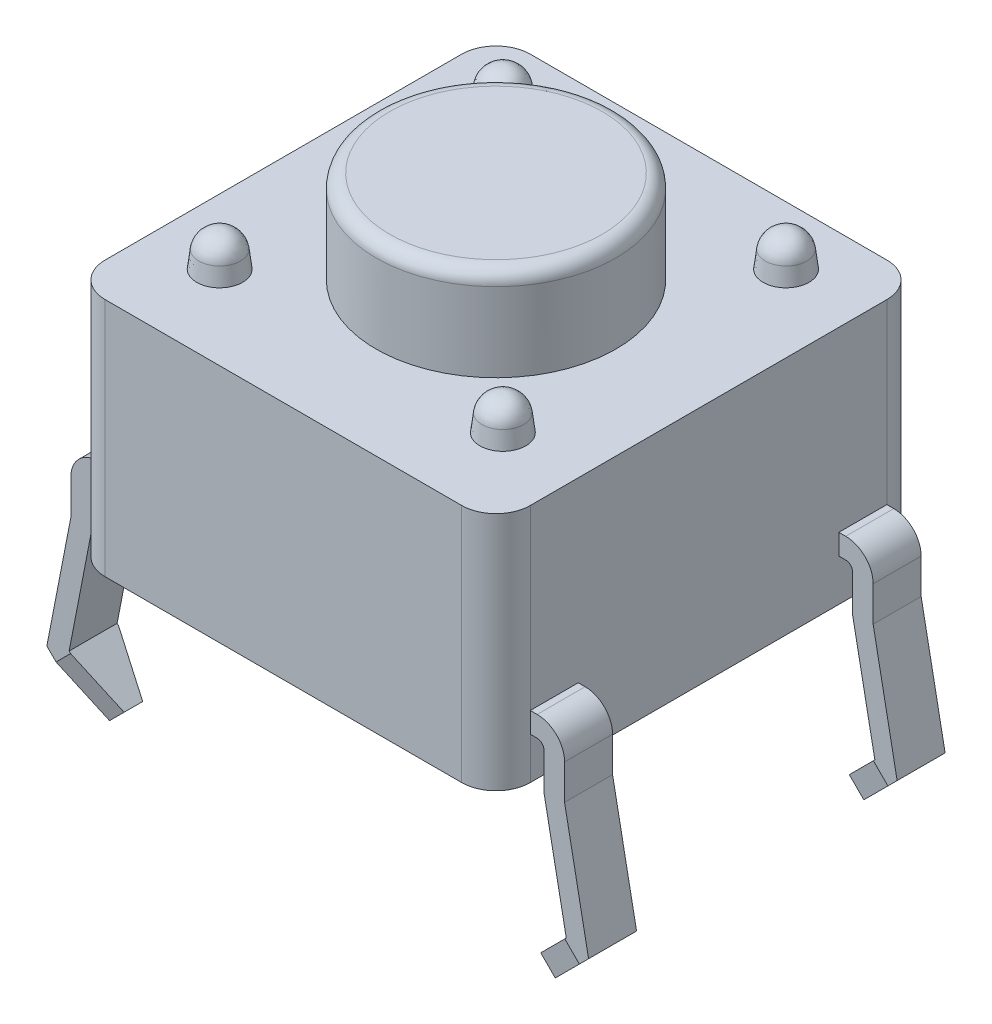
ISO-10303-21;
HEADER;
FILE_DESCRIPTION(('STEP AP214'),'2;1');
FILE_NAME('part.step','',(''),(''),'','','');
FILE_SCHEMA(('AUTOMOTIVE_DESIGN { 1 0 10303 214 1 1 1 1 }'));
ENDSEC;
DATA;
#1=APPLICATION_CONTEXT('core data for automotive mechanical design processes');
#2=APPLICATION_PROTOCOL_DEFINITION('international standard','automotive_design',2000,#1);
#3=PRODUCT_CONTEXT('',#1,'mechanical');
#4=PRODUCT('Part','Part','',(#3));
#5=PRODUCT_RELATED_PRODUCT_CATEGORY('part','',(#4));
#6=PRODUCT_DEFINITION_FORMATION('','',#4);
#7=PRODUCT_DEFINITION_CONTEXT('part definition',#1,'design');
#8=PRODUCT_DEFINITION('design','',#6,#7);
#9=PRODUCT_DEFINITION_SHAPE('','',#8);
#10=(LENGTH_UNIT() NAMED_UNIT(*) SI_UNIT(.MILLI.,.METRE.));
#11=(NAMED_UNIT(*) PLANE_ANGLE_UNIT() SI_UNIT($,.RADIAN.));
#12=(NAMED_UNIT(*) SI_UNIT($,.STERADIAN.) SOLID_ANGLE_UNIT());
#13=UNCERTAINTY_MEASURE_WITH_UNIT(LENGTH_MEASURE(1.E-05),#10,'distance_accuracy_value','');
#14=(GEOMETRIC_REPRESENTATION_CONTEXT(3) GLOBAL_UNCERTAINTY_ASSIGNED_CONTEXT((#13)) GLOBAL_UNIT_ASSIGNED_CONTEXT((#10,
#11,#12)) REPRESENTATION_CONTEXT('',''));
#15=CARTESIAN_POINT('',(0.,0.,0.));
#16=DIRECTION('',(0.,0.,1.));
#17=DIRECTION('',(1.,0.,0.));
#18=AXIS2_PLACEMENT_3D('',#15,#16,#17);
#19=CARTESIAN_POINT('',(26.6965630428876,-4.18036195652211,0.237309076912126));
#20=DIRECTION('',(0.,0.,-1.));
#21=DIRECTION('',(-1.,0.,0.));
#22=AXIS2_PLACEMENT_3D('',#19,#20,#21);
#23=PLANE('',#22);
#24=DIRECTION('',(-1.,0.,0.));
#25=VECTOR('',#24,1.);
#26=CARTESIAN_POINT('',(26.6965630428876,-3.78036195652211,0.237309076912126));
#27=LINE('',#26,#25);
#28=CARTESIAN_POINT('',(26.5965630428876,-3.78036195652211,0.237309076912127));
#29=VERTEX_POINT('',#28);
#30=CARTESIAN_POINT('',(26.6965630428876,-3.78036195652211,0.237309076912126));
#31=VERTEX_POINT('',#30);
#32=EDGE_CURVE('E1084',#29,#31,#27,.F.);
#33=ORIENTED_EDGE('',*,*,#32,.T.);
#34=CARTESIAN_POINT('',(26.6965630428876,-4.18036195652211,0.237309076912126));
#35=DIRECTION('',(0.,0.,1.));
#36=DIRECTION('',(1.,0.,0.));
#37=AXIS2_PLACEMENT_3D('',#34,#35,#36);
#38=CIRCLE('',#37,0.400000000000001);
#39=CARTESIAN_POINT('',(27.0965630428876,-4.18036195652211,0.237309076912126));
#40=VERTEX_POINT('',#39);
#41=EDGE_CURVE('E1082',#31,#40,#38,.F.);
#42=ORIENTED_EDGE('',*,*,#41,.T.);
#43=DIRECTION('',(0.,1.,0.));
#44=VECTOR('',#43,1.);
#45=CARTESIAN_POINT('',(27.0965630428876,-4.18036195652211,0.237309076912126));
#46=LINE('',#45,#44);
#47=CARTESIAN_POINT('',(27.0965630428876,-4.69124998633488,0.237309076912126));
#48=VERTEX_POINT('',#47);
#49=EDGE_CURVE('E1348',#48,#40,#46,.T.);
#50=ORIENTED_EDGE('',*,*,#49,.F.);
#51=DIRECTION('',(-0.190869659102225,0.981615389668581,0.));
#52=VECTOR('',#51,1.);
#53=CARTESIAN_POINT('',(27.0965630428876,-4.69124998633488,0.237309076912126));
#54=LINE('',#53,#52);
#55=CARTESIAN_POINT('',(27.4465630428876,-6.49124998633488,0.237309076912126));
#56=VERTEX_POINT('',#55);
#57=EDGE_CURVE('E1346',#56,#48,#54,.T.);
#58=ORIENTED_EDGE('',*,*,#57,.F.);
#59=DIRECTION('',(-0.707106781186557,-0.707106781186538,0.));
#60=VECTOR('',#59,1.);
#61=CARTESIAN_POINT('',(27.4465630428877,-6.49124998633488,0.237309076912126));
#62=LINE('',#61,#60);
#63=CARTESIAN_POINT('',(27.3122484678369,-6.62556456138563,0.237309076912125));
#64=VERTEX_POINT('',#63);
#65=EDGE_CURVE('E1103',#56,#64,#62,.T.);
#66=ORIENTED_EDGE('',*,*,#65,.T.);
#67=DIRECTION('',(-0.707106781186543,0.707106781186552,0.));
#68=VECTOR('',#67,1.);
#69=CARTESIAN_POINT('',(27.3122484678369,-6.62556456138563,0.237309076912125));
#70=LINE('',#69,#68);
#71=CARTESIAN_POINT('',(27.1001164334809,-6.41343252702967,0.237309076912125));
#72=VERTEX_POINT('',#71);
#73=EDGE_CURVE('E1083',#64,#72,#70,.T.);
#74=ORIENTED_EDGE('',*,*,#73,.T.);
#75=DIRECTION('',(-0.707106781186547,-0.707106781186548,0.));
#76=VECTOR('',#75,1.);
#77=CARTESIAN_POINT('',(27.1216299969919,-6.39191896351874,0.237309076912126));
#78=LINE('',#77,#76);
#79=CARTESIAN_POINT('',(27.1216299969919,-6.39191896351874,0.237309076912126));
#80=VERTEX_POINT('',#79);
#81=EDGE_CURVE('E1120',#80,#72,#78,.T.);
#82=ORIENTED_EDGE('',*,*,#81,.F.);
#83=DIRECTION('',(0.190869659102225,-0.981615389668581,0.));
#84=VECTOR('',#83,1.);
#85=CARTESIAN_POINT('',(26.7965630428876,-4.72014605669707,0.237309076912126));
#86=LINE('',#85,#84);
#87=CARTESIAN_POINT('',(26.7965630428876,-4.72014605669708,0.237309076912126));
#88=VERTEX_POINT('',#87);
#89=EDGE_CURVE('E1113',#88,#80,#86,.T.);
#90=ORIENTED_EDGE('',*,*,#89,.F.);
#91=DIRECTION('',(0.,1.,0.));
#92=VECTOR('',#91,1.);
#93=CARTESIAN_POINT('',(26.7965630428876,-4.18036195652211,0.237309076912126));
#94=LINE('',#93,#92);
#95=CARTESIAN_POINT('',(26.7965630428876,-4.18036195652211,0.237309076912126));
#96=VERTEX_POINT('',#95);
#97=EDGE_CURVE('E1357',#96,#88,#94,.F.);
#98=ORIENTED_EDGE('',*,*,#97,.F.);
#99=CARTESIAN_POINT('',(26.6965630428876,-4.18036195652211,0.237309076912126));
#100=DIRECTION('',(0.,0.,1.));
#101=DIRECTION('',(1.,0.,0.));
#102=AXIS2_PLACEMENT_3D('',#99,#100,#101);
#103=CIRCLE('',#102,0.0999999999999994);
#104=CARTESIAN_POINT('',(26.6965630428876,-4.08036195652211,0.237309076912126));
#105=VERTEX_POINT('',#104);
#106=EDGE_CURVE('E22',#96,#105,#103,.T.);
#107=ORIENTED_EDGE('',*,*,#106,.T.);
#108=DIRECTION('',(-1.,0.,0.));
#109=VECTOR('',#108,1.);
#110=CARTESIAN_POINT('',(26.6965630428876,-4.08036195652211,0.237309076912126));
#111=LINE('',#110,#109);
#112=CARTESIAN_POINT('',(26.5965630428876,-4.08036195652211,0.237309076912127));
#113=VERTEX_POINT('',#112);
#114=EDGE_CURVE('E1091',#105,#113,#111,.T.);
#115=ORIENTED_EDGE('',*,*,#114,.T.);
#116=DIRECTION('',(0.,1.,0.));
#117=VECTOR('',#116,1.);
#118=CARTESIAN_POINT('',(26.5965630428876,-4.18036195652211,0.237309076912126));
#119=LINE('',#118,#117);
#120=EDGE_CURVE('E1088',#113,#29,#119,.T.);
#121=ORIENTED_EDGE('',*,*,#120,.T.);
#122=EDGE_LOOP('',(#33,#42,#50,#58,#66,#74,#82,#90,#98,#107,#115,#121));
#123=FACE_BOUND('',#122,.T.);
#124=ADVANCED_FACE('F17',(#123),#23,.T.);
#125=CARTESIAN_POINT('',(26.5344310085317,-6.97911795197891,0.451668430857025));
#126=DIRECTION('',(0.183012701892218,0.183012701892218,0.965925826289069));
#127=DIRECTION('',(0.982520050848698,0.,-0.186156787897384));
#128=AXIS2_PLACEMENT_3D('',#125,#126,#127);
#129=PLANE('',#128);
#130=DIRECTION('',(0.68301270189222,0.683012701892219,-0.258819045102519));
#131=VECTOR('',#130,1.);
#132=CARTESIAN_POINT('',(26.7465630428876,-7.19124998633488,0.451668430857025));
#133=LINE('',#132,#131);
#134=CARTESIAN_POINT('',(26.7465630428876,-7.19124998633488,0.451668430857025));
#135=VERTEX_POINT('',#134);
#136=EDGE_CURVE('E1110',#135,#64,#133,.T.);
#137=ORIENTED_EDGE('',*,*,#136,.F.);
#138=DIRECTION('',(0.707106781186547,-0.707106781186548,0.));
#139=VECTOR('',#138,1.);
#140=CARTESIAN_POINT('',(26.5344310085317,-6.97911795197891,0.451668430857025));
#141=LINE('',#140,#139);
#142=CARTESIAN_POINT('',(26.5344310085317,-6.97911795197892,0.451668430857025));
#143=VERTEX_POINT('',#142);
#144=EDGE_CURVE('E1086',#143,#135,#141,.T.);
#145=ORIENTED_EDGE('',*,*,#144,.F.);
#146=DIRECTION('',(-0.68301270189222,-0.683012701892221,0.258819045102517));
#147=VECTOR('',#146,1.);
#148=CARTESIAN_POINT('',(27.1001164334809,-6.41343252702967,0.237309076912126));
#149=LINE('',#148,#147);
#150=EDGE_CURVE('E1123',#72,#143,#149,.T.);
#151=ORIENTED_EDGE('',*,*,#150,.F.);
#152=ORIENTED_EDGE('',*,*,#73,.F.);
#153=EDGE_LOOP('',(#137,#145,#151,#152));
#154=FACE_BOUND('',#153,.T.);
#155=ADVANCED_FACE('F802',(#154),#129,.F.);
#156=CARTESIAN_POINT('',(26.5344310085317,-6.97911795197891,0.237309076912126));
#157=DIRECTION('',(-0.707106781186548,-0.707106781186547,0.));
#158=DIRECTION('',(0.707106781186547,-0.707106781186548,0.));
#159=AXIS2_PLACEMENT_3D('',#156,#157,#158);
#160=PLANE('',#159);
#161=DIRECTION('',(0.,0.,1.));
#162=VECTOR('',#161,1.);
#163=CARTESIAN_POINT('',(26.5344310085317,-6.97911795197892,0.237309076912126));
#164=LINE('',#163,#162);
#165=CARTESIAN_POINT('',(26.5344310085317,-6.97911795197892,0.722949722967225));
#166=VERTEX_POINT('',#165);
#167=EDGE_CURVE('E1117',#143,#166,#164,.T.);
#168=ORIENTED_EDGE('',*,*,#167,.F.);
#169=ORIENTED_EDGE('',*,*,#144,.T.);
#170=DIRECTION('',(0.,0.,1.));
#171=VECTOR('',#170,1.);
#172=CARTESIAN_POINT('',(26.7465630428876,-7.19124998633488,0.237309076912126));
#173=LINE('',#172,#171);
#174=CARTESIAN_POINT('',(26.7465630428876,-7.19124998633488,0.722949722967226));
#175=VERTEX_POINT('',#174);
#176=EDGE_CURVE('E1193',#175,#135,#173,.F.);
#177=ORIENTED_EDGE('',*,*,#176,.F.);
#178=DIRECTION('',(0.707106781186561,-0.707106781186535,0.));
#179=VECTOR('',#178,1.);
#180=CARTESIAN_POINT('',(26.5344310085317,-6.97911795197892,0.722949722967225));
#181=LINE('',#180,#179);
#182=EDGE_CURVE('E1207',#166,#175,#181,.T.);
#183=ORIENTED_EDGE('',*,*,#182,.F.);
#184=EDGE_LOOP('',(#168,#169,#177,#183));
#185=FACE_BOUND('',#184,.T.);
#186=ADVANCED_FACE('F798',(#185),#160,.T.);
#187=CARTESIAN_POINT('',(23.4965630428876,0.158750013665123,2.83730907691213));
#188=DIRECTION('',(0.,1.,0.));
#189=DIRECTION('',(0.,0.,1.));
#190=AXIS2_PLACEMENT_3D('',#187,#188,#189);
#191=PLANE('',#190);
#192=CARTESIAN_POINT('',(21.9465630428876,0.158750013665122,2.83730907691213));
#193=CARTESIAN_POINT('',(21.9465789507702,0.158750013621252,2.81356116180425));
#194=CARTESIAN_POINT('',(21.9471402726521,0.158750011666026,2.78981365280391));
#195=CARTESIAN_POINT('',(21.9493507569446,0.158750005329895,2.74236995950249));
#196=CARTESIAN_POINT('',(21.9509998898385,0.158750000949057,2.71867377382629));
#197=CARTESIAN_POINT('',(21.9553829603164,0.158749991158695,2.6713824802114));
#198=CARTESIAN_POINT('',(21.9581168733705,0.158749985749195,2.6477873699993));
#199=CARTESIAN_POINT('',(21.9646635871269,0.158749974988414,2.60074773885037));
#200=CARTESIAN_POINT('',(21.9684763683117,0.158749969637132,2.57730321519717));
#201=CARTESIAN_POINT('',(21.9771728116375,0.158749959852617,2.53061395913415));
#202=CARTESIAN_POINT('',(21.9820564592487,0.158749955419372,2.50736922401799));
#203=CARTESIAN_POINT('',(21.9928843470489,0.158749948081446,2.46112832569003));
#204=CARTESIAN_POINT('',(21.9988285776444,0.158749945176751,2.43813216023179));
#205=CARTESIAN_POINT('',(22.0117651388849,0.158749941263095,2.39243666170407));
#206=CARTESIAN_POINT('',(22.0187574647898,0.158749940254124,2.36973732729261));
#207=CARTESIAN_POINT('',(22.0337755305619,0.15874994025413,2.32468312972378));
#208=CARTESIAN_POINT('',(22.0418012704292,0.158749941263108,2.30232826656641));
#209=CARTESIAN_POINT('',(22.0588693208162,0.158749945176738,2.25800993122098));
#210=CARTESIAN_POINT('',(22.0679116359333,0.1587499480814,2.23604646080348));
#211=CARTESIAN_POINT('',(22.0869938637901,0.158749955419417,2.19255700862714));
#212=CARTESIAN_POINT('',(22.0970337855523,0.158749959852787,2.17103103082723));
#213=CARTESIAN_POINT('',(22.1180901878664,0.158749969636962,2.12846176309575));
#214=CARTESIAN_POINT('',(22.1291066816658,0.15874997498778,2.10741847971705));
#215=CARTESIAN_POINT('',(22.1520930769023,0.158749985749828,2.06585873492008));
#216=CARTESIAN_POINT('',(22.1640629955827,0.15874999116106,2.04534228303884));
#217=CARTESIAN_POINT('',(22.1889313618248,0.158750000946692,2.00487944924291));
#218=CARTESIAN_POINT('',(22.2018298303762,0.15875000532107,1.98493308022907));
#219=CARTESIAN_POINT('',(22.2285274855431,0.158750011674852,1.94565167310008));
#220=CARTESIAN_POINT('',(22.242326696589,0.158750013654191,1.92631665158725));
#221=CARTESIAN_POINT('',(22.2707838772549,0.158750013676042,1.88832221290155));
#222=CARTESIAN_POINT('',(22.2854408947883,0.158750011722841,1.8696620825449));
#223=CARTESIAN_POINT('',(22.316626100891,0.158750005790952,1.83178892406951));
#224=CARTESIAN_POINT('',(22.3332137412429,0.158750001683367,1.81262480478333));
#225=CARTESIAN_POINT('',(22.3683972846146,0.158749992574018,1.77393926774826));
#226=CARTESIAN_POINT('',(22.3870537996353,0.158749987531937,1.75447298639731));
#227=CARTESIAN_POINT('',(22.4265078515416,0.15874997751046,1.71540356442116));
#228=CARTESIAN_POINT('',(22.4473666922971,0.158749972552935,1.69586215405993));
#229=CARTESIAN_POINT('',(22.4798930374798,0.158749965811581,1.66703860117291));
#230=CARTESIAN_POINT('',(22.4911801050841,0.158749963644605,1.65732368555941));
#231=CARTESIAN_POINT('',(22.5143401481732,0.158749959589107,1.63796420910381));
#232=CARTESIAN_POINT('',(22.5262207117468,0.158749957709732,1.62832870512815));
#233=CARTESIAN_POINT('',(22.5505795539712,0.158749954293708,1.60916433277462));
#234=CARTESIAN_POINT('',(22.5630653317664,0.158749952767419,1.59964500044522));
#235=CARTESIAN_POINT('',(22.5886455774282,0.158749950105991,1.58075047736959));
#236=CARTESIAN_POINT('',(22.6017474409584,0.158749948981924,1.57138529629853));
#237=CARTESIAN_POINT('',(22.6285691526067,0.158749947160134,1.5528384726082));
#238=CARTESIAN_POINT('',(22.6422962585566,0.15874994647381,1.54366732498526));
#239=CARTESIAN_POINT('',(22.6703760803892,0.158749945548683,1.52554964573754));
#240=CARTESIAN_POINT('',(22.6847358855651,0.158749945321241,1.51661409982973));
#241=CARTESIAN_POINT('',(22.7140868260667,0.158749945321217,1.499010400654));
#242=CARTESIAN_POINT('',(22.7290848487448,0.158749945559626,1.49035372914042));
#243=CARTESIAN_POINT('',(22.7597158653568,0.158749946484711,1.473352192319));
#244=CARTESIAN_POINT('',(22.7753555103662,0.15874994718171,1.46501930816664));
#245=CARTESIAN_POINT('',(22.8072711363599,0.158749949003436,1.44871133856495));
#246=CARTESIAN_POINT('',(22.8235534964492,0.158749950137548,1.44074873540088));
#247=CARTESIAN_POINT('',(22.8567534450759,0.158749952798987,1.42522882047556));
#248=CARTESIAN_POINT('',(22.8736771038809,0.158749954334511,1.41768449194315));
#249=CARTESIAN_POINT('',(22.9081558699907,0.158749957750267,1.40305002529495));
#250=CARTESIAN_POINT('',(22.9257167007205,0.158749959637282,1.39597336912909));
#251=CARTESIAN_POINT('',(22.9614631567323,0.158749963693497,1.3823244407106));
#252=CARTESIAN_POINT('',(22.9796541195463,0.158749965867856,1.37576614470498));
#253=CARTESIAN_POINT('',(23.0166511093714,0.158749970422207,1.36320529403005));
#254=CARTESIAN_POINT('',(23.0354620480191,0.158749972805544,1.35721720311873));
#255=CARTESIAN_POINT('',(23.0736859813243,0.158749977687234,1.34584913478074));
#256=CARTESIAN_POINT('',(23.0931034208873,0.158749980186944,1.34048409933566));
#257=CARTESIAN_POINT('',(23.1325238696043,0.15874998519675,1.33041535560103));
#258=CARTESIAN_POINT('',(23.1525308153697,0.158749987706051,1.32572705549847));
#259=CARTESIAN_POINT('',(23.1931101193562,0.158749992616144,1.31706565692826));
#260=CARTESIAN_POINT('',(23.2136858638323,0.158749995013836,1.31310841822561));
#261=CARTESIAN_POINT('',(23.2553787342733,0.158749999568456,1.30596342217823));
#262=CARTESIAN_POINT('',(23.2764986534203,0.158750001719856,1.30279195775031));
#263=CARTESIAN_POINT('',(23.3192518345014,0.158750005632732,1.29727312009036));
#264=CARTESIAN_POINT('',(23.3408872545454,0.15875000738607,1.29494245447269));
#265=CARTESIAN_POINT('',(23.3846390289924,0.158750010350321,1.29115927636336));
#266=CARTESIAN_POINT('',(23.4067568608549,0.15875001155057,1.28972385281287));
#267=CARTESIAN_POINT('',(23.4514372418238,0.15875001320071,1.28778676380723));
#268=CARTESIAN_POINT('',(23.4740005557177,0.15875001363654,1.28730257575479));
#269=CARTESIAN_POINT('',(23.514615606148,0.158750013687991,1.28731427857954));
#270=CARTESIAN_POINT('',(23.5326676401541,0.158750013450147,1.28763361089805));
#271=CARTESIAN_POINT('',(23.5687496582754,0.158750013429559,1.28889556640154));
#272=CARTESIAN_POINT('',(23.5867796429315,0.158750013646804,1.28983817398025));
#273=CARTESIAN_POINT('',(23.6227959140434,0.15875001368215,1.29234674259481));
#274=CARTESIAN_POINT('',(23.6407822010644,0.158750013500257,1.29391269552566));
#275=CARTESIAN_POINT('',(23.6766898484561,0.158750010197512,1.29766573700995));
#276=CARTESIAN_POINT('',(23.6946112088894,0.158750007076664,1.29985282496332));
#277=CARTESIAN_POINT('',(23.7303677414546,0.158749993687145,1.30484562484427));
#278=CARTESIAN_POINT('',(23.7482029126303,0.158749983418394,1.3076513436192));
#279=CARTESIAN_POINT('',(23.7837659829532,0.158749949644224,1.31387802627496));
#280=CARTESIAN_POINT('',(23.8014938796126,0.158749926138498,1.31729900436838));
#281=CARTESIAN_POINT('',(23.8368212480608,0.158749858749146,1.32475228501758));
#282=CARTESIAN_POINT('',(23.8544207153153,0.158749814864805,1.32878460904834));
#283=CARTESIAN_POINT('',(23.8894709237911,0.158749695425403,1.33745541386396));
#284=CARTESIAN_POINT('',(23.9069216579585,0.158749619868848,1.34209392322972));
#285=CARTESIAN_POINT('',(23.9342094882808,0.158749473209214,1.34985621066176));
#286=CARTESIAN_POINT('',(23.9441046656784,0.158749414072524,1.35277729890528));
#287=CARTESIAN_POINT('',(23.9638364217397,0.158749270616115,1.3588119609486));
#288=CARTESIAN_POINT('',(23.9736729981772,0.158749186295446,1.36192554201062));
#289=CARTESIAN_POINT('',(24.0080997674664,0.158748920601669,1.37321729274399));
#290=CARTESIAN_POINT('',(24.0325155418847,0.158748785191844,1.38193675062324));
#291=CARTESIAN_POINT('',(24.0808275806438,0.158748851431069,1.40067690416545));
#292=CARTESIAN_POINT('',(24.1047240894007,0.158749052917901,1.41069697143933));
#293=CARTESIAN_POINT('',(24.142510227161,0.1587494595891,1.42770477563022));
#294=CARTESIAN_POINT('',(24.1565769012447,0.158749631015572,1.43430099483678));
#295=CARTESIAN_POINT('',(24.1844556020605,0.158749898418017,1.44799523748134));
#296=CARTESIAN_POINT('',(24.1982677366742,0.158749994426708,1.45509304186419));
#297=CARTESIAN_POINT('',(24.2175487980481,0.158750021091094,1.46519720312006));
#298=CARTESIAN_POINT('',(24.223067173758,0.158750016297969,1.4681117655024));
#299=CARTESIAN_POINT('',(24.2413948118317,0.158750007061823,1.47792369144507));
#300=CARTESIAN_POINT('',(24.2541312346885,0.158750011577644,1.48495839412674));
#301=CARTESIAN_POINT('',(24.2866177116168,0.15875000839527,1.50349959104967));
#302=CARTESIAN_POINT('',(24.3062197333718,0.158749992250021,1.51526577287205));
#303=CARTESIAN_POINT('',(24.35191913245,0.158749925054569,1.54408219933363));
#304=CARTESIAN_POINT('',(24.3777875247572,0.158749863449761,1.56149851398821));
#305=CARTESIAN_POINT('',(24.4137545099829,0.158749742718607,1.58732686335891));
#306=CARTESIAN_POINT('',(24.4243088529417,0.158749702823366,1.5951114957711));
#307=CARTESIAN_POINT('',(24.4452145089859,0.158749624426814,1.61094964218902));
#308=CARTESIAN_POINT('',(24.4555658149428,0.158749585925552,1.61900316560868));
#309=CARTESIAN_POINT('',(24.48972047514,0.158749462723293,1.64628630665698));
#310=CARTESIAN_POINT('',(24.5130601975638,0.158749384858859,1.66610191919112));
#311=CARTESIAN_POINT('',(24.5585117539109,0.158749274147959,1.70709261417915));
#312=CARTESIAN_POINT('',(24.5806235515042,0.158749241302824,1.7282677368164));
#313=CARTESIAN_POINT('',(24.6235417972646,0.158749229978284,1.77190241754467));
#314=CARTESIAN_POINT('',(24.6443482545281,0.158749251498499,1.79436196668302));
#315=CARTESIAN_POINT('',(24.684579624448,0.158749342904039,1.84048431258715));
#316=CARTESIAN_POINT('',(24.7040045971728,0.158749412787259,1.86414705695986));
#317=CARTESIAN_POINT('',(24.741404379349,0.158749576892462,1.91258850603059));
#318=CARTESIAN_POINT('',(24.759379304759,0.158749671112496,1.93736712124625));
#319=CARTESIAN_POINT('',(24.7938093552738,0.158749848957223,1.98795699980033));
#320=CARTESIAN_POINT('',(24.8102646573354,0.158749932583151,2.01376814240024));
#321=CARTESIAN_POINT('',(24.8327943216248,0.158749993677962,2.05152421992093));
#322=CARTESIAN_POINT('',(24.839498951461,0.158750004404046,2.06309751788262));
#323=CARTESIAN_POINT('',(24.853495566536,0.158750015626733,2.08797574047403));
#324=CARTESIAN_POINT('',(24.8607454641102,0.158750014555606,2.10130443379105));
#325=CARTESIAN_POINT('',(24.8756909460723,0.158750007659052,2.12975710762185));
#326=CARTESIAN_POINT('',(24.8833376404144,0.15875000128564,2.14490677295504));
#327=CARTESIAN_POINT('',(24.898918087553,0.158749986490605,2.17706358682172));
#328=CARTESIAN_POINT('',(24.9067965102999,0.158749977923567,2.19409756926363));
#329=CARTESIAN_POINT('',(24.92265891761,0.15874996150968,2.23008262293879));
#330=CARTESIAN_POINT('',(24.9305807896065,0.158749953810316,2.24906109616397));
#331=CARTESIAN_POINT('',(24.9463267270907,0.158749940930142,2.28898821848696));
#332=CARTESIAN_POINT('',(24.9540817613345,0.158749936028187,2.30996411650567));
#333=CARTESIAN_POINT('',(24.9692678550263,0.158749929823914,2.35392904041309));
#334=CARTESIAN_POINT('',(24.9766227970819,0.158749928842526,2.37694438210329));
#335=CARTESIAN_POINT('',(24.9907598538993,0.158749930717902,2.42501699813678));
#336=CARTESIAN_POINT('',(24.9974586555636,0.158749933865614,2.45009880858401));
#337=CARTESIAN_POINT('',(25.0100121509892,0.158749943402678,2.50231364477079));
#338=CARTESIAN_POINT('',(25.015776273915,0.158749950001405,2.52946844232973));
#339=CARTESIAN_POINT('',(25.026167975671,0.158749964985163,2.58581761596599));
#340=CARTESIAN_POINT('',(25.0306977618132,0.15874997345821,2.61503017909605));
#341=CARTESIAN_POINT('',(25.0363210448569,0.158749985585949,2.65967246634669));
#342=CARTESIAN_POINT('',(25.0380228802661,0.158749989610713,2.67502808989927));
#343=CARTESIAN_POINT('',(25.0410104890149,0.158749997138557,2.70623131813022));
#344=CARTESIAN_POINT('',(25.0422827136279,0.158750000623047,2.72208023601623));
#345=CARTESIAN_POINT('',(25.0443688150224,0.158750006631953,2.75425823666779));
#346=CARTESIAN_POINT('',(25.0451687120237,0.158750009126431,2.77058822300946));
#347=CARTESIAN_POINT('',(25.0462672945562,0.158750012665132,2.80371475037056));
#348=CARTESIAN_POINT('',(25.0465515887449,0.158750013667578,2.82051176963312));
#349=CARTESIAN_POINT('',(25.0465630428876,0.158750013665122,2.83730907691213));
#350=B_SPLINE_CURVE_WITH_KNOTS('',3,(#192,#193,#194,#195,#196,#197,#198,#199,#200,#201,#202,
#203,#204,#205,#206,#207,#208,#209,#210,#211,#212,#213,#214,#215,#216,#217,#218,#219,#220,#221,
#222,#223,#224,#225,#226,#227,#228,#229,#230,#231,#232,#233,#234,#235,#236,#237,#238,#239,#240,
#241,#242,#243,#244,#245,#246,#247,#248,#249,#250,#251,#252,#253,#254,#255,#256,#257,#258,#259,
#260,#261,#262,#263,#264,#265,#266,#267,#268,#269,#270,#271,#272,#273,#274,#275,#276,#277,#278,
#279,#280,#281,#282,#283,#284,#285,#286,#287,#288,#289,#290,#291,#292,#293,#294,#295,#296,#297,
#298,#299,#300,#301,#302,#303,#304,#305,#306,#307,#308,#309,#310,#311,#312,#313,#314,#315,#316,
#317,#318,#319,#320,#321,#322,#323,#324,#325,#326,#327,#328,#329,#330,#331,#332,#333,#334,#335,
#336,#337,#338,#339,#340,#341,#342,#343,#344,#345,#346,#347,#348,#349),.UNSPECIFIED.,.F.,.F.,(4,
2,2,2,2,2,2,2,2,2,2,2,2,2,2,2,2,2,2,2,2,2,2,2,2,2,2,2,2,2,2,2,2,2,2,2,2,2,2,2,2,2,2,2,2,2,2,2,2,
2,2,2,2,2,2,2,2,2,2,2,2,2,2,2,2,2,2,2,2,2,2,2,2,2,2,2,2,2,4),(0.,0.071237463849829,
0.1424729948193,0.213706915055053,0.28493954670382,0.356171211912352,0.427402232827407,
0.498632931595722,0.569863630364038,0.641094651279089,0.712326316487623,0.78355894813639,
0.854792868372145,0.926028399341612,0.997265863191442,1.06842570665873,1.14443234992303,
1.22528550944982,1.31098482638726,1.35565630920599,1.4015395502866,1.44863450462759,
1.49694112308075,1.54645935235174,1.59718913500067,1.6491304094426,1.70228310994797,
1.75664716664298,1.81222250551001,1.86900904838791,1.92700671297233,1.98621541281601,
2.04663505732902,2.10826555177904,2.17110679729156,2.23515869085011,2.30042112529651,
2.36689398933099,2.43457716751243,2.48873143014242,2.54288433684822,2.59703653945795,
2.65118868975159,2.70534143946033,2.75949544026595,2.8136513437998,2.8678098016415,
2.89875992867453,2.92971122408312,3.00744860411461,3.08514856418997,3.13174923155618,
3.17832967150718,3.19705207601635,3.24069620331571,3.30926240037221,3.40275229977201,
3.44209298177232,3.48143504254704,3.57322588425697,3.6650194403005,3.75681235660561,
3.84860127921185,3.94038285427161,4.0321537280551,4.07227584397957,4.11778773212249,
4.16868916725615,4.22498004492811,4.28666038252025,4.35373031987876,4.42619011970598,
4.50404016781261,4.5872809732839,4.67591316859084,4.7222564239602,4.76994828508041,
4.81898889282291,4.86937839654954),.UNSPECIFIED.);
#351=CARTESIAN_POINT('',(21.9465630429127,0.158750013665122,2.83730911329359));
#352=VERTEX_POINT('',#351);
#353=CARTESIAN_POINT('',(25.0465630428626,0.158750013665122,2.83730911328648));
#354=VERTEX_POINT('',#353);
#355=EDGE_CURVE('E1206',#352,#354,#350,.T.);
#356=ORIENTED_EDGE('',*,*,#355,.F.);
#357=CARTESIAN_POINT('',(25.0465630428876,0.158750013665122,2.83730907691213));
#358=CARTESIAN_POINT('',(25.046547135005,0.158750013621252,2.86105699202));
#359=CARTESIAN_POINT('',(25.0459858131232,0.158750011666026,2.88480450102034));
#360=CARTESIAN_POINT('',(25.0437753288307,0.158750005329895,2.93224819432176));
#361=CARTESIAN_POINT('',(25.0421261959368,0.158750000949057,2.95594437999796));
#362=CARTESIAN_POINT('',(25.0377431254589,0.158749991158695,3.00323567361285));
#363=CARTESIAN_POINT('',(25.0350092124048,0.158749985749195,3.02683078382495));
#364=CARTESIAN_POINT('',(25.0284624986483,0.158749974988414,3.07387041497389));
#365=CARTESIAN_POINT('',(25.0246497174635,0.158749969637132,3.09731493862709));
#366=CARTESIAN_POINT('',(25.0159532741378,0.158749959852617,3.14400419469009));
#367=CARTESIAN_POINT('',(25.0110696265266,0.158749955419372,3.16724892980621));
#368=CARTESIAN_POINT('',(25.0002417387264,0.158749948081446,3.21348982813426));
#369=CARTESIAN_POINT('',(24.9942975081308,0.158749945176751,3.23648599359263));
#370=CARTESIAN_POINT('',(24.9813609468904,0.158749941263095,3.28218149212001));
#371=CARTESIAN_POINT('',(24.9743686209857,0.158749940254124,3.30488082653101));
#372=CARTESIAN_POINT('',(24.9593505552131,0.15874994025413,3.34993502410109));
#373=CARTESIAN_POINT('',(24.9513248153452,0.158749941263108,3.37228988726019));
#374=CARTESIAN_POINT('',(24.9342567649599,0.158749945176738,3.41660822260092));
#375=CARTESIAN_POINT('',(24.9252144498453,0.1587499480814,3.43857169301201));
#376=CARTESIAN_POINT('',(24.9061322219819,0.158749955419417,3.48206114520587));
#377=CARTESIAN_POINT('',(24.8960923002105,0.158749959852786,3.50358712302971));
#378=CARTESIAN_POINT('',(24.8750358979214,0.158749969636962,3.5461563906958));
#379=CARTESIAN_POINT('',(24.8640194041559,0.158749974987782,3.56719967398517));
#380=CARTESIAN_POINT('',(24.8410330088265,0.158749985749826,3.6087594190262));
#381=CARTESIAN_POINT('',(24.8290630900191,0.158749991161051,3.62927587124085));
#382=CARTESIAN_POINT('',(24.804194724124,0.158750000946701,3.6697387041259));
#383=CARTESIAN_POINT('',(24.7912962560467,0.158750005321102,3.68968507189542));
#384=CARTESIAN_POINT('',(24.7645985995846,0.158750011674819,3.72896648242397));
#385=CARTESIAN_POINT('',(24.7507993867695,0.15875001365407,3.74830150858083));
#386=CARTESIAN_POINT('',(24.7223858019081,0.158750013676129,3.78623773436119));
#387=CARTESIAN_POINT('',(24.7077750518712,0.158750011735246,3.80484164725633));
#388=CARTESIAN_POINT('',(24.676680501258,0.158750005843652,3.84261551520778));
#389=CARTESIAN_POINT('',(24.6601369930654,0.158750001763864,3.86173636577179));
#390=CARTESIAN_POINT('',(24.6250387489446,0.158749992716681,3.90034822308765));
#391=CARTESIAN_POINT('',(24.6064230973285,0.158749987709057,3.91978384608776));
#392=CARTESIAN_POINT('',(24.5670465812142,0.158749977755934,3.95880431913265));
#393=CARTESIAN_POINT('',(24.5462240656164,0.158749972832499,3.97832713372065));
#394=CARTESIAN_POINT('',(24.5137510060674,0.158749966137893,4.00712855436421));
#395=CARTESIAN_POINT('',(24.5024799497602,0.158749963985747,4.01683847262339));
#396=CARTESIAN_POINT('',(24.4793503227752,0.158749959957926,4.03619070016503));
#397=CARTESIAN_POINT('',(24.4674841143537,0.158749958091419,4.04582390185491));
#398=CARTESIAN_POINT('',(24.4431521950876,0.158749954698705,4.06498627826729));
#399=CARTESIAN_POINT('',(24.4306789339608,0.158749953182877,4.07450586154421));
#400=CARTESIAN_POINT('',(24.405121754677,0.158749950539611,4.09340333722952));
#401=CARTESIAN_POINT('',(24.3920303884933,0.15874994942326,4.10277115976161));
#402=CARTESIAN_POINT('',(24.3652275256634,0.158749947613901,4.12132553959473));
#403=CARTESIAN_POINT('',(24.3515087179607,0.158749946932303,4.13050153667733));
#404=CARTESIAN_POINT('',(24.3234431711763,0.15874994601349,4.14863098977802));
#405=CARTESIAN_POINT('',(24.3090892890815,0.158749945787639,4.15757338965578));
#406=CARTESIAN_POINT('',(24.2797477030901,0.158749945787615,4.1751926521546));
#407=CARTESIAN_POINT('',(24.2647530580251,0.158749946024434,4.18385795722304));
#408=CARTESIAN_POINT('',(24.2341261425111,0.158749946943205,4.20087837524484));
#409=CARTESIAN_POINT('',(24.2184871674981,0.158749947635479,4.20922142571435));
#410=CARTESIAN_POINT('',(24.1865700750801,0.158749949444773,4.22555107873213));
#411=CARTESIAN_POINT('',(24.1702855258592,0.158749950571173,4.23352511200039));
#412=CARTESIAN_POINT('',(24.1370782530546,0.158749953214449,4.24906895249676));
#413=CARTESIAN_POINT('',(24.1201494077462,0.158749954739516,4.25662568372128));
#414=CARTESIAN_POINT('',(24.0856571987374,0.158749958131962,4.27128571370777));
#415=CARTESIAN_POINT('',(24.0680880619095,0.158749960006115,4.27837543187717));
#416=CARTESIAN_POINT('',(24.0323218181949,0.158749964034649,4.29205091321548));
#417=CARTESIAN_POINT('',(24.0141193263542,0.15874996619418,4.29862259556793));
#418=CARTESIAN_POINT('',(23.9770960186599,0.15874997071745,4.31121029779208));
#419=CARTESIAN_POINT('',(23.9582702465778,0.158749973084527,4.31721174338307));
#420=CARTESIAN_POINT('',(23.9200133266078,0.158749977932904,4.32860622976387));
#421=CARTESIAN_POINT('',(23.9005776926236,0.158749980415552,4.33398421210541));
#422=CARTESIAN_POINT('',(23.8611175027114,0.15874998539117,4.34407816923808));
#423=CARTESIAN_POINT('',(23.8410889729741,0.158749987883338,4.34877861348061));
#424=CARTESIAN_POINT('',(23.8004631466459,0.158749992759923,4.35746321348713));
#425=CARTESIAN_POINT('',(23.7798624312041,0.158749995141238,4.36143138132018));
#426=CARTESIAN_POINT('',(23.7381162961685,0.158749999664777,4.36859672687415));
#427=CARTESIAN_POINT('',(23.7169680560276,0.158750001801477,4.37177747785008));
#428=CARTESIAN_POINT('',(23.6741549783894,0.158750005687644,4.37731294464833));
#429=CARTESIAN_POINT('',(23.6524879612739,0.15875000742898,4.37965081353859));
#430=CARTESIAN_POINT('',(23.6086698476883,0.158750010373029,4.38344600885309));
#431=CARTESIAN_POINT('',(23.5865172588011,0.158750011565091,4.38488610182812));
#432=CARTESIAN_POINT('',(23.5417643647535,0.158750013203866,4.38682968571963));
#433=CARTESIAN_POINT('',(23.5191632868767,0.158750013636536,4.38731554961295));
#434=CARTESIAN_POINT('',(23.4785104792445,0.158750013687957,4.38730390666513));
#435=CARTESIAN_POINT('',(23.4604584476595,0.158750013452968,4.38698460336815));
#436=CARTESIAN_POINT('',(23.424376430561,0.158750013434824,4.38572269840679));
#437=CARTESIAN_POINT('',(23.4063464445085,0.158750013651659,4.38478011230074));
#438=CARTESIAN_POINT('',(23.3703301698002,0.158750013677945,4.38227157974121));
#439=CARTESIAN_POINT('',(23.352343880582,0.158750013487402,4.3807056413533));
#440=CARTESIAN_POINT('',(23.3164362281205,0.15875001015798,4.3769526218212));
#441=CARTESIAN_POINT('',(23.2985148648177,0.158750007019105,4.3747655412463));
#442=CARTESIAN_POINT('',(23.2627583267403,0.15874999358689,4.36977274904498));
#443=CARTESIAN_POINT('',(23.244923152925,0.158749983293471,4.36696703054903));
#444=CARTESIAN_POINT('',(23.2093600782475,0.158749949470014,4.36074034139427));
#445=CARTESIAN_POINT('',(23.1916321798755,0.158749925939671,4.35731935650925));
#446=CARTESIAN_POINT('',(23.1563048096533,0.158749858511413,4.34986605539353));
#447=CARTESIAN_POINT('',(23.1387053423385,0.158749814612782,4.34583371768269));
#448=CARTESIAN_POINT('',(23.1036551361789,0.158749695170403,4.33716287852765));
#449=CARTESIAN_POINT('',(23.0862044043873,0.158749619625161,4.3325243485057));
#450=CARTESIAN_POINT('',(23.0589165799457,0.158749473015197,4.32476202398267));
#451=CARTESIAN_POINT('',(23.0490214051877,0.158749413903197,4.32184092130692));
#452=CARTESIAN_POINT('',(23.0292896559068,0.158749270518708,4.31580622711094));
#453=CARTESIAN_POINT('',(23.0194530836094,0.158749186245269,4.31269262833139));
#454=CARTESIAN_POINT('',(22.9850263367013,0.158748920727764,4.30140082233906));
#455=CARTESIAN_POINT('',(22.9606105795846,0.158748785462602,4.29268133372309));
#456=CARTESIAN_POINT('',(22.9122985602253,0.158748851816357,4.27394115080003));
#457=CARTESIAN_POINT('',(22.8884020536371,0.158749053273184,4.26392108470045));
#458=CARTESIAN_POINT('',(22.8506159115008,0.158749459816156,4.24691329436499));
#459=CARTESIAN_POINT('',(22.8365492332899,0.15874963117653,4.2403170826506));
#460=CARTESIAN_POINT('',(22.8086705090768,0.158749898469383,4.2266228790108));
#461=CARTESIAN_POINT('',(22.7948583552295,0.158749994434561,4.21952510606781));
#462=CARTESIAN_POINT('',(22.775577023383,0.158750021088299,4.20942081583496));
#463=CARTESIAN_POINT('',(22.7700583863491,0.158750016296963,4.20650611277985));
#464=CARTESIAN_POINT('',(22.7517304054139,0.158750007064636,4.19669398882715));
#465=CARTESIAN_POINT('',(22.7389939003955,0.158750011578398,4.18965923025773));
#466=CARTESIAN_POINT('',(22.706507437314,0.158750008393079,4.17111800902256));
#467=CARTESIAN_POINT('',(22.6869055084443,0.158749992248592,4.15935186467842));
#468=CARTESIAN_POINT('',(22.6412064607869,0.158749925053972,4.13053562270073));
#469=CARTESIAN_POINT('',(22.6153383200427,0.158749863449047,4.11311946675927));
#470=CARTESIAN_POINT('',(22.5793715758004,0.158749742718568,4.08729129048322));
#471=CARTESIAN_POINT('',(22.5688172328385,0.158749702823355,4.07950665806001));
#472=CARTESIAN_POINT('',(22.5479115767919,0.158749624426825,4.06366851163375));
#473=CARTESIAN_POINT('',(22.5375602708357,0.158749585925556,4.05561498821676));
#474=CARTESIAN_POINT('',(22.5034056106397,0.158749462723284,4.02833184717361));
#475=CARTESIAN_POINT('',(22.480065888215,0.158749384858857,4.0085162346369));
#476=CARTESIAN_POINT('',(22.4346143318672,0.158749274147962,3.96752553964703));
#477=CARTESIAN_POINT('',(22.412502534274,0.158749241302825,3.94635041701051));
#478=CARTESIAN_POINT('',(22.3695842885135,0.158749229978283,3.90271573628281));
#479=CARTESIAN_POINT('',(22.3487778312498,0.158749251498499,3.8802561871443));
#480=CARTESIAN_POINT('',(22.3085464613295,0.158749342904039,3.83413384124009));
#481=CARTESIAN_POINT('',(22.2891214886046,0.158749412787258,3.81047109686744));
#482=CARTESIAN_POINT('',(22.2517217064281,0.158749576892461,3.76202964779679));
#483=CARTESIAN_POINT('',(22.2337467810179,0.158749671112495,3.73725103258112));
#484=CARTESIAN_POINT('',(22.1993167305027,0.158749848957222,3.68666115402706));
#485=CARTESIAN_POINT('',(22.182861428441,0.15874993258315,3.66085001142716));
#486=CARTESIAN_POINT('',(22.1603317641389,0.158749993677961,3.62309393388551));
#487=CARTESIAN_POINT('',(22.1536271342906,0.158750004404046,3.61152063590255));
#488=CARTESIAN_POINT('',(22.1396305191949,0.158750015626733,3.58664241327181));
#489=CARTESIAN_POINT('',(22.132380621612,0.158750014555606,3.57331371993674));
#490=CARTESIAN_POINT('',(22.1174351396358,0.158750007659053,3.54486104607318));
#491=CARTESIAN_POINT('',(22.1097884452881,0.15875000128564,3.52971138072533));
#492=CARTESIAN_POINT('',(22.0942079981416,0.158749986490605,3.4975545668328));
#493=CARTESIAN_POINT('',(22.0863295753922,0.158749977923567,3.48052058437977));
#494=CARTESIAN_POINT('',(22.0704671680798,0.15874996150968,3.44453553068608));
#495=CARTESIAN_POINT('',(22.0625452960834,0.158749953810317,3.42555705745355));
#496=CARTESIAN_POINT('',(22.0467993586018,0.158749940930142,3.3856299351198));
#497=CARTESIAN_POINT('',(22.0390443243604,0.158749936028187,3.36465403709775));
#498=CARTESIAN_POINT('',(22.0238582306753,0.158749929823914,3.32068911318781));
#499=CARTESIAN_POINT('',(22.0165032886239,0.158749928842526,3.29767377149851));
#500=CARTESIAN_POINT('',(22.0023662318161,0.158749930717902,3.24960115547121));
#501=CARTESIAN_POINT('',(21.9956674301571,0.158749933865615,3.22451934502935));
#502=CARTESIAN_POINT('',(21.9831139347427,0.158749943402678,3.17230450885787));
#503=CARTESIAN_POINT('',(21.9773498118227,0.158749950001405,3.14514971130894));
#504=CARTESIAN_POINT('',(21.966958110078,0.158749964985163,3.0888005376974));
#505=CARTESIAN_POINT('',(21.9624283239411,0.15874997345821,3.05958797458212));
#506=CARTESIAN_POINT('',(21.9568050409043,0.158749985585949,3.01494568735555));
#507=CARTESIAN_POINT('',(21.9551032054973,0.158749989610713,2.99959006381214));
#508=CARTESIAN_POINT('',(21.9521155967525,0.158749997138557,2.96838683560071));
#509=CARTESIAN_POINT('',(21.9508433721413,0.158750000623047,2.95253791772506));
#510=CARTESIAN_POINT('',(21.9487572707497,0.158750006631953,2.92035991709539));
#511=CARTESIAN_POINT('',(21.9479573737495,0.158750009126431,2.90402993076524));
#512=CARTESIAN_POINT('',(21.9468587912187,0.158750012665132,2.87090340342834));
#513=CARTESIAN_POINT('',(21.9465744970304,0.158750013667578,2.85410638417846));
#514=CARTESIAN_POINT('',(21.9465630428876,0.158750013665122,2.83730907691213));
#515=B_SPLINE_CURVE_WITH_KNOTS('',3,(#357,#358,#359,#360,#361,#362,#363,#364,#365,#366,#367,
#368,#369,#370,#371,#372,#373,#374,#375,#376,#377,#378,#379,#380,#381,#382,#383,#384,#385,#386,
#387,#388,#389,#390,#391,#392,#393,#394,#395,#396,#397,#398,#399,#400,#401,#402,#403,#404,#405,
#406,#407,#408,#409,#410,#411,#412,#413,#414,#415,#416,#417,#418,#419,#420,#421,#422,#423,#424,
#425,#426,#427,#428,#429,#430,#431,#432,#433,#434,#435,#436,#437,#438,#439,#440,#441,#442,#443,
#444,#445,#446,#447,#448,#449,#450,#451,#452,#453,#454,#455,#456,#457,#458,#459,#460,#461,#462,
#463,#464,#465,#466,#467,#468,#469,#470,#471,#472,#473,#474,#475,#476,#477,#478,#479,#480,#481,
#482,#483,#484,#485,#486,#487,#488,#489,#490,#491,#492,#493,#494,#495,#496,#497,#498,#499,#500,
#501,#502,#503,#504,#505,#506,#507,#508,#509,#510,#511,#512,#513,#514),.UNSPECIFIED.,.F.,.F.,(4,
2,2,2,2,2,2,2,2,2,2,2,2,2,2,2,2,2,2,2,2,2,2,2,2,2,2,2,2,2,2,2,2,2,2,2,2,2,2,2,2,2,2,2,2,2,2,2,2,
2,2,2,2,2,2,2,2,2,2,2,2,2,2,2,2,2,2,2,2,2,2,2,2,2,2,2,2,2,4),(0.,0.0712374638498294,
0.142472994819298,0.213706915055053,0.284939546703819,0.356171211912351,0.427402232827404,
0.498632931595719,0.569863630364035,0.641094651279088,0.71232631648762,0.783558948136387,
0.85479286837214,0.92602839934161,0.997265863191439,1.06820758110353,1.14402965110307,
1.22473179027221,1.31031363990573,1.35493895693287,1.40078442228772,1.44784999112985,
1.4961356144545,1.54564123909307,1.59636680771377,1.64831225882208,1.70147752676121,
1.7558625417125,1.81146722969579,1.86829151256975,1.92633530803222,1.98559852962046,
2.04608108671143,2.10778288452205,2.17070382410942,2.23484380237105,2.30020271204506,
2.36678044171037,2.43457687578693,2.48873113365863,2.54288403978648,2.59703624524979,
2.65118840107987,2.70534115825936,2.75949516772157,2.8136510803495,2.86780954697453,
2.89875967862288,2.92971097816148,3.0074483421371,3.08514829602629,3.13174896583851,
3.17832941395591,3.19705270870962,3.24069713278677,3.30926303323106,3.40275204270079,
3.44209272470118,3.48143478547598,3.57322562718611,3.66501918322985,3.75681209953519,
3.84860102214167,3.94038259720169,4.03215347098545,4.0722755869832,4.11778747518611,
4.16868891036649,4.22497978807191,4.28666012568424,4.35373006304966,4.42618986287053,
4.50403991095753,4.58728071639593,4.67591291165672,4.72225616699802,4.76994802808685,
4.81898863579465,4.86937813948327),.UNSPECIFIED.);
#516=EDGE_CURVE('E1203',#354,#352,#515,.T.);
#517=ORIENTED_EDGE('',*,*,#516,.F.);
#518=EDGE_LOOP('',(#356,#517));
#519=FACE_BOUND('',#518,.T.);
#520=ADVANCED_FACE('F794',(#519),#191,.T.);
#521=CARTESIAN_POINT('',(20.2965630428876,-4.18036195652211,5.43730907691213));
#522=DIRECTION('',(0.,0.,1.));
#523=DIRECTION('',(1.,0.,0.));
#524=AXIS2_PLACEMENT_3D('',#521,#522,#523);
#525=PLANE('',#524);
#526=DIRECTION('',(1.,0.,0.));
#527=VECTOR('',#526,1.);
#528=CARTESIAN_POINT('',(20.2965630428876,-3.78036195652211,5.43730907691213));
#529=LINE('',#528,#527);
#530=CARTESIAN_POINT('',(20.3965630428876,-3.78036195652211,5.43730907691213));
#531=VERTEX_POINT('',#530);
#532=CARTESIAN_POINT('',(20.2965630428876,-3.78036195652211,5.43730907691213));
#533=VERTEX_POINT('',#532);
#534=EDGE_CURVE('E1077',#531,#533,#529,.F.);
#535=ORIENTED_EDGE('',*,*,#534,.T.);
#536=CARTESIAN_POINT('',(20.2965630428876,-4.18036195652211,5.43730907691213));
#537=DIRECTION('',(0.,0.,-1.));
#538=DIRECTION('',(-1.,0.,0.));
#539=AXIS2_PLACEMENT_3D('',#536,#537,#538);
#540=CIRCLE('',#539,0.400000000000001);
#541=CARTESIAN_POINT('',(19.8965630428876,-4.18036195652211,5.43730907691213));
#542=VERTEX_POINT('',#541);
#543=EDGE_CURVE('E1074',#533,#542,#540,.F.);
#544=ORIENTED_EDGE('',*,*,#543,.T.);
#545=DIRECTION('',(0.,1.,0.));
#546=VECTOR('',#545,1.);
#547=CARTESIAN_POINT('',(19.8965630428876,-4.18036195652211,5.43730907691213));
#548=LINE('',#547,#546);
#549=CARTESIAN_POINT('',(19.8965630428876,-4.69124998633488,5.43730907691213));
#550=VERTEX_POINT('',#549);
#551=EDGE_CURVE('E663',#550,#542,#548,.T.);
#552=ORIENTED_EDGE('',*,*,#551,.F.);
#553=DIRECTION('',(-0.190869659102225,-0.981615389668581,0.));
#554=VECTOR('',#553,1.);
#555=CARTESIAN_POINT('',(19.8965630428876,-4.69124998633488,5.43730907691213));
#556=LINE('',#555,#554);
#557=CARTESIAN_POINT('',(19.5465630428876,-6.49124998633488,5.43730907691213));
#558=VERTEX_POINT('',#557);
#559=EDGE_CURVE('E645',#558,#550,#556,.F.);
#560=ORIENTED_EDGE('',*,*,#559,.F.);
#561=DIRECTION('',(0.707106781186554,-0.707106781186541,0.));
#562=VECTOR('',#561,1.);
#563=CARTESIAN_POINT('',(19.5465630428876,-6.49124998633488,5.43730907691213));
#564=LINE('',#563,#562);
#565=CARTESIAN_POINT('',(19.6808776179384,-6.62556456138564,5.43730907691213));
#566=VERTEX_POINT('',#565);
#567=EDGE_CURVE('E1081',#558,#566,#564,.T.);
#568=ORIENTED_EDGE('',*,*,#567,.T.);
#569=DIRECTION('',(0.707106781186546,0.707106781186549,0.));
#570=VECTOR('',#569,1.);
#571=CARTESIAN_POINT('',(19.6808776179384,-6.62556456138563,5.43730907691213));
#572=LINE('',#571,#570);
#573=CARTESIAN_POINT('',(19.8930096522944,-6.41343252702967,5.43730907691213));
#574=VERTEX_POINT('',#573);
#575=EDGE_CURVE('E1076',#566,#574,#572,.T.);
#576=ORIENTED_EDGE('',*,*,#575,.T.);
#577=DIRECTION('',(-0.707106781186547,0.707106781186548,0.));
#578=VECTOR('',#577,1.);
#579=CARTESIAN_POINT('',(19.8714960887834,-6.39191896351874,5.43730907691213));
#580=LINE('',#579,#578);
#581=CARTESIAN_POINT('',(19.8714960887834,-6.39191896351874,5.43730907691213));
#582=VERTEX_POINT('',#581);
#583=EDGE_CURVE('E1216',#582,#574,#580,.F.);
#584=ORIENTED_EDGE('',*,*,#583,.F.);
#585=DIRECTION('',(0.190869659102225,0.981615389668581,0.));
#586=VECTOR('',#585,1.);
#587=CARTESIAN_POINT('',(20.1965630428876,-4.72014605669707,5.43730907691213));
#588=LINE('',#587,#586);
#589=CARTESIAN_POINT('',(20.1965630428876,-4.72014605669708,5.43730907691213));
#590=VERTEX_POINT('',#589);
#591=EDGE_CURVE('E675',#590,#582,#588,.F.);
#592=ORIENTED_EDGE('',*,*,#591,.F.);
#593=DIRECTION('',(0.,1.,0.));
#594=VECTOR('',#593,1.);
#595=CARTESIAN_POINT('',(20.1965630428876,-4.18036195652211,5.43730907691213));
#596=LINE('',#595,#594);
#597=CARTESIAN_POINT('',(20.1965630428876,-4.18036195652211,5.43730907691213));
#598=VERTEX_POINT('',#597);
#599=EDGE_CURVE('E664',#598,#590,#596,.F.);
#600=ORIENTED_EDGE('',*,*,#599,.F.);
#601=CARTESIAN_POINT('',(20.2965630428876,-4.18036195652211,5.43730907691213));
#602=DIRECTION('',(0.,0.,-1.));
#603=DIRECTION('',(-1.,0.,0.));
#604=AXIS2_PLACEMENT_3D('',#601,#602,#603);
#605=CIRCLE('',#604,0.0999999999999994);
#606=CARTESIAN_POINT('',(20.2965630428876,-4.08036195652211,5.43730907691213));
#607=VERTEX_POINT('',#606);
#608=EDGE_CURVE('E1078',#598,#607,#605,.T.);
#609=ORIENTED_EDGE('',*,*,#608,.T.);
#610=DIRECTION('',(1.,0.,0.));
#611=VECTOR('',#610,1.);
#612=CARTESIAN_POINT('',(20.2965630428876,-4.08036195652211,5.43730907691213));
#613=LINE('',#612,#611);
#614=CARTESIAN_POINT('',(20.3965630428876,-4.08036195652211,5.43730907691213));
#615=VERTEX_POINT('',#614);
#616=EDGE_CURVE('E1080',#607,#615,#613,.T.);
#617=ORIENTED_EDGE('',*,*,#616,.T.);
#618=DIRECTION('',(0.,1.,0.));
#619=VECTOR('',#618,1.);
#620=CARTESIAN_POINT('',(20.3965630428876,-4.18036195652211,5.43730907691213));
#621=LINE('',#620,#619);
#622=EDGE_CURVE('E1187',#615,#531,#621,.T.);
#623=ORIENTED_EDGE('',*,*,#622,.T.);
#624=EDGE_LOOP('',(#535,#544,#552,#560,#568,#576,#584,#592,#600,#609,#617,#623));
#625=FACE_BOUND('',#624,.T.);
#626=ADVANCED_FACE('F790',(#625),#525,.T.);
#627=CARTESIAN_POINT('',(20.4586950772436,-6.97911795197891,5.22294972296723));
#628=DIRECTION('',(-0.183012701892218,0.183012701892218,-0.965925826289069));
#629=DIRECTION('',(-0.982520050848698,0.,0.186156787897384));
#630=AXIS2_PLACEMENT_3D('',#627,#628,#629);
#631=PLANE('',#630);
#632=DIRECTION('',(-0.683012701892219,0.683012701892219,0.25881904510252));
#633=VECTOR('',#632,1.);
#634=CARTESIAN_POINT('',(20.2465630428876,-7.19124998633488,5.22294972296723));
#635=LINE('',#634,#633);
#636=CARTESIAN_POINT('',(20.2465630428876,-7.19124998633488,5.22294972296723));
#637=VERTEX_POINT('',#636);
#638=EDGE_CURVE('E1178',#637,#566,#635,.T.);
#639=ORIENTED_EDGE('',*,*,#638,.F.);
#640=DIRECTION('',(0.707106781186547,0.707106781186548,0.));
#641=VECTOR('',#640,1.);
#642=CARTESIAN_POINT('',(20.4586950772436,-6.97911795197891,5.22294972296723));
#643=LINE('',#642,#641);
#644=CARTESIAN_POINT('',(20.4586950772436,-6.97911795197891,5.22294972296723));
#645=VERTEX_POINT('',#644);
#646=EDGE_CURVE('E1274',#645,#637,#643,.F.);
#647=ORIENTED_EDGE('',*,*,#646,.F.);
#648=DIRECTION('',(0.683012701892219,-0.683012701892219,-0.258819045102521));
#649=VECTOR('',#648,1.);
#650=CARTESIAN_POINT('',(19.8930096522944,-6.41343252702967,5.43730907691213));
#651=LINE('',#650,#649);
#652=EDGE_CURVE('E1297',#574,#645,#651,.T.);
#653=ORIENTED_EDGE('',*,*,#652,.F.);
#654=ORIENTED_EDGE('',*,*,#575,.F.);
#655=EDGE_LOOP('',(#639,#647,#653,#654));
#656=FACE_BOUND('',#655,.T.);
#657=ADVANCED_FACE('F786',(#656),#631,.F.);
#658=CARTESIAN_POINT('',(20.4586950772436,-6.97911795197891,5.43730907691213));
#659=DIRECTION('',(0.707106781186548,-0.707106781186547,0.));
#660=DIRECTION('',(0.707106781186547,0.707106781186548,0.));
#661=AXIS2_PLACEMENT_3D('',#658,#659,#660);
#662=PLANE('',#661);
#663=DIRECTION('',(0.,0.,1.));
#664=VECTOR('',#663,1.);
#665=CARTESIAN_POINT('',(20.4586950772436,-6.97911795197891,5.43730907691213));
#666=LINE('',#665,#664);
#667=CARTESIAN_POINT('',(20.4586950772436,-6.97911795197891,4.95166843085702));
#668=VERTEX_POINT('',#667);
#669=EDGE_CURVE('E1294',#645,#668,#666,.F.);
#670=ORIENTED_EDGE('',*,*,#669,.F.);
#671=ORIENTED_EDGE('',*,*,#646,.T.);
#672=DIRECTION('',(0.,0.,1.));
#673=VECTOR('',#672,1.);
#674=CARTESIAN_POINT('',(20.2465630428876,-7.19124998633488,5.43730907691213));
#675=LINE('',#674,#673);
#676=CARTESIAN_POINT('',(20.2465630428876,-7.19124998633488,4.95166843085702));
#677=VERTEX_POINT('',#676);
#678=EDGE_CURVE('E644',#677,#637,#675,.T.);
#679=ORIENTED_EDGE('',*,*,#678,.F.);
#680=DIRECTION('',(-0.707106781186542,-0.707106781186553,0.));
#681=VECTOR('',#680,1.);
#682=CARTESIAN_POINT('',(20.4586950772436,-6.97911795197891,4.95166843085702));
#683=LINE('',#682,#681);
#684=EDGE_CURVE('E659',#668,#677,#683,.T.);
#685=ORIENTED_EDGE('',*,*,#684,.F.);
#686=EDGE_LOOP('',(#670,#671,#679,#685));
#687=FACE_BOUND('',#686,.T.);
#688=ADVANCED_FACE('F782',(#687),#662,.T.);
#689=CARTESIAN_POINT('',(20.2965630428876,-4.18036195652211,0.237309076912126));
#690=DIRECTION('',(0.,0.,-1.));
#691=DIRECTION('',(-1.,0.,0.));
#692=AXIS2_PLACEMENT_3D('',#689,#690,#691);
#693=PLANE('',#692);
#694=DIRECTION('',(-1.,0.,0.));
#695=VECTOR('',#694,1.);
#696=CARTESIAN_POINT('',(20.2965630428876,-4.08036195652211,0.237309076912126));
#697=LINE('',#696,#695);
#698=CARTESIAN_POINT('',(20.3965630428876,-4.08036195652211,0.237309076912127));
#699=VERTEX_POINT('',#698);
#700=CARTESIAN_POINT('',(20.2965630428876,-4.08036195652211,0.237309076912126));
#701=VERTEX_POINT('',#700);
#702=EDGE_CURVE('E1068',#699,#701,#697,.T.);
#703=ORIENTED_EDGE('',*,*,#702,.T.);
#704=CARTESIAN_POINT('',(20.2965630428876,-4.18036195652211,0.237309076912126));
#705=DIRECTION('',(0.,0.,1.));
#706=DIRECTION('',(1.,0.,0.));
#707=AXIS2_PLACEMENT_3D('',#704,#705,#706);
#708=CIRCLE('',#707,0.0999999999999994);
#709=CARTESIAN_POINT('',(20.1965630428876,-4.18036195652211,0.237309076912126));
#710=VERTEX_POINT('',#709);
#711=EDGE_CURVE('E1064',#701,#710,#708,.T.);
#712=ORIENTED_EDGE('',*,*,#711,.T.);
#713=DIRECTION('',(0.,1.,0.));
#714=VECTOR('',#713,1.);
#715=CARTESIAN_POINT('',(20.1965630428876,-4.18036195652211,0.237309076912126));
#716=LINE('',#715,#714);
#717=CARTESIAN_POINT('',(20.1965630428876,-4.72014605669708,0.237309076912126));
#718=VERTEX_POINT('',#717);
#719=EDGE_CURVE('E1175',#710,#718,#716,.F.);
#720=ORIENTED_EDGE('',*,*,#719,.T.);
#721=DIRECTION('',(-0.190869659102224,-0.981615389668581,0.));
#722=VECTOR('',#721,1.);
#723=CARTESIAN_POINT('',(20.1965630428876,-4.72014605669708,0.237309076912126));
#724=LINE('',#723,#722);
#725=CARTESIAN_POINT('',(19.8714960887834,-6.39191896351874,0.237309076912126));
#726=VERTEX_POINT('',#725);
#727=EDGE_CURVE('E1159',#718,#726,#724,.T.);
#728=ORIENTED_EDGE('',*,*,#727,.T.);
#729=DIRECTION('',(0.707106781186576,-0.707106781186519,0.));
#730=VECTOR('',#729,1.);
#731=CARTESIAN_POINT('',(19.8714960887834,-6.39191896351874,0.237309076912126));
#732=LINE('',#731,#730);
#733=CARTESIAN_POINT('',(19.8930096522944,-6.41343252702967,0.237309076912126));
#734=VERTEX_POINT('',#733);
#735=EDGE_CURVE('E1157',#726,#734,#732,.T.);
#736=ORIENTED_EDGE('',*,*,#735,.T.);
#737=DIRECTION('',(0.707106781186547,0.707106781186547,0.));
#738=VECTOR('',#737,1.);
#739=CARTESIAN_POINT('',(19.6808776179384,-6.62556456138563,0.237309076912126));
#740=LINE('',#739,#738);
#741=CARTESIAN_POINT('',(19.6808776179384,-6.62556456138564,0.237309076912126));
#742=VERTEX_POINT('',#741);
#743=EDGE_CURVE('E1067',#742,#734,#740,.T.);
#744=ORIENTED_EDGE('',*,*,#743,.F.);
#745=DIRECTION('',(-0.707106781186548,0.707106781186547,0.));
#746=VECTOR('',#745,1.);
#747=CARTESIAN_POINT('',(19.5465630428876,-6.49124998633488,0.237309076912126));
#748=LINE('',#747,#746);
#749=CARTESIAN_POINT('',(19.5465630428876,-6.49124998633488,0.237309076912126));
#750=VERTEX_POINT('',#749);
#751=EDGE_CURVE('E658',#742,#750,#748,.T.);
#752=ORIENTED_EDGE('',*,*,#751,.T.);
#753=DIRECTION('',(0.190869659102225,0.981615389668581,0.));
#754=VECTOR('',#753,1.);
#755=CARTESIAN_POINT('',(19.8965630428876,-4.69124998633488,0.237309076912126));
#756=LINE('',#755,#754);
#757=CARTESIAN_POINT('',(19.8965630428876,-4.69124998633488,0.237309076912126));
#758=VERTEX_POINT('',#757);
#759=EDGE_CURVE('E608',#750,#758,#756,.T.);
#760=ORIENTED_EDGE('',*,*,#759,.T.);
#761=DIRECTION('',(0.,1.,0.));
#762=VECTOR('',#761,1.);
#763=CARTESIAN_POINT('',(19.8965630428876,-4.18036195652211,0.237309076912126));
#764=LINE('',#763,#762);
#765=CARTESIAN_POINT('',(19.8965630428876,-4.18036195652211,0.237309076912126));
#766=VERTEX_POINT('',#765);
#767=EDGE_CURVE('E1073',#758,#766,#764,.T.);
#768=ORIENTED_EDGE('',*,*,#767,.T.);
#769=CARTESIAN_POINT('',(20.2965630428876,-4.18036195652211,0.237309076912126));
#770=DIRECTION('',(0.,0.,1.));
#771=DIRECTION('',(1.,0.,0.));
#772=AXIS2_PLACEMENT_3D('',#769,#770,#771);
#773=CIRCLE('',#772,0.400000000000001);
#774=CARTESIAN_POINT('',(20.2965630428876,-3.78036195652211,0.237309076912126));
#775=VERTEX_POINT('',#774);
#776=EDGE_CURVE('E1069',#766,#775,#773,.F.);
#777=ORIENTED_EDGE('',*,*,#776,.T.);
#778=DIRECTION('',(-1.,0.,0.));
#779=VECTOR('',#778,1.);
#780=CARTESIAN_POINT('',(20.2965630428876,-3.78036195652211,0.237309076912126));
#781=LINE('',#780,#779);
#782=CARTESIAN_POINT('',(20.3965630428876,-3.78036195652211,0.237309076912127));
#783=VERTEX_POINT('',#782);
#784=EDGE_CURVE('E1072',#775,#783,#781,.F.);
#785=ORIENTED_EDGE('',*,*,#784,.T.);
#786=DIRECTION('',(0.,1.,0.));
#787=VECTOR('',#786,1.);
#788=CARTESIAN_POINT('',(20.3965630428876,-4.18036195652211,0.237309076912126));
#789=LINE('',#788,#787);
#790=EDGE_CURVE('E1162',#783,#699,#789,.F.);
#791=ORIENTED_EDGE('',*,*,#790,.T.);
#792=EDGE_LOOP('',(#703,#712,#720,#728,#736,#744,#752,#760,#768,#777,#785,#791));
#793=FACE_BOUND('',#792,.T.);
#794=ADVANCED_FACE('F778',(#793),#693,.T.);
#795=CARTESIAN_POINT('',(21.2113216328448,-5.09512054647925,0.237309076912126));
#796=DIRECTION('',(0.183012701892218,-0.183012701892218,-0.965925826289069));
#797=DIRECTION('',(-0.982520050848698,0.,-0.186156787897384));
#798=AXIS2_PLACEMENT_3D('',#795,#796,#797);
#799=PLANE('',#798);
#800=DIRECTION('',(0.68301270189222,-0.68301270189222,0.25881904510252));
#801=VECTOR('',#800,1.);
#802=CARTESIAN_POINT('',(19.8930096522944,-6.41343252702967,0.237309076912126));
#803=LINE('',#802,#801);
#804=CARTESIAN_POINT('',(20.4586950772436,-6.97911795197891,0.451668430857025));
#805=VERTEX_POINT('',#804);
#806=EDGE_CURVE('E1170',#734,#805,#803,.T.);
#807=ORIENTED_EDGE('',*,*,#806,.T.);
#808=DIRECTION('',(-0.707106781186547,-0.707106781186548,0.));
#809=VECTOR('',#808,1.);
#810=CARTESIAN_POINT('',(20.4586950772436,-6.97911795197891,0.451668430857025));
#811=LINE('',#810,#809);
#812=CARTESIAN_POINT('',(20.2465630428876,-7.19124998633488,0.451668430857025));
#813=VERTEX_POINT('',#812);
#814=EDGE_CURVE('E1288',#805,#813,#811,.T.);
#815=ORIENTED_EDGE('',*,*,#814,.T.);
#816=DIRECTION('',(-0.683012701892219,0.68301270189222,-0.25881904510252));
#817=VECTOR('',#816,1.);
#818=CARTESIAN_POINT('',(20.2465630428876,-7.19124998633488,0.451668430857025));
#819=LINE('',#818,#817);
#820=EDGE_CURVE('E618',#813,#742,#819,.T.);
#821=ORIENTED_EDGE('',*,*,#820,.T.);
#822=ORIENTED_EDGE('',*,*,#743,.T.);
#823=EDGE_LOOP('',(#807,#815,#821,#822));
#824=FACE_BOUND('',#823,.T.);
#825=ADVANCED_FACE('F774',(#824),#799,.T.);
#826=CARTESIAN_POINT('',(20.4586950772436,-6.97911795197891,0.237309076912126));
#827=DIRECTION('',(-0.707106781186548,0.707106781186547,0.));
#828=DIRECTION('',(-0.707106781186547,-0.707106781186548,0.));
#829=AXIS2_PLACEMENT_3D('',#826,#827,#828);
#830=PLANE('',#829);
#831=DIRECTION('',(0.,0.,1.));
#832=VECTOR('',#831,1.);
#833=CARTESIAN_POINT('',(20.4586950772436,-6.97911795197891,0.237309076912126));
#834=LINE('',#833,#832);
#835=CARTESIAN_POINT('',(20.4586950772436,-6.97911795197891,0.722949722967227));
#836=VERTEX_POINT('',#835);
#837=EDGE_CURVE('E591',#805,#836,#834,.T.);
#838=ORIENTED_EDGE('',*,*,#837,.T.);
#839=DIRECTION('',(-0.707106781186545,-0.70710678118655,0.));
#840=VECTOR('',#839,1.);
#841=CARTESIAN_POINT('',(20.4586950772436,-6.97911795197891,0.722949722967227));
#842=LINE('',#841,#840);
#843=CARTESIAN_POINT('',(20.2465630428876,-7.19124998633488,0.722949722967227));
#844=VERTEX_POINT('',#843);
#845=EDGE_CURVE('E631',#836,#844,#842,.T.);
#846=ORIENTED_EDGE('',*,*,#845,.T.);
#847=DIRECTION('',(0.,0.,1.));
#848=VECTOR('',#847,1.);
#849=CARTESIAN_POINT('',(20.2465630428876,-7.19124998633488,0.237309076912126));
#850=LINE('',#849,#848);
#851=EDGE_CURVE('E1279',#844,#813,#850,.F.);
#852=ORIENTED_EDGE('',*,*,#851,.T.);
#853=ORIENTED_EDGE('',*,*,#814,.F.);
#854=EDGE_LOOP('',(#838,#846,#852,#853));
#855=FACE_BOUND('',#854,.T.);
#856=ADVANCED_FACE('F770',(#855),#830,.F.);
#857=CARTESIAN_POINT('',(26.6965630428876,-4.18036195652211,5.43730907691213));
#858=DIRECTION('',(0.,0.,1.));
#859=DIRECTION('',(1.,0.,0.));
#860=AXIS2_PLACEMENT_3D('',#857,#858,#859);
#861=PLANE('',#860);
#862=DIRECTION('',(1.,0.,0.));
#863=VECTOR('',#862,1.);
#864=CARTESIAN_POINT('',(26.6965630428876,-4.08036195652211,5.43730907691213));
#865=LINE('',#864,#863);
#866=CARTESIAN_POINT('',(26.5965630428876,-4.08036195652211,5.43730907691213));
#867=VERTEX_POINT('',#866);
#868=CARTESIAN_POINT('',(26.6965630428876,-4.08036195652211,5.43730907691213));
#869=VERTEX_POINT('',#868);
#870=EDGE_CURVE('E1058',#867,#869,#865,.T.);
#871=ORIENTED_EDGE('',*,*,#870,.T.);
#872=CARTESIAN_POINT('',(26.6965630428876,-4.18036195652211,5.43730907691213));
#873=DIRECTION('',(0.,0.,-1.));
#874=DIRECTION('',(-1.,0.,0.));
#875=AXIS2_PLACEMENT_3D('',#872,#873,#874);
#876=CIRCLE('',#875,0.0999999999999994);
#877=CARTESIAN_POINT('',(26.7965630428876,-4.18036195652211,5.43730907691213));
#878=VERTEX_POINT('',#877);
#879=EDGE_CURVE('E1054',#869,#878,#876,.T.);
#880=ORIENTED_EDGE('',*,*,#879,.T.);
#881=DIRECTION('',(0.,1.,0.));
#882=VECTOR('',#881,1.);
#883=CARTESIAN_POINT('',(26.7965630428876,-4.18036195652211,5.43730907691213));
#884=LINE('',#883,#882);
#885=CARTESIAN_POINT('',(26.7965630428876,-4.72014605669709,5.43730907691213));
#886=VERTEX_POINT('',#885);
#887=EDGE_CURVE('E1154',#878,#886,#884,.F.);
#888=ORIENTED_EDGE('',*,*,#887,.T.);
#889=DIRECTION('',(0.190869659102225,-0.981615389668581,0.));
#890=VECTOR('',#889,1.);
#891=CARTESIAN_POINT('',(26.7965630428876,-4.72014605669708,5.43730907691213));
#892=LINE('',#891,#890);
#893=CARTESIAN_POINT('',(27.1216299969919,-6.39191896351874,5.43730907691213));
#894=VERTEX_POINT('',#893);
#895=EDGE_CURVE('E1138',#886,#894,#892,.T.);
#896=ORIENTED_EDGE('',*,*,#895,.T.);
#897=DIRECTION('',(-0.707106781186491,-0.707106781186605,0.));
#898=VECTOR('',#897,1.);
#899=CARTESIAN_POINT('',(27.1216299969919,-6.39191896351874,5.43730907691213));
#900=LINE('',#899,#898);
#901=CARTESIAN_POINT('',(27.1001164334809,-6.41343252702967,5.43730907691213));
#902=VERTEX_POINT('',#901);
#903=EDGE_CURVE('E1136',#894,#902,#900,.T.);
#904=ORIENTED_EDGE('',*,*,#903,.T.);
#905=DIRECTION('',(-0.707106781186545,0.70710678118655,0.));
#906=VECTOR('',#905,1.);
#907=CARTESIAN_POINT('',(27.3122484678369,-6.62556456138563,5.43730907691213));
#908=LINE('',#907,#906);
#909=CARTESIAN_POINT('',(27.3122484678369,-6.62556456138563,5.43730907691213));
#910=VERTEX_POINT('',#909);
#911=EDGE_CURVE('E1057',#910,#902,#908,.T.);
#912=ORIENTED_EDGE('',*,*,#911,.F.);
#913=DIRECTION('',(-0.707106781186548,-0.707106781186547,0.));
#914=VECTOR('',#913,1.);
#915=CARTESIAN_POINT('',(27.4465630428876,-6.49124998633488,5.43730907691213));
#916=LINE('',#915,#914);
#917=CARTESIAN_POINT('',(27.4465630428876,-6.49124998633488,5.43730907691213));
#918=VERTEX_POINT('',#917);
#919=EDGE_CURVE('E654',#910,#918,#916,.F.);
#920=ORIENTED_EDGE('',*,*,#919,.T.);
#921=DIRECTION('',(0.190869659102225,-0.981615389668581,0.));
#922=VECTOR('',#921,1.);
#923=CARTESIAN_POINT('',(27.0965630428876,-4.69124998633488,5.43730907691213));
#924=LINE('',#923,#922);
#925=CARTESIAN_POINT('',(27.0965630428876,-4.69124998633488,5.43730907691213));
#926=VERTEX_POINT('',#925);
#927=EDGE_CURVE('E551',#918,#926,#924,.F.);
#928=ORIENTED_EDGE('',*,*,#927,.T.);
#929=DIRECTION('',(0.,1.,0.));
#930=VECTOR('',#929,1.);
#931=CARTESIAN_POINT('',(27.0965630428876,-4.18036195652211,5.43730907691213));
#932=LINE('',#931,#930);
#933=CARTESIAN_POINT('',(27.0965630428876,-4.18036195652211,5.43730907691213));
#934=VERTEX_POINT('',#933);
#935=EDGE_CURVE('E1063',#926,#934,#932,.T.);
#936=ORIENTED_EDGE('',*,*,#935,.T.);
#937=CARTESIAN_POINT('',(26.6965630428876,-4.18036195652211,5.43730907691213));
#938=DIRECTION('',(0.,0.,-1.));
#939=DIRECTION('',(-1.,0.,0.));
#940=AXIS2_PLACEMENT_3D('',#937,#938,#939);
#941=CIRCLE('',#940,0.400000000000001);
#942=CARTESIAN_POINT('',(26.6965630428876,-3.78036195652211,5.43730907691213));
#943=VERTEX_POINT('',#942);
#944=EDGE_CURVE('E1059',#934,#943,#941,.F.);
#945=ORIENTED_EDGE('',*,*,#944,.T.);
#946=DIRECTION('',(1.,0.,0.));
#947=VECTOR('',#946,1.);
#948=CARTESIAN_POINT('',(26.6965630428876,-3.78036195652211,5.43730907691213));
#949=LINE('',#948,#947);
#950=CARTESIAN_POINT('',(26.5965630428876,-3.78036195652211,5.43730907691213));
#951=VERTEX_POINT('',#950);
#952=EDGE_CURVE('E1062',#943,#951,#949,.F.);
#953=ORIENTED_EDGE('',*,*,#952,.T.);
#954=DIRECTION('',(0.,1.,0.));
#955=VECTOR('',#954,1.);
#956=CARTESIAN_POINT('',(26.5965630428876,-4.18036195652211,5.43730907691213));
#957=LINE('',#956,#955);
#958=EDGE_CURVE('E1141',#951,#867,#957,.F.);
#959=ORIENTED_EDGE('',*,*,#958,.T.);
#960=EDGE_LOOP('',(#871,#880,#888,#896,#904,#912,#920,#928,#936,#945,#953,#959));
#961=FACE_BOUND('',#960,.T.);
#962=ADVANCED_FACE('F766',(#961),#861,.T.);
#963=CARTESIAN_POINT('',(25.7818044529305,-5.09512054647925,5.43730907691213));
#964=DIRECTION('',(-0.183012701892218,-0.183012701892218,0.965925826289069));
#965=DIRECTION('',(0.982520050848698,0.,0.186156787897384));
#966=AXIS2_PLACEMENT_3D('',#963,#964,#965);
#967=PLANE('',#966);
#968=DIRECTION('',(-0.683012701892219,-0.68301270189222,-0.258819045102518));
#969=VECTOR('',#968,1.);
#970=CARTESIAN_POINT('',(27.1001164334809,-6.41343252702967,5.43730907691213));
#971=LINE('',#970,#969);
#972=CARTESIAN_POINT('',(26.5344310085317,-6.97911795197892,5.22294972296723));
#973=VERTEX_POINT('',#972);
#974=EDGE_CURVE('E1149',#902,#973,#971,.T.);
#975=ORIENTED_EDGE('',*,*,#974,.T.);
#976=DIRECTION('',(-0.707106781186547,0.707106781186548,0.));
#977=VECTOR('',#976,1.);
#978=CARTESIAN_POINT('',(26.5344310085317,-6.97911795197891,5.22294972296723));
#979=LINE('',#978,#977);
#980=CARTESIAN_POINT('',(26.7465630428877,-7.19124998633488,5.22294972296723));
#981=VERTEX_POINT('',#980);
#982=EDGE_CURVE('E1124',#973,#981,#979,.F.);
#983=ORIENTED_EDGE('',*,*,#982,.T.);
#984=DIRECTION('',(0.68301270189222,0.68301270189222,0.25881904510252));
#985=VECTOR('',#984,1.);
#986=CARTESIAN_POINT('',(26.7465630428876,-7.19124998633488,5.22294972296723));
#987=LINE('',#986,#985);
#988=EDGE_CURVE('E563',#981,#910,#987,.T.);
#989=ORIENTED_EDGE('',*,*,#988,.T.);
#990=ORIENTED_EDGE('',*,*,#911,.T.);
#991=EDGE_LOOP('',(#975,#983,#989,#990));
#992=FACE_BOUND('',#991,.T.);
#993=ADVANCED_FACE('F762',(#992),#967,.T.);
#994=CARTESIAN_POINT('',(26.5344310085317,-6.97911795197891,5.43730907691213));
#995=DIRECTION('',(0.707106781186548,0.707106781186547,0.));
#996=DIRECTION('',(-0.707106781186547,0.707106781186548,0.));
#997=AXIS2_PLACEMENT_3D('',#994,#995,#996);
#998=PLANE('',#997);
#999=DIRECTION('',(0.,0.,1.));
#1000=VECTOR('',#999,1.);
#1001=CARTESIAN_POINT('',(26.5344310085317,-6.97911795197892,5.43730907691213));
#1002=LINE('',#1001,#1000);
#1003=CARTESIAN_POINT('',(26.5344310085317,-6.97911795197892,4.95166843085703));
#1004=VERTEX_POINT('',#1003);
#1005=EDGE_CURVE('E530',#973,#1004,#1002,.F.);
#1006=ORIENTED_EDGE('',*,*,#1005,.T.);
#1007=DIRECTION('',(0.707106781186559,-0.707106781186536,0.));
#1008=VECTOR('',#1007,1.);
#1009=CARTESIAN_POINT('',(26.5344310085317,-6.97911795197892,4.95166843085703));
#1010=LINE('',#1009,#1008);
#1011=CARTESIAN_POINT('',(26.7465630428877,-7.19124998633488,4.95166843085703));
#1012=VERTEX_POINT('',#1011);
#1013=EDGE_CURVE('E577',#1004,#1012,#1010,.T.);
#1014=ORIENTED_EDGE('',*,*,#1013,.T.);
#1015=DIRECTION('',(0.,0.,1.));
#1016=VECTOR('',#1015,1.);
#1017=CARTESIAN_POINT('',(26.7465630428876,-7.19124998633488,5.43730907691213));
#1018=LINE('',#1017,#1016);
#1019=EDGE_CURVE('E1365',#1012,#981,#1018,.T.);
#1020=ORIENTED_EDGE('',*,*,#1019,.T.);
#1021=ORIENTED_EDGE('',*,*,#982,.F.);
#1022=EDGE_LOOP('',(#1006,#1014,#1020,#1021));
#1023=FACE_BOUND('',#1022,.T.);
#1024=ADVANCED_FACE('F759',(#1023),#998,.F.);
#1025=CARTESIAN_POINT('',(27.1216299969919,-6.39191896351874,0.237309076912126));
#1026=DIRECTION('',(-0.707106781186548,0.707106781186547,0.));
#1027=DIRECTION('',(-0.707106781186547,-0.707106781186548,0.));
#1028=AXIS2_PLACEMENT_3D('',#1025,#1026,#1027);
#1029=PLANE('',#1028);
#1030=ORIENTED_EDGE('',*,*,#167,.T.);
#1031=DIRECTION('',(-0.683012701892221,-0.683012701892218,-0.258819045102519));
#1032=VECTOR('',#1031,1.);
#1033=CARTESIAN_POINT('',(27.1001164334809,-6.41343252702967,0.937309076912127));
#1034=LINE('',#1033,#1032);
#1035=CARTESIAN_POINT('',(27.1001164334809,-6.41343252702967,0.937309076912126));
#1036=VERTEX_POINT('',#1035);
#1037=EDGE_CURVE('E201',#1036,#166,#1034,.T.);
#1038=ORIENTED_EDGE('',*,*,#1037,.F.);
#1039=DIRECTION('',(0.707106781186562,0.707106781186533,0.));
#1040=VECTOR('',#1039,1.);
#1041=CARTESIAN_POINT('',(27.1001164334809,-6.41343252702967,0.937309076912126));
#1042=LINE('',#1041,#1040);
#1043=CARTESIAN_POINT('',(27.1216299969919,-6.39191896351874,0.937309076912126));
#1044=VERTEX_POINT('',#1043);
#1045=EDGE_CURVE('E2206',#1036,#1044,#1042,.T.);
#1046=ORIENTED_EDGE('',*,*,#1045,.T.);
#1047=DIRECTION('',(0.,0.,1.));
#1048=VECTOR('',#1047,1.);
#1049=CARTESIAN_POINT('',(27.1216299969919,-6.39191896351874,0.237309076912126));
#1050=LINE('',#1049,#1048);
#1051=EDGE_CURVE('E1116',#80,#1044,#1050,.T.);
#1052=ORIENTED_EDGE('',*,*,#1051,.F.);
#1053=ORIENTED_EDGE('',*,*,#81,.T.);
#1054=ORIENTED_EDGE('',*,*,#150,.T.);
#1055=EDGE_LOOP('',(#1030,#1038,#1046,#1052,#1053,#1054));
#1056=FACE_BOUND('',#1055,.T.);
#1057=ADVANCED_FACE('F755',(#1056),#1029,.T.);
#1058=CARTESIAN_POINT('',(26.7965630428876,-4.72014605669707,0.237309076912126));
#1059=DIRECTION('',(-0.981615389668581,-0.190869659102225,0.));
#1060=DIRECTION('',(0.190869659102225,-0.981615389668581,0.));
#1061=AXIS2_PLACEMENT_3D('',#1058,#1059,#1060);
#1062=PLANE('',#1061);
#1063=DIRECTION('',(-0.190869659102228,0.981615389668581,0.));
#1064=VECTOR('',#1063,1.);
#1065=CARTESIAN_POINT('',(27.1216299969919,-6.39191896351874,0.937309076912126));
#1066=LINE('',#1065,#1064);
#1067=CARTESIAN_POINT('',(26.7965630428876,-4.72014605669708,0.937309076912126));
#1068=VERTEX_POINT('',#1067);
#1069=EDGE_CURVE('E477',#1044,#1068,#1066,.T.);
#1070=ORIENTED_EDGE('',*,*,#1069,.T.);
#1071=DIRECTION('',(0.,0.,1.));
#1072=VECTOR('',#1071,1.);
#1073=CARTESIAN_POINT('',(26.7965630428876,-4.72014605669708,0.237309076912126));
#1074=LINE('',#1073,#1072);
#1075=EDGE_CURVE('E1352',#88,#1068,#1074,.T.);
#1076=ORIENTED_EDGE('',*,*,#1075,.F.);
#1077=ORIENTED_EDGE('',*,*,#89,.T.);
#1078=ORIENTED_EDGE('',*,*,#1051,.T.);
#1079=EDGE_LOOP('',(#1070,#1076,#1077,#1078));
#1080=FACE_BOUND('',#1079,.T.);
#1081=ADVANCED_FACE('F751',(#1080),#1062,.T.);
#1082=CARTESIAN_POINT('',(26.7965630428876,-4.18036195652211,0.237309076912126));
#1083=DIRECTION('',(-1.,0.,0.));
#1084=DIRECTION('',(0.,0.,1.));
#1085=AXIS2_PLACEMENT_3D('',#1082,#1083,#1084);
#1086=PLANE('',#1085);
#1087=DIRECTION('',(0.,1.,0.));
#1088=VECTOR('',#1087,1.);
#1089=CARTESIAN_POINT('',(26.7965630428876,-4.18036195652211,0.937309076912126));
#1090=LINE('',#1089,#1088);
#1091=CARTESIAN_POINT('',(26.7965630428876,-4.18036195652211,0.937309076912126));
#1092=VERTEX_POINT('',#1091);
#1093=EDGE_CURVE('E474',#1068,#1092,#1090,.T.);
#1094=ORIENTED_EDGE('',*,*,#1093,.T.);
#1095=DIRECTION('',(0.,0.,1.));
#1096=VECTOR('',#1095,1.);
#1097=CARTESIAN_POINT('',(26.7965630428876,-4.18036195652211,0.237309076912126));
#1098=LINE('',#1097,#1096);
#1099=EDGE_CURVE('E2134',#1092,#96,#1098,.F.);
#1100=ORIENTED_EDGE('',*,*,#1099,.T.);
#1101=ORIENTED_EDGE('',*,*,#97,.T.);
#1102=ORIENTED_EDGE('',*,*,#1075,.T.);
#1103=EDGE_LOOP('',(#1094,#1100,#1101,#1102));
#1104=FACE_BOUND('',#1103,.T.);
#1105=ADVANCED_FACE('F747',(#1104),#1086,.T.);
#1106=CARTESIAN_POINT('',(27.0965630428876,-4.18036195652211,0.237309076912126));
#1107=DIRECTION('',(1.,0.,0.));
#1108=DIRECTION('',(0.,0.,-1.));
#1109=AXIS2_PLACEMENT_3D('',#1106,#1107,#1108);
#1110=PLANE('',#1109);
#1111=DIRECTION('',(0.,1.,0.));
#1112=VECTOR('',#1111,1.);
#1113=CARTESIAN_POINT('',(27.0965630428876,-4.18036195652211,0.937309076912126));
#1114=LINE('',#1113,#1112);
#1115=CARTESIAN_POINT('',(27.0965630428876,-4.18036195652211,0.937309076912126));
#1116=VERTEX_POINT('',#1115);
#1117=CARTESIAN_POINT('',(27.0965630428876,-4.69124998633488,0.937309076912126));
#1118=VERTEX_POINT('',#1117);
#1119=EDGE_CURVE('E469',#1116,#1118,#1114,.F.);
#1120=ORIENTED_EDGE('',*,*,#1119,.T.);
#1121=DIRECTION('',(0.,0.,1.));
#1122=VECTOR('',#1121,1.);
#1123=CARTESIAN_POINT('',(27.0965630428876,-4.69124998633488,0.237309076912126));
#1124=LINE('',#1123,#1122);
#1125=EDGE_CURVE('E1198',#48,#1118,#1124,.T.);
#1126=ORIENTED_EDGE('',*,*,#1125,.F.);
#1127=ORIENTED_EDGE('',*,*,#49,.T.);
#1128=DIRECTION('',(0.,0.,1.));
#1129=VECTOR('',#1128,1.);
#1130=CARTESIAN_POINT('',(27.0965630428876,-4.18036195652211,0.237309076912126));
#1131=LINE('',#1130,#1129);
#1132=EDGE_CURVE('E547',#1116,#40,#1131,.F.);
#1133=ORIENTED_EDGE('',*,*,#1132,.F.);
#1134=EDGE_LOOP('',(#1120,#1126,#1127,#1133));
#1135=FACE_BOUND('',#1134,.T.);
#1136=ADVANCED_FACE('F743',(#1135),#1110,.T.);
#1137=CARTESIAN_POINT('',(27.0965630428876,-4.69124998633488,0.237309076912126));
#1138=DIRECTION('',(0.981615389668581,0.190869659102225,0.));
#1139=DIRECTION('',(-0.190869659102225,0.981615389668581,0.));
#1140=AXIS2_PLACEMENT_3D('',#1137,#1138,#1139);
#1141=PLANE('',#1140);
#1142=DIRECTION('',(0.190869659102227,-0.981615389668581,0.));
#1143=VECTOR('',#1142,1.);
#1144=CARTESIAN_POINT('',(27.0965630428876,-4.69124998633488,0.937309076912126));
#1145=LINE('',#1144,#1143);
#1146=CARTESIAN_POINT('',(27.4465630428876,-6.49124998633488,0.937309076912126));
#1147=VERTEX_POINT('',#1146);
#1148=EDGE_CURVE('E468',#1118,#1147,#1145,.T.);
#1149=ORIENTED_EDGE('',*,*,#1148,.T.);
#1150=DIRECTION('',(0.,0.,1.));
#1151=VECTOR('',#1150,1.);
#1152=CARTESIAN_POINT('',(27.4465630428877,-6.49124998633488,0.237309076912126));
#1153=LINE('',#1152,#1151);
#1154=EDGE_CURVE('E1107',#56,#1147,#1153,.T.);
#1155=ORIENTED_EDGE('',*,*,#1154,.F.);
#1156=ORIENTED_EDGE('',*,*,#57,.T.);
#1157=ORIENTED_EDGE('',*,*,#1125,.T.);
#1158=EDGE_LOOP('',(#1149,#1155,#1156,#1157));
#1159=FACE_BOUND('',#1158,.T.);
#1160=ADVANCED_FACE('F739',(#1159),#1141,.T.);
#1161=CARTESIAN_POINT('',(27.4465630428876,-6.49124998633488,0.237309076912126));
#1162=DIRECTION('',(0.707106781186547,-0.707106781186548,0.));
#1163=DIRECTION('',(0.707106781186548,0.707106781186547,0.));
#1164=AXIS2_PLACEMENT_3D('',#1161,#1162,#1163);
#1165=PLANE('',#1164);
#1166=ORIENTED_EDGE('',*,*,#65,.F.);
#1167=ORIENTED_EDGE('',*,*,#1154,.T.);
#1168=DIRECTION('',(-0.707106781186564,-0.707106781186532,0.));
#1169=VECTOR('',#1168,1.);
#1170=CARTESIAN_POINT('',(27.4465630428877,-6.49124998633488,0.937309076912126));
#1171=LINE('',#1170,#1169);
#1172=CARTESIAN_POINT('',(27.3122484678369,-6.62556456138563,0.937309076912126));
#1173=VERTEX_POINT('',#1172);
#1174=EDGE_CURVE('E464',#1147,#1173,#1171,.T.);
#1175=ORIENTED_EDGE('',*,*,#1174,.T.);
#1176=DIRECTION('',(0.683012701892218,0.683012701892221,0.258819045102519));
#1177=VECTOR('',#1176,1.);
#1178=CARTESIAN_POINT('',(26.7465630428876,-7.19124998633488,0.722949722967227));
#1179=LINE('',#1178,#1177);
#1180=EDGE_CURVE('E726',#175,#1173,#1179,.T.);
#1181=ORIENTED_EDGE('',*,*,#1180,.F.);
#1182=ORIENTED_EDGE('',*,*,#176,.T.);
#1183=ORIENTED_EDGE('',*,*,#136,.T.);
#1184=EDGE_LOOP('',(#1166,#1167,#1175,#1181,#1182,#1183));
#1185=FACE_BOUND('',#1184,.T.);
#1186=ADVANCED_FACE('F735',(#1185),#1165,.T.);
#1187=CARTESIAN_POINT('',(25.7818044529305,-5.09512054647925,0.937309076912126));
#1188=DIRECTION('',(-0.183012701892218,-0.183012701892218,0.965925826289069));
#1189=DIRECTION('',(0.982520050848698,0.,0.186156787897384));
#1190=AXIS2_PLACEMENT_3D('',#1187,#1188,#1189);
#1191=PLANE('',#1190);
#1192=ORIENTED_EDGE('',*,*,#1037,.T.);
#1193=ORIENTED_EDGE('',*,*,#182,.T.);
#1194=ORIENTED_EDGE('',*,*,#1180,.T.);
#1195=DIRECTION('',(-0.707106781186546,0.707106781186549,0.));
#1196=VECTOR('',#1195,1.);
#1197=CARTESIAN_POINT('',(27.3122484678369,-6.62556456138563,0.937309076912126));
#1198=LINE('',#1197,#1196);
#1199=EDGE_CURVE('E467',#1173,#1036,#1198,.T.);
#1200=ORIENTED_EDGE('',*,*,#1199,.T.);
#1201=EDGE_LOOP('',(#1192,#1193,#1194,#1200));
#1202=FACE_BOUND('',#1201,.T.);
#1203=ADVANCED_FACE('F731',(#1202),#1191,.T.);
#1204=CARTESIAN_POINT('',(25.4527538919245,-0.972143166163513,4.71730907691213));
#1205=DIRECTION('',(0.,0.,1.));
#1206=DIRECTION('',(-1.,0.,0.));
#1207=AXIS2_PLACEMENT_3D('',#1204,#1205,#1206);
#1208=CIRCLE('',#1207,0.28190043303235);
#1209=TRIMMED_CURVE('',#1208,(PARAMETER_VALUE(-1.6553564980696)),
(PARAMETER_VALUE(1.6553564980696)),.T.,.PARAMETER.);
#1210=CARTESIAN_POINT('',(25.4765630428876,-0.972143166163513,4.71730907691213));
#1211=DIRECTION('',(0.,1.,0.));
#1212=AXIS1_PLACEMENT('',#1210,#1211);
#1213=SURFACE_OF_REVOLUTION('',#1209,#1212);
#1214=CARTESIAN_POINT('',(25.4765630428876,-0.937788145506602,4.71730907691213));
#1215=DIRECTION('',(0.,-1.,0.));
#1216=DIRECTION('',(0.,0.,-1.));
#1217=AXIS2_PLACEMENT_3D('',#1214,#1215,#1216);
#1218=CIRCLE('',#1217,0.303608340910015);
#1219=CARTESIAN_POINT('',(25.4765630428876,-0.937788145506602,4.41370073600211));
#1220=VERTEX_POINT('',#1219);
#1221=EDGE_CURVE('E719',#1220,#1220,#1218,.T.);
#1222=ORIENTED_EDGE('',*,*,#1221,.F.);
#1223=EDGE_LOOP('',(#1222));
#1224=FACE_BOUND('',#1223,.T.);
#1225=CARTESIAN_POINT('',(25.4765630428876,-0.691249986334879,4.71730907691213));
#1226=VERTEX_POINT('',#1225);
#1227=VERTEX_LOOP('',#1226);
#1228=FACE_BOUND('',#1227,.T.);
#1229=ADVANCED_FACE('F728',(#1224,#1228),#1213,.F.);
#1230=CARTESIAN_POINT('',(21.3465630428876,-0.972143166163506,4.74111822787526));
#1231=DIRECTION('',(1.,0.,0.));
#1232=DIRECTION('',(0.,0.,1.));
#1233=AXIS2_PLACEMENT_3D('',#1230,#1231,#1232);
#1234=CIRCLE('',#1233,0.281900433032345);
#1235=TRIMMED_CURVE('',#1234,(PARAMETER_VALUE(-1.6553564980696)),
(PARAMETER_VALUE(1.6553564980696)),.T.,.PARAMETER.);
#1236=CARTESIAN_POINT('',(21.3465630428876,-0.972143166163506,4.71730907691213));
#1237=DIRECTION('',(0.,1.,0.));
#1238=AXIS1_PLACEMENT('',#1236,#1237);
#1239=SURFACE_OF_REVOLUTION('',#1235,#1238);
#1240=CARTESIAN_POINT('',(21.3465630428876,-0.937788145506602,4.71730907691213));
#1241=DIRECTION('',(0.,-1.,0.));
#1242=DIRECTION('',(0.,0.,-1.));
#1243=AXIS2_PLACEMENT_3D('',#1240,#1241,#1242);
#1244=CIRCLE('',#1243,0.303608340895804);
#1245=CARTESIAN_POINT('',(21.3465630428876,-0.937788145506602,4.41370073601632));
#1246=VERTEX_POINT('',#1245);
#1247=EDGE_CURVE('E717',#1246,#1246,#1244,.T.);
#1248=ORIENTED_EDGE('',*,*,#1247,.F.);
#1249=EDGE_LOOP('',(#1248));
#1250=FACE_BOUND('',#1249,.T.);
#1251=CARTESIAN_POINT('',(21.3465630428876,-0.691249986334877,4.71730907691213));
#1252=VERTEX_POINT('',#1251);
#1253=VERTEX_LOOP('',#1252);
#1254=FACE_BOUND('',#1253,.T.);
#1255=ADVANCED_FACE('F709',(#1250,#1254),#1239,.F.);
#1256=CARTESIAN_POINT('',(23.4965630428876,-0.041249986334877,2.83730907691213));
#1257=DIRECTION('',(0.,1.,0.));
#1258=DIRECTION('',(0.,0.,1.));
#1259=AXIS2_PLACEMENT_3D('',#1256,#1257,#1258);
#1260=TOROIDAL_SURFACE('',#1259,1.55,0.199999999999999);
#1261=ORIENTED_EDGE('',*,*,#516,.T.);
#1262=ORIENTED_EDGE('',*,*,#355,.T.);
#1263=EDGE_LOOP('',(#1261,#1262));
#1264=FACE_BOUND('',#1263,.T.);
#1265=CARTESIAN_POINT('',(23.4965630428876,-0.041249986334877,2.83730907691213));
#1266=DIRECTION('',(0.,-1.,0.));
#1267=DIRECTION('',(0.,0.,-1.));
#1268=AXIS2_PLACEMENT_3D('',#1265,#1266,#1267);
#1269=CIRCLE('',#1268,1.75);
#1270=CARTESIAN_POINT('',(23.4965630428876,-0.041249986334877,1.08730907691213));
#1271=VERTEX_POINT('',#1270);
#1272=EDGE_CURVE('E714',#1271,#1271,#1269,.T.);
#1273=ORIENTED_EDGE('',*,*,#1272,.F.);
#1274=EDGE_LOOP('',(#1273));
#1275=FACE_BOUND('',#1274,.T.);
#1276=ADVANCED_FACE('F19',(#1264,#1275),#1260,.T.);
#1277=CARTESIAN_POINT('',(21.3465630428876,-0.972143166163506,0.611118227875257));
#1278=DIRECTION('',(1.,0.,0.));
#1279=DIRECTION('',(0.,0.,1.));
#1280=AXIS2_PLACEMENT_3D('',#1277,#1278,#1279);
#1281=CIRCLE('',#1280,0.281900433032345);
#1282=TRIMMED_CURVE('',#1281,(PARAMETER_VALUE(-1.6553564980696)),
(PARAMETER_VALUE(1.6553564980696)),.T.,.PARAMETER.);
#1283=CARTESIAN_POINT('',(21.3465630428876,-0.972143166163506,0.587309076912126));
#1284=DIRECTION('',(0.,1.,0.));
#1285=AXIS1_PLACEMENT('',#1283,#1284);
#1286=SURFACE_OF_REVOLUTION('',#1282,#1285);
#1287=CARTESIAN_POINT('',(21.3465630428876,-0.937788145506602,0.587309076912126));
#1288=DIRECTION('',(0.,-1.,0.));
#1289=DIRECTION('',(0.,0.,-1.));
#1290=AXIS2_PLACEMENT_3D('',#1287,#1288,#1289);
#1291=CIRCLE('',#1290,0.303608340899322);
#1292=CARTESIAN_POINT('',(21.3465630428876,-0.937788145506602,0.283700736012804));
#1293=VERTEX_POINT('',#1292);
#1294=EDGE_CURVE('E693',#1293,#1293,#1291,.T.);
#1295=ORIENTED_EDGE('',*,*,#1294,.F.);
#1296=EDGE_LOOP('',(#1295));
#1297=FACE_BOUND('',#1296,.T.);
#1298=CARTESIAN_POINT('',(21.3465630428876,-0.691249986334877,0.587309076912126));
#1299=VERTEX_POINT('',#1298);
#1300=VERTEX_LOOP('',#1299);
#1301=FACE_BOUND('',#1300,.T.);
#1302=ADVANCED_FACE('F703',(#1297,#1301),#1286,.F.);
#1303=CARTESIAN_POINT('',(25.4527538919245,-0.972143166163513,0.587309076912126));
#1304=DIRECTION('',(0.,0.,1.));
#1305=DIRECTION('',(-1.,0.,0.));
#1306=AXIS2_PLACEMENT_3D('',#1303,#1304,#1305);
#1307=CIRCLE('',#1306,0.28190043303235);
#1308=TRIMMED_CURVE('',#1307,(PARAMETER_VALUE(-1.6553564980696)),
(PARAMETER_VALUE(1.6553564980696)),.T.,.PARAMETER.);
#1309=CARTESIAN_POINT('',(25.4765630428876,-0.972143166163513,0.587309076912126));
#1310=DIRECTION('',(0.,1.,0.));
#1311=AXIS1_PLACEMENT('',#1309,#1310);
#1312=SURFACE_OF_REVOLUTION('',#1308,#1311);
#1313=CARTESIAN_POINT('',(25.4765630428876,-0.937788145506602,0.587309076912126));
#1314=DIRECTION('',(0.,-1.,0.));
#1315=DIRECTION('',(0.,0.,-1.));
#1316=AXIS2_PLACEMENT_3D('',#1313,#1314,#1315);
#1317=CIRCLE('',#1316,0.303608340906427);
#1318=CARTESIAN_POINT('',(25.4765630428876,-0.937788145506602,0.283700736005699));
#1319=VERTEX_POINT('',#1318);
#1320=EDGE_CURVE('E680',#1319,#1319,#1317,.T.);
#1321=ORIENTED_EDGE('',*,*,#1320,.F.);
#1322=EDGE_LOOP('',(#1321));
#1323=FACE_BOUND('',#1322,.T.);
#1324=CARTESIAN_POINT('',(25.4765630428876,-0.691249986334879,0.587309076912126));
#1325=VERTEX_POINT('',#1324);
#1326=VERTEX_LOOP('',#1325);
#1327=FACE_BOUND('',#1326,.T.);
#1328=ADVANCED_FACE('F698',(#1323,#1327),#1312,.F.);
#1329=CARTESIAN_POINT('',(19.8714960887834,-6.39191896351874,5.43730907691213));
#1330=DIRECTION('',(0.707106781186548,0.707106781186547,0.));
#1331=DIRECTION('',(-0.707106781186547,0.707106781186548,0.));
#1332=AXIS2_PLACEMENT_3D('',#1329,#1330,#1331);
#1333=PLANE('',#1332);
#1334=ORIENTED_EDGE('',*,*,#669,.T.);
#1335=DIRECTION('',(0.683012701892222,-0.683012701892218,0.258819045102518));
#1336=VECTOR('',#1335,1.);
#1337=CARTESIAN_POINT('',(19.8930096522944,-6.41343252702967,4.73730907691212));
#1338=LINE('',#1337,#1336);
#1339=CARTESIAN_POINT('',(19.8930096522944,-6.41343252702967,4.73730907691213));
#1340=VERTEX_POINT('',#1339);
#1341=EDGE_CURVE('E639',#1340,#668,#1338,.T.);
#1342=ORIENTED_EDGE('',*,*,#1341,.F.);
#1343=DIRECTION('',(-0.70710678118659,0.707106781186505,0.));
#1344=VECTOR('',#1343,1.);
#1345=CARTESIAN_POINT('',(19.8930096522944,-6.41343252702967,4.73730907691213));
#1346=LINE('',#1345,#1344);
#1347=CARTESIAN_POINT('',(19.8714960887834,-6.39191896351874,4.73730907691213));
#1348=VERTEX_POINT('',#1347);
#1349=EDGE_CURVE('E669',#1340,#1348,#1346,.T.);
#1350=ORIENTED_EDGE('',*,*,#1349,.T.);
#1351=DIRECTION('',(0.,0.,1.));
#1352=VECTOR('',#1351,1.);
#1353=CARTESIAN_POINT('',(19.8714960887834,-6.39191896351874,5.43730907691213));
#1354=LINE('',#1353,#1352);
#1355=EDGE_CURVE('E672',#582,#1348,#1354,.F.);
#1356=ORIENTED_EDGE('',*,*,#1355,.F.);
#1357=ORIENTED_EDGE('',*,*,#583,.T.);
#1358=ORIENTED_EDGE('',*,*,#652,.T.);
#1359=EDGE_LOOP('',(#1334,#1342,#1350,#1356,#1357,#1358));
#1360=FACE_BOUND('',#1359,.T.);
#1361=ADVANCED_FACE('F702',(#1360),#1333,.T.);
#1362=CARTESIAN_POINT('',(20.1965630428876,-4.72014605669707,5.43730907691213));
#1363=DIRECTION('',(0.981615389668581,-0.190869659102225,0.));
#1364=DIRECTION('',(0.190869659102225,0.981615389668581,0.));
#1365=AXIS2_PLACEMENT_3D('',#1362,#1363,#1364);
#1366=PLANE('',#1365);
#1367=DIRECTION('',(0.190869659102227,0.981615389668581,0.));
#1368=VECTOR('',#1367,1.);
#1369=CARTESIAN_POINT('',(19.8714960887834,-6.39191896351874,4.73730907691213));
#1370=LINE('',#1369,#1368);
#1371=CARTESIAN_POINT('',(20.1965630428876,-4.72014605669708,4.73730907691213));
#1372=VERTEX_POINT('',#1371);
#1373=EDGE_CURVE('E453',#1348,#1372,#1370,.T.);
#1374=ORIENTED_EDGE('',*,*,#1373,.T.);
#1375=DIRECTION('',(0.,0.,-1.));
#1376=VECTOR('',#1375,1.);
#1377=CARTESIAN_POINT('',(20.1965630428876,-4.72014605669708,5.43730907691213));
#1378=LINE('',#1377,#1376);
#1379=EDGE_CURVE('E660',#590,#1372,#1378,.T.);
#1380=ORIENTED_EDGE('',*,*,#1379,.F.);
#1381=ORIENTED_EDGE('',*,*,#591,.T.);
#1382=ORIENTED_EDGE('',*,*,#1355,.T.);
#1383=EDGE_LOOP('',(#1374,#1380,#1381,#1382));
#1384=FACE_BOUND('',#1383,.T.);
#1385=ADVANCED_FACE('F1022',(#1384),#1366,.T.);
#1386=CARTESIAN_POINT('',(20.1965630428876,-4.18036195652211,5.43730907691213));
#1387=DIRECTION('',(1.,0.,0.));
#1388=DIRECTION('',(0.,0.,-1.));
#1389=AXIS2_PLACEMENT_3D('',#1386,#1387,#1388);
#1390=PLANE('',#1389);
#1391=DIRECTION('',(0.,1.,0.));
#1392=VECTOR('',#1391,1.);
#1393=CARTESIAN_POINT('',(20.1965630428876,-4.18036195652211,4.73730907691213));
#1394=LINE('',#1393,#1392);
#1395=CARTESIAN_POINT('',(20.1965630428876,-4.18036195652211,4.73730907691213));
#1396=VERTEX_POINT('',#1395);
#1397=EDGE_CURVE('E450',#1372,#1396,#1394,.T.);
#1398=ORIENTED_EDGE('',*,*,#1397,.T.);
#1399=DIRECTION('',(0.,0.,-1.));
#1400=VECTOR('',#1399,1.);
#1401=CARTESIAN_POINT('',(20.1965630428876,-4.18036195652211,5.43730907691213));
#1402=LINE('',#1401,#1400);
#1403=EDGE_CURVE('E655',#1396,#598,#1402,.F.);
#1404=ORIENTED_EDGE('',*,*,#1403,.T.);
#1405=ORIENTED_EDGE('',*,*,#599,.T.);
#1406=ORIENTED_EDGE('',*,*,#1379,.T.);
#1407=EDGE_LOOP('',(#1398,#1404,#1405,#1406));
#1408=FACE_BOUND('',#1407,.T.);
#1409=ADVANCED_FACE('F1019',(#1408),#1390,.T.);
#1410=CARTESIAN_POINT('',(19.8965630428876,-4.18036195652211,5.43730907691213));
#1411=DIRECTION('',(-1.,0.,0.));
#1412=DIRECTION('',(0.,0.,1.));
#1413=AXIS2_PLACEMENT_3D('',#1410,#1411,#1412);
#1414=PLANE('',#1413);
#1415=DIRECTION('',(0.,1.,0.));
#1416=VECTOR('',#1415,1.);
#1417=CARTESIAN_POINT('',(19.8965630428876,-4.18036195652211,4.73730907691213));
#1418=LINE('',#1417,#1416);
#1419=CARTESIAN_POINT('',(19.8965630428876,-4.18036195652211,4.73730907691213));
#1420=VERTEX_POINT('',#1419);
#1421=CARTESIAN_POINT('',(19.8965630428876,-4.69124998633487,4.73730907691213));
#1422=VERTEX_POINT('',#1421);
#1423=EDGE_CURVE('E444',#1420,#1422,#1418,.F.);
#1424=ORIENTED_EDGE('',*,*,#1423,.T.);
#1425=DIRECTION('',(0.,0.,1.));
#1426=VECTOR('',#1425,1.);
#1427=CARTESIAN_POINT('',(19.8965630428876,-4.69124998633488,5.43730907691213));
#1428=LINE('',#1427,#1426);
#1429=EDGE_CURVE('E641',#550,#1422,#1428,.F.);
#1430=ORIENTED_EDGE('',*,*,#1429,.F.);
#1431=ORIENTED_EDGE('',*,*,#551,.T.);
#1432=DIRECTION('',(0.,0.,-1.));
#1433=VECTOR('',#1432,1.);
#1434=CARTESIAN_POINT('',(19.8965630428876,-4.18036195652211,5.43730907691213));
#1435=LINE('',#1434,#1433);
#1436=EDGE_CURVE('E604',#1420,#542,#1435,.F.);
#1437=ORIENTED_EDGE('',*,*,#1436,.F.);
#1438=EDGE_LOOP('',(#1424,#1430,#1431,#1437));
#1439=FACE_BOUND('',#1438,.T.);
#1440=ADVANCED_FACE('F1015',(#1439),#1414,.T.);
#1441=CARTESIAN_POINT('',(19.8965630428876,-4.69124998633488,5.43730907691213));
#1442=DIRECTION('',(-0.981615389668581,0.190869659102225,0.));
#1443=DIRECTION('',(-0.190869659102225,-0.981615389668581,0.));
#1444=AXIS2_PLACEMENT_3D('',#1441,#1442,#1443);
#1445=PLANE('',#1444);
#1446=DIRECTION('',(-0.190869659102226,-0.981615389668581,0.));
#1447=VECTOR('',#1446,1.);
#1448=CARTESIAN_POINT('',(19.8965630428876,-4.69124998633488,4.73730907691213));
#1449=LINE('',#1448,#1447);
#1450=CARTESIAN_POINT('',(19.5465630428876,-6.49124998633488,4.73730907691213));
#1451=VERTEX_POINT('',#1450);
#1452=EDGE_CURVE('E443',#1422,#1451,#1449,.T.);
#1453=ORIENTED_EDGE('',*,*,#1452,.T.);
#1454=DIRECTION('',(0.,0.,1.));
#1455=VECTOR('',#1454,1.);
#1456=CARTESIAN_POINT('',(19.5465630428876,-6.49124998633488,5.43730907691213));
#1457=LINE('',#1456,#1455);
#1458=EDGE_CURVE('E640',#558,#1451,#1457,.F.);
#1459=ORIENTED_EDGE('',*,*,#1458,.F.);
#1460=ORIENTED_EDGE('',*,*,#559,.T.);
#1461=ORIENTED_EDGE('',*,*,#1429,.T.);
#1462=EDGE_LOOP('',(#1453,#1459,#1460,#1461));
#1463=FACE_BOUND('',#1462,.T.);
#1464=ADVANCED_FACE('F1011',(#1463),#1445,.T.);
#1465=CARTESIAN_POINT('',(19.5465630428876,-6.49124998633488,5.43730907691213));
#1466=DIRECTION('',(-0.707106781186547,-0.707106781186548,0.));
#1467=DIRECTION('',(0.707106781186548,-0.707106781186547,0.));
#1468=AXIS2_PLACEMENT_3D('',#1465,#1466,#1467);
#1469=PLANE('',#1468);
#1470=ORIENTED_EDGE('',*,*,#567,.F.);
#1471=ORIENTED_EDGE('',*,*,#1458,.T.);
#1472=DIRECTION('',(0.707106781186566,-0.707106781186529,0.));
#1473=VECTOR('',#1472,1.);
#1474=CARTESIAN_POINT('',(19.5465630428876,-6.49124998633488,4.73730907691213));
#1475=LINE('',#1474,#1473);
#1476=CARTESIAN_POINT('',(19.6808776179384,-6.62556456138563,4.73730907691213));
#1477=VERTEX_POINT('',#1476);
#1478=EDGE_CURVE('E439',#1451,#1477,#1475,.T.);
#1479=ORIENTED_EDGE('',*,*,#1478,.T.);
#1480=DIRECTION('',(-0.683012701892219,0.683012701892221,-0.258819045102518));
#1481=VECTOR('',#1480,1.);
#1482=CARTESIAN_POINT('',(20.2465630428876,-7.19124998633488,4.95166843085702));
#1483=LINE('',#1482,#1481);
#1484=EDGE_CURVE('E636',#677,#1477,#1483,.T.);
#1485=ORIENTED_EDGE('',*,*,#1484,.F.);
#1486=ORIENTED_EDGE('',*,*,#678,.T.);
#1487=ORIENTED_EDGE('',*,*,#638,.T.);
#1488=EDGE_LOOP('',(#1470,#1471,#1479,#1485,#1486,#1487));
#1489=FACE_BOUND('',#1488,.T.);
#1490=ADVANCED_FACE('F1007',(#1489),#1469,.T.);
#1491=CARTESIAN_POINT('',(21.2113216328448,-5.09512054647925,4.73730907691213));
#1492=DIRECTION('',(0.183012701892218,-0.183012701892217,-0.965925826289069));
#1493=DIRECTION('',(-0.982520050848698,0.,-0.186156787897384));
#1494=AXIS2_PLACEMENT_3D('',#1491,#1492,#1493);
#1495=PLANE('',#1494);
#1496=ORIENTED_EDGE('',*,*,#1341,.T.);
#1497=ORIENTED_EDGE('',*,*,#684,.T.);
#1498=ORIENTED_EDGE('',*,*,#1484,.T.);
#1499=DIRECTION('',(0.707106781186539,0.707106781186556,0.));
#1500=VECTOR('',#1499,1.);
#1501=CARTESIAN_POINT('',(19.6808776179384,-6.62556456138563,4.73730907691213));
#1502=LINE('',#1501,#1500);
#1503=EDGE_CURVE('E442',#1477,#1340,#1502,.T.);
#1504=ORIENTED_EDGE('',*,*,#1503,.T.);
#1505=EDGE_LOOP('',(#1496,#1497,#1498,#1504));
#1506=FACE_BOUND('',#1505,.T.);
#1507=ADVANCED_FACE('F1003',(#1506),#1495,.T.);
#1508=CARTESIAN_POINT('',(20.2965630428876,-4.18036195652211,5.43730907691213));
#1509=DIRECTION('',(0.,0.,-1.));
#1510=DIRECTION('',(-1.,0.,0.));
#1511=AXIS2_PLACEMENT_3D('',#1508,#1509,#1510);
#1512=CYLINDRICAL_SURFACE('',#1511,0.0999999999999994);
#1513=ORIENTED_EDGE('',*,*,#608,.F.);
#1514=ORIENTED_EDGE('',*,*,#1403,.F.);
#1515=CARTESIAN_POINT('',(20.2965630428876,-4.18036195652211,4.73730907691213));
#1516=DIRECTION('',(0.,0.,-1.));
#1517=DIRECTION('',(-1.,0.,0.));
#1518=AXIS2_PLACEMENT_3D('',#1515,#1516,#1517);
#1519=CIRCLE('',#1518,0.0999999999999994);
#1520=CARTESIAN_POINT('',(20.2965630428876,-4.08036195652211,4.73730907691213));
#1521=VERTEX_POINT('',#1520);
#1522=EDGE_CURVE('E452',#1396,#1521,#1519,.T.);
#1523=ORIENTED_EDGE('',*,*,#1522,.T.);
#1524=DIRECTION('',(0.,0.,-1.));
#1525=VECTOR('',#1524,1.);
#1526=CARTESIAN_POINT('',(20.2965630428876,-4.08036195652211,5.43730907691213));
#1527=LINE('',#1526,#1525);
#1528=EDGE_CURVE('E431',#607,#1521,#1527,.T.);
#1529=ORIENTED_EDGE('',*,*,#1528,.F.);
#1530=EDGE_LOOP('',(#1513,#1514,#1523,#1529));
#1531=FACE_BOUND('',#1530,.T.);
#1532=ADVANCED_FACE('F999',(#1531),#1512,.F.);
#1533=CARTESIAN_POINT('',(19.5465630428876,-6.49124998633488,0.237309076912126));
#1534=DIRECTION('',(0.707106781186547,0.707106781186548,0.));
#1535=DIRECTION('',(-0.707106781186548,0.707106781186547,0.));
#1536=AXIS2_PLACEMENT_3D('',#1533,#1534,#1535);
#1537=PLANE('',#1536);
#1538=ORIENTED_EDGE('',*,*,#851,.F.);
#1539=DIRECTION('',(-0.68301270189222,0.68301270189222,0.258819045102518));
#1540=VECTOR('',#1539,1.);
#1541=CARTESIAN_POINT('',(20.2465630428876,-7.19124998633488,0.722949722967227));
#1542=LINE('',#1541,#1540);
#1543=CARTESIAN_POINT('',(19.6808776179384,-6.62556456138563,0.937309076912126));
#1544=VERTEX_POINT('',#1543);
#1545=EDGE_CURVE('E605',#844,#1544,#1542,.T.);
#1546=ORIENTED_EDGE('',*,*,#1545,.T.);
#1547=DIRECTION('',(-0.707106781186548,0.707106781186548,0.));
#1548=VECTOR('',#1547,1.);
#1549=CARTESIAN_POINT('',(19.6808776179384,-6.62556456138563,0.937309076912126));
#1550=LINE('',#1549,#1548);
#1551=CARTESIAN_POINT('',(19.5465630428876,-6.49124998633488,0.937309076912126));
#1552=VERTEX_POINT('',#1551);
#1553=EDGE_CURVE('E600',#1544,#1552,#1550,.T.);
#1554=ORIENTED_EDGE('',*,*,#1553,.T.);
#1555=DIRECTION('',(0.,0.,1.));
#1556=VECTOR('',#1555,1.);
#1557=CARTESIAN_POINT('',(19.5465630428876,-6.49124998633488,0.237309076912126));
#1558=LINE('',#1557,#1556);
#1559=EDGE_CURVE('E615',#1552,#750,#1558,.F.);
#1560=ORIENTED_EDGE('',*,*,#1559,.T.);
#1561=ORIENTED_EDGE('',*,*,#751,.F.);
#1562=ORIENTED_EDGE('',*,*,#820,.F.);
#1563=EDGE_LOOP('',(#1538,#1546,#1554,#1560,#1561,#1562));
#1564=FACE_BOUND('',#1563,.T.);
#1565=ADVANCED_FACE('F995',(#1564),#1537,.F.);
#1566=CARTESIAN_POINT('',(19.8965630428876,-4.69124998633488,0.237309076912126));
#1567=DIRECTION('',(0.981615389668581,-0.190869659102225,0.));
#1568=DIRECTION('',(0.190869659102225,0.981615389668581,0.));
#1569=AXIS2_PLACEMENT_3D('',#1566,#1567,#1568);
#1570=PLANE('',#1569);
#1571=ORIENTED_EDGE('',*,*,#759,.F.);
#1572=ORIENTED_EDGE('',*,*,#1559,.F.);
#1573=DIRECTION('',(0.190869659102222,0.981615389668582,0.));
#1574=VECTOR('',#1573,1.);
#1575=CARTESIAN_POINT('',(19.5465630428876,-6.49124998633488,0.937309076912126));
#1576=LINE('',#1575,#1574);
#1577=CARTESIAN_POINT('',(19.8965630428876,-4.69124998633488,0.937309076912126));
#1578=VERTEX_POINT('',#1577);
#1579=EDGE_CURVE('E412',#1552,#1578,#1576,.T.);
#1580=ORIENTED_EDGE('',*,*,#1579,.T.);
#1581=DIRECTION('',(0.,0.,-1.));
#1582=VECTOR('',#1581,1.);
#1583=CARTESIAN_POINT('',(19.8965630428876,-4.69124998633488,0.237309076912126));
#1584=LINE('',#1583,#1582);
#1585=EDGE_CURVE('E588',#1578,#758,#1584,.T.);
#1586=ORIENTED_EDGE('',*,*,#1585,.T.);
#1587=EDGE_LOOP('',(#1571,#1572,#1580,#1586));
#1588=FACE_BOUND('',#1587,.T.);
#1589=ADVANCED_FACE('F991',(#1588),#1570,.F.);
#1590=CARTESIAN_POINT('',(19.8965630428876,-4.18036195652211,0.237309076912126));
#1591=DIRECTION('',(1.,0.,0.));
#1592=DIRECTION('',(0.,0.,-1.));
#1593=AXIS2_PLACEMENT_3D('',#1590,#1591,#1592);
#1594=PLANE('',#1593);
#1595=ORIENTED_EDGE('',*,*,#767,.F.);
#1596=ORIENTED_EDGE('',*,*,#1585,.F.);
#1597=DIRECTION('',(0.,1.,0.));
#1598=VECTOR('',#1597,1.);
#1599=CARTESIAN_POINT('',(19.8965630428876,-4.18036195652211,0.937309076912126));
#1600=LINE('',#1599,#1598);
#1601=CARTESIAN_POINT('',(19.8965630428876,-4.18036195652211,0.937309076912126));
#1602=VERTEX_POINT('',#1601);
#1603=EDGE_CURVE('E410',#1578,#1602,#1600,.T.);
#1604=ORIENTED_EDGE('',*,*,#1603,.T.);
#1605=DIRECTION('',(0.,0.,1.));
#1606=VECTOR('',#1605,1.);
#1607=CARTESIAN_POINT('',(19.8965630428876,-4.18036195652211,0.237309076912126));
#1608=LINE('',#1607,#1606);
#1609=EDGE_CURVE('E601',#766,#1602,#1608,.T.);
#1610=ORIENTED_EDGE('',*,*,#1609,.F.);
#1611=EDGE_LOOP('',(#1595,#1596,#1604,#1610));
#1612=FACE_BOUND('',#1611,.T.);
#1613=ADVANCED_FACE('F987',(#1612),#1594,.F.);
#1614=CARTESIAN_POINT('',(20.2965630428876,-4.18036195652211,0.237309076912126));
#1615=DIRECTION('',(0.,0.,1.));
#1616=DIRECTION('',(1.,0.,0.));
#1617=AXIS2_PLACEMENT_3D('',#1614,#1615,#1616);
#1618=CYLINDRICAL_SURFACE('',#1617,0.0999999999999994);
#1619=ORIENTED_EDGE('',*,*,#711,.F.);
#1620=DIRECTION('',(0.,0.,1.));
#1621=VECTOR('',#1620,1.);
#1622=CARTESIAN_POINT('',(20.2965630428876,-4.08036195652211,0.237309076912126));
#1623=LINE('',#1622,#1621);
#1624=CARTESIAN_POINT('',(20.2965630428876,-4.08036195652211,0.937309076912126));
#1625=VERTEX_POINT('',#1624);
#1626=EDGE_CURVE('E430',#701,#1625,#1623,.T.);
#1627=ORIENTED_EDGE('',*,*,#1626,.T.);
#1628=CARTESIAN_POINT('',(20.2965630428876,-4.18036195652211,0.937309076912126));
#1629=DIRECTION('',(0.,0.,1.));
#1630=DIRECTION('',(1.,0.,0.));
#1631=AXIS2_PLACEMENT_3D('',#1628,#1629,#1630);
#1632=CIRCLE('',#1631,0.0999999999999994);
#1633=CARTESIAN_POINT('',(20.1965630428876,-4.18036195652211,0.937309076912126));
#1634=VERTEX_POINT('',#1633);
#1635=EDGE_CURVE('E401',#1625,#1634,#1632,.T.);
#1636=ORIENTED_EDGE('',*,*,#1635,.T.);
#1637=DIRECTION('',(0.,0.,1.));
#1638=VECTOR('',#1637,1.);
#1639=CARTESIAN_POINT('',(20.1965630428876,-4.18036195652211,0.237309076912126));
#1640=LINE('',#1639,#1638);
#1641=EDGE_CURVE('E584',#1634,#710,#1640,.F.);
#1642=ORIENTED_EDGE('',*,*,#1641,.T.);
#1643=EDGE_LOOP('',(#1619,#1627,#1636,#1642));
#1644=FACE_BOUND('',#1643,.T.);
#1645=ADVANCED_FACE('F983',(#1644),#1618,.F.);
#1646=CARTESIAN_POINT('',(20.1965630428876,-4.18036195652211,0.237309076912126));
#1647=DIRECTION('',(-1.,0.,0.));
#1648=DIRECTION('',(0.,0.,1.));
#1649=AXIS2_PLACEMENT_3D('',#1646,#1647,#1648);
#1650=PLANE('',#1649);
#1651=ORIENTED_EDGE('',*,*,#719,.F.);
#1652=ORIENTED_EDGE('',*,*,#1641,.F.);
#1653=DIRECTION('',(0.,1.,0.));
#1654=VECTOR('',#1653,1.);
#1655=CARTESIAN_POINT('',(20.1965630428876,-4.18036195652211,0.937309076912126));
#1656=LINE('',#1655,#1654);
#1657=CARTESIAN_POINT('',(20.1965630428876,-4.72014605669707,0.937309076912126));
#1658=VERTEX_POINT('',#1657);
#1659=EDGE_CURVE('E397',#1634,#1658,#1656,.F.);
#1660=ORIENTED_EDGE('',*,*,#1659,.T.);
#1661=DIRECTION('',(0.,0.,1.));
#1662=VECTOR('',#1661,1.);
#1663=CARTESIAN_POINT('',(20.1965630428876,-4.72014605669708,0.237309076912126));
#1664=LINE('',#1663,#1662);
#1665=EDGE_CURVE('E587',#1658,#718,#1664,.F.);
#1666=ORIENTED_EDGE('',*,*,#1665,.T.);
#1667=EDGE_LOOP('',(#1651,#1652,#1660,#1666));
#1668=FACE_BOUND('',#1667,.T.);
#1669=ADVANCED_FACE('F979',(#1668),#1650,.F.);
#1670=CARTESIAN_POINT('',(20.1965630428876,-4.72014605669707,0.237309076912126));
#1671=DIRECTION('',(-0.981615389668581,0.190869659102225,0.));
#1672=DIRECTION('',(-0.190869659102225,-0.981615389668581,0.));
#1673=AXIS2_PLACEMENT_3D('',#1670,#1671,#1672);
#1674=PLANE('',#1673);
#1675=ORIENTED_EDGE('',*,*,#727,.F.);
#1676=ORIENTED_EDGE('',*,*,#1665,.F.);
#1677=DIRECTION('',(-0.190869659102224,-0.981615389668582,0.));
#1678=VECTOR('',#1677,1.);
#1679=CARTESIAN_POINT('',(20.1965630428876,-4.72014605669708,0.937309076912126));
#1680=LINE('',#1679,#1678);
#1681=CARTESIAN_POINT('',(19.8714960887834,-6.39191896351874,0.937309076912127));
#1682=VERTEX_POINT('',#1681);
#1683=EDGE_CURVE('E400',#1658,#1682,#1680,.T.);
#1684=ORIENTED_EDGE('',*,*,#1683,.T.);
#1685=DIRECTION('',(0.,0.,1.));
#1686=VECTOR('',#1685,1.);
#1687=CARTESIAN_POINT('',(19.8714960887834,-6.39191896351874,0.237309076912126));
#1688=LINE('',#1687,#1686);
#1689=EDGE_CURVE('E1167',#1682,#726,#1688,.F.);
#1690=ORIENTED_EDGE('',*,*,#1689,.T.);
#1691=EDGE_LOOP('',(#1675,#1676,#1684,#1690));
#1692=FACE_BOUND('',#1691,.T.);
#1693=ADVANCED_FACE('F975',(#1692),#1674,.F.);
#1694=CARTESIAN_POINT('',(19.8714960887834,-6.39191896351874,0.237309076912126));
#1695=DIRECTION('',(-0.707106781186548,-0.707106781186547,0.));
#1696=DIRECTION('',(0.707106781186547,-0.707106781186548,0.));
#1697=AXIS2_PLACEMENT_3D('',#1694,#1695,#1696);
#1698=PLANE('',#1697);
#1699=ORIENTED_EDGE('',*,*,#735,.F.);
#1700=ORIENTED_EDGE('',*,*,#1689,.F.);
#1701=DIRECTION('',(0.707106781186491,-0.707106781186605,0.));
#1702=VECTOR('',#1701,1.);
#1703=CARTESIAN_POINT('',(19.8714960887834,-6.39191896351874,0.937309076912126));
#1704=LINE('',#1703,#1702);
#1705=CARTESIAN_POINT('',(19.8930096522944,-6.41343252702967,0.937309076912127));
#1706=VERTEX_POINT('',#1705);
#1707=EDGE_CURVE('E596',#1682,#1706,#1704,.T.);
#1708=ORIENTED_EDGE('',*,*,#1707,.T.);
#1709=DIRECTION('',(0.683012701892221,-0.683012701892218,-0.258819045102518));
#1710=VECTOR('',#1709,1.);
#1711=CARTESIAN_POINT('',(19.8930096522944,-6.41343252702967,0.937309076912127));
#1712=LINE('',#1711,#1710);
#1713=EDGE_CURVE('E1436',#1706,#836,#1712,.T.);
#1714=ORIENTED_EDGE('',*,*,#1713,.T.);
#1715=ORIENTED_EDGE('',*,*,#837,.F.);
#1716=ORIENTED_EDGE('',*,*,#806,.F.);
#1717=EDGE_LOOP('',(#1699,#1700,#1708,#1714,#1715,#1716));
#1718=FACE_BOUND('',#1717,.T.);
#1719=ADVANCED_FACE('F971',(#1718),#1698,.F.);
#1720=CARTESIAN_POINT('',(20.4586950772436,-6.97911795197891,0.722949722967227));
#1721=DIRECTION('',(-0.183012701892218,0.183012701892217,-0.965925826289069));
#1722=DIRECTION('',(-0.982520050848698,0.,0.186156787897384));
#1723=AXIS2_PLACEMENT_3D('',#1720,#1721,#1722);
#1724=PLANE('',#1723);
#1725=ORIENTED_EDGE('',*,*,#1545,.F.);
#1726=ORIENTED_EDGE('',*,*,#845,.F.);
#1727=ORIENTED_EDGE('',*,*,#1713,.F.);
#1728=DIRECTION('',(-0.707106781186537,-0.707106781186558,0.));
#1729=VECTOR('',#1728,1.);
#1730=CARTESIAN_POINT('',(19.8930096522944,-6.41343252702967,0.937309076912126));
#1731=LINE('',#1730,#1729);
#1732=EDGE_CURVE('E389',#1706,#1544,#1731,.T.);
#1733=ORIENTED_EDGE('',*,*,#1732,.T.);
#1734=EDGE_LOOP('',(#1725,#1726,#1727,#1733));
#1735=FACE_BOUND('',#1734,.T.);
#1736=ADVANCED_FACE('F967',(#1735),#1724,.F.);
#1737=CARTESIAN_POINT('',(20.2965630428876,-4.18036195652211,0.237309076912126));
#1738=DIRECTION('',(0.,0.,1.));
#1739=DIRECTION('',(1.,0.,0.));
#1740=AXIS2_PLACEMENT_3D('',#1737,#1738,#1739);
#1741=CYLINDRICAL_SURFACE('',#1740,0.400000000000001);
#1742=CARTESIAN_POINT('',(20.2965630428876,-4.18036195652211,0.937309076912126));
#1743=DIRECTION('',(0.,0.,1.));
#1744=DIRECTION('',(1.,0.,0.));
#1745=AXIS2_PLACEMENT_3D('',#1742,#1743,#1744);
#1746=CIRCLE('',#1745,0.400000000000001);
#1747=CARTESIAN_POINT('',(20.2965630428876,-3.78036195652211,0.937309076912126));
#1748=VERTEX_POINT('',#1747);
#1749=EDGE_CURVE('E407',#1602,#1748,#1746,.F.);
#1750=ORIENTED_EDGE('',*,*,#1749,.T.);
#1751=DIRECTION('',(0.,0.,-1.));
#1752=VECTOR('',#1751,1.);
#1753=CARTESIAN_POINT('',(20.2965630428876,-3.78036195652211,0.237309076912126));
#1754=LINE('',#1753,#1752);
#1755=EDGE_CURVE('E388',#1748,#775,#1754,.T.);
#1756=ORIENTED_EDGE('',*,*,#1755,.T.);
#1757=ORIENTED_EDGE('',*,*,#776,.F.);
#1758=ORIENTED_EDGE('',*,*,#1609,.T.);
#1759=EDGE_LOOP('',(#1750,#1756,#1757,#1758));
#1760=FACE_BOUND('',#1759,.T.);
#1761=ADVANCED_FACE('F963',(#1760),#1741,.T.);
#1762=CARTESIAN_POINT('',(20.2965630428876,-4.18036195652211,5.43730907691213));
#1763=DIRECTION('',(0.,0.,-1.));
#1764=DIRECTION('',(-1.,0.,0.));
#1765=AXIS2_PLACEMENT_3D('',#1762,#1763,#1764);
#1766=CYLINDRICAL_SURFACE('',#1765,0.400000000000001);
#1767=CARTESIAN_POINT('',(20.2965630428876,-4.18036195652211,4.73730907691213));
#1768=DIRECTION('',(0.,0.,-1.));
#1769=DIRECTION('',(-1.,0.,0.));
#1770=AXIS2_PLACEMENT_3D('',#1767,#1768,#1769);
#1771=CIRCLE('',#1770,0.400000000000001);
#1772=CARTESIAN_POINT('',(20.2965630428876,-3.78036195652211,4.73730907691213));
#1773=VERTEX_POINT('',#1772);
#1774=EDGE_CURVE('E447',#1773,#1420,#1771,.F.);
#1775=ORIENTED_EDGE('',*,*,#1774,.T.);
#1776=ORIENTED_EDGE('',*,*,#1436,.T.);
#1777=ORIENTED_EDGE('',*,*,#543,.F.);
#1778=DIRECTION('',(0.,0.,1.));
#1779=VECTOR('',#1778,1.);
#1780=CARTESIAN_POINT('',(20.2965630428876,-3.78036195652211,5.43730907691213));
#1781=LINE('',#1780,#1779);
#1782=EDGE_CURVE('E461',#1773,#533,#1781,.T.);
#1783=ORIENTED_EDGE('',*,*,#1782,.F.);
#1784=EDGE_LOOP('',(#1775,#1776,#1777,#1783));
#1785=FACE_BOUND('',#1784,.T.);
#1786=ADVANCED_FACE('F959',(#1785),#1766,.T.);
#1787=CARTESIAN_POINT('',(27.4465630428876,-6.49124998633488,5.43730907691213));
#1788=DIRECTION('',(-0.707106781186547,0.707106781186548,0.));
#1789=DIRECTION('',(-0.707106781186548,-0.707106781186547,0.));
#1790=AXIS2_PLACEMENT_3D('',#1787,#1788,#1789);
#1791=PLANE('',#1790);
#1792=ORIENTED_EDGE('',*,*,#1019,.F.);
#1793=DIRECTION('',(0.68301270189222,0.68301270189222,-0.25881904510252));
#1794=VECTOR('',#1793,1.);
#1795=CARTESIAN_POINT('',(26.7465630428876,-7.19124998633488,4.95166843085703));
#1796=LINE('',#1795,#1794);
#1797=CARTESIAN_POINT('',(27.3122484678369,-6.62556456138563,4.73730907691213));
#1798=VERTEX_POINT('',#1797);
#1799=EDGE_CURVE('E548',#1012,#1798,#1796,.T.);
#1800=ORIENTED_EDGE('',*,*,#1799,.T.);
#1801=DIRECTION('',(0.707106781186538,0.707106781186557,0.));
#1802=VECTOR('',#1801,1.);
#1803=CARTESIAN_POINT('',(27.3122484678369,-6.62556456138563,4.73730907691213));
#1804=LINE('',#1803,#1802);
#1805=CARTESIAN_POINT('',(27.4465630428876,-6.49124998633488,4.73730907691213));
#1806=VERTEX_POINT('',#1805);
#1807=EDGE_CURVE('E542',#1798,#1806,#1804,.T.);
#1808=ORIENTED_EDGE('',*,*,#1807,.T.);
#1809=DIRECTION('',(0.,0.,1.));
#1810=VECTOR('',#1809,1.);
#1811=CARTESIAN_POINT('',(27.4465630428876,-6.49124998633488,5.43730907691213));
#1812=LINE('',#1811,#1810);
#1813=EDGE_CURVE('E560',#1806,#918,#1812,.T.);
#1814=ORIENTED_EDGE('',*,*,#1813,.T.);
#1815=ORIENTED_EDGE('',*,*,#919,.F.);
#1816=ORIENTED_EDGE('',*,*,#988,.F.);
#1817=EDGE_LOOP('',(#1792,#1800,#1808,#1814,#1815,#1816));
#1818=FACE_BOUND('',#1817,.T.);
#1819=ADVANCED_FACE('F955',(#1818),#1791,.F.);
#1820=CARTESIAN_POINT('',(27.0965630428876,-4.69124998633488,5.43730907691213));
#1821=DIRECTION('',(-0.981615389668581,-0.190869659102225,0.));
#1822=DIRECTION('',(0.190869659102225,-0.981615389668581,0.));
#1823=AXIS2_PLACEMENT_3D('',#1820,#1821,#1822);
#1824=PLANE('',#1823);
#1825=ORIENTED_EDGE('',*,*,#927,.F.);
#1826=ORIENTED_EDGE('',*,*,#1813,.F.);
#1827=DIRECTION('',(-0.190869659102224,0.981615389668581,0.));
#1828=VECTOR('',#1827,1.);
#1829=CARTESIAN_POINT('',(27.4465630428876,-6.49124998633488,4.73730907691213));
#1830=LINE('',#1829,#1828);
#1831=CARTESIAN_POINT('',(27.0965630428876,-4.69124998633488,4.73730907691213));
#1832=VERTEX_POINT('',#1831);
#1833=EDGE_CURVE('E554',#1806,#1832,#1830,.T.);
#1834=ORIENTED_EDGE('',*,*,#1833,.T.);
#1835=DIRECTION('',(0.,0.,1.));
#1836=VECTOR('',#1835,1.);
#1837=CARTESIAN_POINT('',(27.0965630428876,-4.69124998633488,5.43730907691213));
#1838=LINE('',#1837,#1836);
#1839=EDGE_CURVE('E527',#1832,#926,#1838,.T.);
#1840=ORIENTED_EDGE('',*,*,#1839,.T.);
#1841=EDGE_LOOP('',(#1825,#1826,#1834,#1840));
#1842=FACE_BOUND('',#1841,.T.);
#1843=ADVANCED_FACE('F951',(#1842),#1824,.F.);
#1844=CARTESIAN_POINT('',(27.0965630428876,-4.18036195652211,5.43730907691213));
#1845=DIRECTION('',(-1.,0.,0.));
#1846=DIRECTION('',(0.,0.,1.));
#1847=AXIS2_PLACEMENT_3D('',#1844,#1845,#1846);
#1848=PLANE('',#1847);
#1849=ORIENTED_EDGE('',*,*,#935,.F.);
#1850=ORIENTED_EDGE('',*,*,#1839,.F.);
#1851=DIRECTION('',(0.,1.,0.));
#1852=VECTOR('',#1851,1.);
#1853=CARTESIAN_POINT('',(27.0965630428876,-4.18036195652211,4.73730907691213));
#1854=LINE('',#1853,#1852);
#1855=CARTESIAN_POINT('',(27.0965630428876,-4.18036195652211,4.73730907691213));
#1856=VERTEX_POINT('',#1855);
#1857=EDGE_CURVE('E557',#1832,#1856,#1854,.T.);
#1858=ORIENTED_EDGE('',*,*,#1857,.T.);
#1859=DIRECTION('',(0.,0.,-1.));
#1860=VECTOR('',#1859,1.);
#1861=CARTESIAN_POINT('',(27.0965630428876,-4.18036195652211,5.43730907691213));
#1862=LINE('',#1861,#1860);
#1863=EDGE_CURVE('E544',#934,#1856,#1862,.T.);
#1864=ORIENTED_EDGE('',*,*,#1863,.F.);
#1865=EDGE_LOOP('',(#1849,#1850,#1858,#1864));
#1866=FACE_BOUND('',#1865,.T.);
#1867=ADVANCED_FACE('F947',(#1866),#1848,.F.);
#1868=CARTESIAN_POINT('',(26.6965630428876,-4.18036195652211,5.43730907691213));
#1869=DIRECTION('',(0.,0.,-1.));
#1870=DIRECTION('',(-1.,0.,0.));
#1871=AXIS2_PLACEMENT_3D('',#1868,#1869,#1870);
#1872=CYLINDRICAL_SURFACE('',#1871,0.0999999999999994);
#1873=ORIENTED_EDGE('',*,*,#879,.F.);
#1874=DIRECTION('',(0.,0.,1.));
#1875=VECTOR('',#1874,1.);
#1876=CARTESIAN_POINT('',(26.6965630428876,-4.08036195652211,5.43730907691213));
#1877=LINE('',#1876,#1875);
#1878=CARTESIAN_POINT('',(26.6965630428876,-4.08036195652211,4.73730907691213));
#1879=VERTEX_POINT('',#1878);
#1880=EDGE_CURVE('E540',#869,#1879,#1877,.F.);
#1881=ORIENTED_EDGE('',*,*,#1880,.T.);
#1882=CARTESIAN_POINT('',(26.6965630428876,-4.18036195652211,4.73730907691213));
#1883=DIRECTION('',(0.,0.,-1.));
#1884=DIRECTION('',(-1.,0.,0.));
#1885=AXIS2_PLACEMENT_3D('',#1882,#1883,#1884);
#1886=CIRCLE('',#1885,0.0999999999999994);
#1887=CARTESIAN_POINT('',(26.7965630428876,-4.18036195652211,4.73730907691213));
#1888=VERTEX_POINT('',#1887);
#1889=EDGE_CURVE('E1245',#1879,#1888,#1886,.T.);
#1890=ORIENTED_EDGE('',*,*,#1889,.T.);
#1891=DIRECTION('',(0.,0.,-1.));
#1892=VECTOR('',#1891,1.);
#1893=CARTESIAN_POINT('',(26.7965630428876,-4.18036195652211,5.43730907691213));
#1894=LINE('',#1893,#1892);
#1895=EDGE_CURVE('E523',#1888,#878,#1894,.F.);
#1896=ORIENTED_EDGE('',*,*,#1895,.T.);
#1897=EDGE_LOOP('',(#1873,#1881,#1890,#1896));
#1898=FACE_BOUND('',#1897,.T.);
#1899=ADVANCED_FACE('F943',(#1898),#1872,.F.);
#1900=CARTESIAN_POINT('',(26.7965630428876,-4.18036195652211,5.43730907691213));
#1901=DIRECTION('',(1.,0.,0.));
#1902=DIRECTION('',(0.,0.,-1.));
#1903=AXIS2_PLACEMENT_3D('',#1900,#1901,#1902);
#1904=PLANE('',#1903);
#1905=ORIENTED_EDGE('',*,*,#887,.F.);
#1906=ORIENTED_EDGE('',*,*,#1895,.F.);
#1907=DIRECTION('',(0.,1.,0.));
#1908=VECTOR('',#1907,1.);
#1909=CARTESIAN_POINT('',(26.7965630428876,-4.18036195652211,4.73730907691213));
#1910=LINE('',#1909,#1908);
#1911=CARTESIAN_POINT('',(26.7965630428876,-4.72014605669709,4.73730907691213));
#1912=VERTEX_POINT('',#1911);
#1913=EDGE_CURVE('E537',#1888,#1912,#1910,.F.);
#1914=ORIENTED_EDGE('',*,*,#1913,.T.);
#1915=DIRECTION('',(0.,0.,1.));
#1916=VECTOR('',#1915,1.);
#1917=CARTESIAN_POINT('',(26.7965630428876,-4.72014605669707,5.43730907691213));
#1918=LINE('',#1917,#1916);
#1919=EDGE_CURVE('E526',#1912,#886,#1918,.T.);
#1920=ORIENTED_EDGE('',*,*,#1919,.T.);
#1921=EDGE_LOOP('',(#1905,#1906,#1914,#1920));
#1922=FACE_BOUND('',#1921,.T.);
#1923=ADVANCED_FACE('F939',(#1922),#1904,.F.);
#1924=CARTESIAN_POINT('',(26.7965630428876,-4.72014605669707,5.43730907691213));
#1925=DIRECTION('',(0.981615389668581,0.190869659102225,0.));
#1926=DIRECTION('',(-0.190869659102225,0.981615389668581,0.));
#1927=AXIS2_PLACEMENT_3D('',#1924,#1925,#1926);
#1928=PLANE('',#1927);
#1929=ORIENTED_EDGE('',*,*,#895,.F.);
#1930=ORIENTED_EDGE('',*,*,#1919,.F.);
#1931=DIRECTION('',(0.190869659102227,-0.981615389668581,0.));
#1932=VECTOR('',#1931,1.);
#1933=CARTESIAN_POINT('',(26.7965630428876,-4.72014605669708,4.73730907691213));
#1934=LINE('',#1933,#1932);
#1935=CARTESIAN_POINT('',(27.1216299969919,-6.39191896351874,4.73730907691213));
#1936=VERTEX_POINT('',#1935);
#1937=EDGE_CURVE('E533',#1912,#1936,#1934,.T.);
#1938=ORIENTED_EDGE('',*,*,#1937,.T.);
#1939=DIRECTION('',(0.,0.,1.));
#1940=VECTOR('',#1939,1.);
#1941=CARTESIAN_POINT('',(27.1216299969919,-6.39191896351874,5.43730907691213));
#1942=LINE('',#1941,#1940);
#1943=EDGE_CURVE('E1146',#1936,#894,#1942,.T.);
#1944=ORIENTED_EDGE('',*,*,#1943,.T.);
#1945=EDGE_LOOP('',(#1929,#1930,#1938,#1944));
#1946=FACE_BOUND('',#1945,.T.);
#1947=ADVANCED_FACE('F935',(#1946),#1928,.F.);
#1948=CARTESIAN_POINT('',(27.1216299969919,-6.39191896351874,5.43730907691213));
#1949=DIRECTION('',(0.707106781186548,-0.707106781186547,0.));
#1950=DIRECTION('',(0.707106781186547,0.707106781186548,0.));
#1951=AXIS2_PLACEMENT_3D('',#1948,#1949,#1950);
#1952=PLANE('',#1951);
#1953=ORIENTED_EDGE('',*,*,#903,.F.);
#1954=ORIENTED_EDGE('',*,*,#1943,.F.);
#1955=DIRECTION('',(-0.707106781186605,-0.707106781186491,0.));
#1956=VECTOR('',#1955,1.);
#1957=CARTESIAN_POINT('',(27.1216299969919,-6.39191896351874,4.73730907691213));
#1958=LINE('',#1957,#1956);
#1959=CARTESIAN_POINT('',(27.1001164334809,-6.41343252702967,4.73730907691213));
#1960=VERTEX_POINT('',#1959);
#1961=EDGE_CURVE('E536',#1936,#1960,#1958,.T.);
#1962=ORIENTED_EDGE('',*,*,#1961,.T.);
#1963=DIRECTION('',(-0.683012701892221,-0.683012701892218,0.258819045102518));
#1964=VECTOR('',#1963,1.);
#1965=CARTESIAN_POINT('',(27.1001164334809,-6.41343252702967,4.73730907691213));
#1966=LINE('',#1965,#1964);
#1967=EDGE_CURVE('E1372',#1960,#1004,#1966,.T.);
#1968=ORIENTED_EDGE('',*,*,#1967,.T.);
#1969=ORIENTED_EDGE('',*,*,#1005,.F.);
#1970=ORIENTED_EDGE('',*,*,#974,.F.);
#1971=EDGE_LOOP('',(#1953,#1954,#1962,#1968,#1969,#1970));
#1972=FACE_BOUND('',#1971,.T.);
#1973=ADVANCED_FACE('F931',(#1972),#1952,.F.);
#1974=CARTESIAN_POINT('',(26.5344310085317,-6.97911795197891,4.95166843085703));
#1975=DIRECTION('',(0.183012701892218,0.183012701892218,0.965925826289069));
#1976=DIRECTION('',(0.982520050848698,0.,-0.186156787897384));
#1977=AXIS2_PLACEMENT_3D('',#1974,#1975,#1976);
#1978=PLANE('',#1977);
#1979=ORIENTED_EDGE('',*,*,#1799,.F.);
#1980=ORIENTED_EDGE('',*,*,#1013,.F.);
#1981=ORIENTED_EDGE('',*,*,#1967,.F.);
#1982=DIRECTION('',(0.70710678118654,-0.707106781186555,0.));
#1983=VECTOR('',#1982,1.);
#1984=CARTESIAN_POINT('',(27.1001164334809,-6.41343252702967,4.73730907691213));
#1985=LINE('',#1984,#1983);
#1986=EDGE_CURVE('E570',#1960,#1798,#1985,.T.);
#1987=ORIENTED_EDGE('',*,*,#1986,.T.);
#1988=EDGE_LOOP('',(#1979,#1980,#1981,#1987));
#1989=FACE_BOUND('',#1988,.T.);
#1990=ADVANCED_FACE('F927',(#1989),#1978,.F.);
#1991=CARTESIAN_POINT('',(26.6965630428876,-4.18036195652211,5.43730907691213));
#1992=DIRECTION('',(0.,0.,-1.));
#1993=DIRECTION('',(-1.,0.,0.));
#1994=AXIS2_PLACEMENT_3D('',#1991,#1992,#1993);
#1995=CYLINDRICAL_SURFACE('',#1994,0.400000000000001);
#1996=CARTESIAN_POINT('',(26.6965630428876,-4.18036195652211,4.73730907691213));
#1997=DIRECTION('',(0.,0.,-1.));
#1998=DIRECTION('',(-1.,0.,0.));
#1999=AXIS2_PLACEMENT_3D('',#1996,#1997,#1998);
#2000=CIRCLE('',#1999,0.400000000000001);
#2001=CARTESIAN_POINT('',(26.6965630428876,-3.78036195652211,4.73730907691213));
#2002=VERTEX_POINT('',#2001);
#2003=EDGE_CURVE('E1248',#1856,#2002,#2000,.F.);
#2004=ORIENTED_EDGE('',*,*,#2003,.T.);
#2005=DIRECTION('',(0.,0.,-1.));
#2006=VECTOR('',#2005,1.);
#2007=CARTESIAN_POINT('',(26.6965630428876,-3.78036195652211,5.43730907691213));
#2008=LINE('',#2007,#2006);
#2009=EDGE_CURVE('E519',#2002,#943,#2008,.F.);
#2010=ORIENTED_EDGE('',*,*,#2009,.T.);
#2011=ORIENTED_EDGE('',*,*,#944,.F.);
#2012=ORIENTED_EDGE('',*,*,#1863,.T.);
#2013=EDGE_LOOP('',(#2004,#2010,#2011,#2012));
#2014=FACE_BOUND('',#2013,.T.);
#2015=ADVANCED_FACE('F923',(#2014),#1995,.T.);
#2016=CARTESIAN_POINT('',(26.6965630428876,-4.18036195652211,0.237309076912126));
#2017=DIRECTION('',(0.,0.,1.));
#2018=DIRECTION('',(1.,0.,0.));
#2019=AXIS2_PLACEMENT_3D('',#2016,#2017,#2018);
#2020=CYLINDRICAL_SURFACE('',#2019,0.400000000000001);
#2021=CARTESIAN_POINT('',(26.6965630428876,-4.18036195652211,0.937309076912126));
#2022=DIRECTION('',(0.,0.,1.));
#2023=DIRECTION('',(1.,0.,0.));
#2024=AXIS2_PLACEMENT_3D('',#2021,#2022,#2023);
#2025=CIRCLE('',#2024,0.400000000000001);
#2026=CARTESIAN_POINT('',(26.6965630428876,-3.78036195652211,0.937309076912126));
#2027=VERTEX_POINT('',#2026);
#2028=EDGE_CURVE('E471',#2027,#1116,#2025,.F.);
#2029=ORIENTED_EDGE('',*,*,#2028,.T.);
#2030=ORIENTED_EDGE('',*,*,#1132,.T.);
#2031=ORIENTED_EDGE('',*,*,#41,.F.);
#2032=DIRECTION('',(0.,0.,1.));
#2033=VECTOR('',#2032,1.);
#2034=CARTESIAN_POINT('',(26.6965630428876,-3.78036195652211,0.237309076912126));
#2035=LINE('',#2034,#2033);
#2036=EDGE_CURVE('E484',#2027,#31,#2035,.F.);
#2037=ORIENTED_EDGE('',*,*,#2036,.F.);
#2038=EDGE_LOOP('',(#2029,#2030,#2031,#2037));
#2039=FACE_BOUND('',#2038,.T.);
#2040=ADVANCED_FACE('F920',(#2039),#2020,.T.);
#2041=CARTESIAN_POINT('',(26.6965630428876,-4.18036195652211,0.237309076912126));
#2042=DIRECTION('',(0.,0.,1.));
#2043=DIRECTION('',(1.,0.,0.));
#2044=AXIS2_PLACEMENT_3D('',#2041,#2042,#2043);
#2045=CYLINDRICAL_SURFACE('',#2044,0.0999999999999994);
#2046=ORIENTED_EDGE('',*,*,#106,.F.);
#2047=ORIENTED_EDGE('',*,*,#1099,.F.);
#2048=CARTESIAN_POINT('',(26.6965630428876,-4.18036195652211,0.937309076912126));
#2049=DIRECTION('',(0.,0.,1.));
#2050=DIRECTION('',(1.,0.,0.));
#2051=AXIS2_PLACEMENT_3D('',#2048,#2049,#2050);
#2052=CIRCLE('',#2051,0.0999999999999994);
#2053=CARTESIAN_POINT('',(26.6965630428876,-4.08036195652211,0.937309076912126));
#2054=VERTEX_POINT('',#2053);
#2055=EDGE_CURVE('E476',#1092,#2054,#2052,.T.);
#2056=ORIENTED_EDGE('',*,*,#2055,.T.);
#2057=DIRECTION('',(0.,0.,-1.));
#2058=VECTOR('',#2057,1.);
#2059=CARTESIAN_POINT('',(26.6965630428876,-4.08036195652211,0.237309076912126));
#2060=LINE('',#2059,#2058);
#2061=EDGE_CURVE('E480',#105,#2054,#2060,.F.);
#2062=ORIENTED_EDGE('',*,*,#2061,.F.);
#2063=EDGE_LOOP('',(#2046,#2047,#2056,#2062));
#2064=FACE_BOUND('',#2063,.T.);
#2065=ADVANCED_FACE('F916',(#2064),#2045,.F.);
#2066=CARTESIAN_POINT('',(26.6965630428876,-4.18036195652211,0.937309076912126));
#2067=DIRECTION('',(0.,0.,-1.));
#2068=DIRECTION('',(-1.,0.,0.));
#2069=AXIS2_PLACEMENT_3D('',#2066,#2067,#2068);
#2070=PLANE('',#2069);
#2071=ORIENTED_EDGE('',*,*,#1174,.F.);
#2072=ORIENTED_EDGE('',*,*,#1148,.F.);
#2073=ORIENTED_EDGE('',*,*,#1119,.F.);
#2074=ORIENTED_EDGE('',*,*,#2028,.F.);
#2075=DIRECTION('',(1.,0.,0.));
#2076=VECTOR('',#2075,1.);
#2077=CARTESIAN_POINT('',(26.5965630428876,-3.78036195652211,0.937309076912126));
#2078=LINE('',#2077,#2076);
#2079=CARTESIAN_POINT('',(26.5965630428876,-3.78036195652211,0.937309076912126));
#2080=VERTEX_POINT('',#2079);
#2081=EDGE_CURVE('E503',#2080,#2027,#2078,.T.);
#2082=ORIENTED_EDGE('',*,*,#2081,.F.);
#2083=DIRECTION('',(0.,1.,0.));
#2084=VECTOR('',#2083,1.);
#2085=CARTESIAN_POINT('',(26.5965630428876,-4.18036195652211,0.937309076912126));
#2086=LINE('',#2085,#2084);
#2087=CARTESIAN_POINT('',(26.5965630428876,-4.08036195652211,0.937309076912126));
#2088=VERTEX_POINT('',#2087);
#2089=EDGE_CURVE('E489',#2088,#2080,#2086,.T.);
#2090=ORIENTED_EDGE('',*,*,#2089,.F.);
#2091=DIRECTION('',(1.,0.,0.));
#2092=VECTOR('',#2091,1.);
#2093=CARTESIAN_POINT('',(26.5965630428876,-4.08036195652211,0.937309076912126));
#2094=LINE('',#2093,#2092);
#2095=EDGE_CURVE('E483',#2054,#2088,#2094,.F.);
#2096=ORIENTED_EDGE('',*,*,#2095,.F.);
#2097=ORIENTED_EDGE('',*,*,#2055,.F.);
#2098=ORIENTED_EDGE('',*,*,#1093,.F.);
#2099=ORIENTED_EDGE('',*,*,#1069,.F.);
#2100=ORIENTED_EDGE('',*,*,#1045,.F.);
#2101=ORIENTED_EDGE('',*,*,#1199,.F.);
#2102=EDGE_LOOP('',(#2071,#2072,#2073,#2074,#2082,#2090,#2096,#2097,#2098,#2099,#2100,#2101));
#2103=FACE_BOUND('',#2102,.T.);
#2104=ADVANCED_FACE('F912',(#2103),#2070,.F.);
#2105=CARTESIAN_POINT('',(25.4765630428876,-1.19124998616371,4.71730907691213));
#2106=DIRECTION('',(0.,-1.,0.));
#2107=DIRECTION('',(0.,0.,-1.));
#2108=AXIS2_PLACEMENT_3D('',#2105,#2106,#2107);
#2109=CONICAL_SURFACE('',#2108,0.334729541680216,0.122173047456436);
#2110=ORIENTED_EDGE('',*,*,#1221,.T.);
#2111=EDGE_LOOP('',(#2110));
#2112=FACE_BOUND('',#2111,.T.);
#2113=CARTESIAN_POINT('',(25.4765630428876,-1.19124998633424,4.71730907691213));
#2114=DIRECTION('',(0.,-1.,0.));
#2115=DIRECTION('',(0.,0.,-1.));
#2116=AXIS2_PLACEMENT_3D('',#2113,#2114,#2115);
#2117=CIRCLE('',#2116,0.334729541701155);
#2118=CARTESIAN_POINT('',(25.4765630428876,-1.19124998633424,4.38257953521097));
#2119=VERTEX_POINT('',#2118);
#2120=EDGE_CURVE('E1240',#2119,#2119,#2117,.F.);
#2121=ORIENTED_EDGE('',*,*,#2120,.T.);
#2122=EDGE_LOOP('',(#2121));
#2123=FACE_BOUND('',#2122,.T.);
#2124=ADVANCED_FACE('F908',(#2112,#2123),#2109,.T.);
#2125=CARTESIAN_POINT('',(21.3465630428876,-1.19124998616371,4.71730907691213));
#2126=DIRECTION('',(0.,-1.,0.));
#2127=DIRECTION('',(0.,0.,-1.));
#2128=AXIS2_PLACEMENT_3D('',#2125,#2126,#2127);
#2129=CONICAL_SURFACE('',#2128,0.334729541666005,0.122173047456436);
#2130=ORIENTED_EDGE('',*,*,#1247,.T.);
#2131=EDGE_LOOP('',(#2130));
#2132=FACE_BOUND('',#2131,.T.);
#2133=CARTESIAN_POINT('',(21.3465630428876,-1.19124998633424,4.71730907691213));
#2134=DIRECTION('',(0.,-1.,0.));
#2135=DIRECTION('',(0.,0.,-1.));
#2136=AXIS2_PLACEMENT_3D('',#2133,#2134,#2135);
#2137=CIRCLE('',#2136,0.334729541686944);
#2138=CARTESIAN_POINT('',(21.3465630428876,-1.19124998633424,4.38257953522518));
#2139=VERTEX_POINT('',#2138);
#2140=EDGE_CURVE('E1237',#2139,#2139,#2137,.F.);
#2141=ORIENTED_EDGE('',*,*,#2140,.T.);
#2142=EDGE_LOOP('',(#2141));
#2143=FACE_BOUND('',#2142,.T.);
#2144=ADVANCED_FACE('F904',(#2132,#2143),#2129,.T.);
#2145=CARTESIAN_POINT('',(23.4965630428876,0.158750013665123,2.83730907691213));
#2146=DIRECTION('',(0.,-1.,0.));
#2147=DIRECTION('',(0.,0.,-1.));
#2148=AXIS2_PLACEMENT_3D('',#2145,#2146,#2147);
#2149=CYLINDRICAL_SURFACE('',#2148,1.75);
#2150=ORIENTED_EDGE('',*,*,#1272,.T.);
#2151=EDGE_LOOP('',(#2150));
#2152=FACE_BOUND('',#2151,.T.);
#2153=CARTESIAN_POINT('',(23.4965630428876,-1.19124998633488,2.83730907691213));
#2154=DIRECTION('',(0.,-1.,0.));
#2155=DIRECTION('',(0.,0.,-1.));
#2156=AXIS2_PLACEMENT_3D('',#2153,#2154,#2155);
#2157=CIRCLE('',#2156,1.75);
#2158=CARTESIAN_POINT('',(23.4965630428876,-1.19124998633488,1.08730907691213));
#2159=VERTEX_POINT('',#2158);
#2160=EDGE_CURVE('E1234',#2159,#2159,#2157,.F.);
#2161=ORIENTED_EDGE('',*,*,#2160,.T.);
#2162=EDGE_LOOP('',(#2161));
#2163=FACE_BOUND('',#2162,.T.);
#2164=ADVANCED_FACE('F900',(#2152,#2163),#2149,.T.);
#2165=CARTESIAN_POINT('',(21.3465630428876,-1.19124998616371,0.587309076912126));
#2166=DIRECTION('',(0.,-1.,0.));
#2167=DIRECTION('',(0.,0.,-1.));
#2168=AXIS2_PLACEMENT_3D('',#2165,#2166,#2167);
#2169=CONICAL_SURFACE('',#2168,0.334729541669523,0.122173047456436);
#2170=ORIENTED_EDGE('',*,*,#1294,.T.);
#2171=EDGE_LOOP('',(#2170));
#2172=FACE_BOUND('',#2171,.T.);
#2173=CARTESIAN_POINT('',(21.3465630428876,-1.19124998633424,0.587309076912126));
#2174=DIRECTION('',(0.,-1.,0.));
#2175=DIRECTION('',(0.,0.,-1.));
#2176=AXIS2_PLACEMENT_3D('',#2173,#2174,#2175);
#2177=CIRCLE('',#2176,0.334729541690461);
#2178=CARTESIAN_POINT('',(21.3465630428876,-1.19124998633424,0.252579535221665));
#2179=VERTEX_POINT('',#2178);
#2180=EDGE_CURVE('E1231',#2179,#2179,#2177,.F.);
#2181=ORIENTED_EDGE('',*,*,#2180,.T.);
#2182=EDGE_LOOP('',(#2181));
#2183=FACE_BOUND('',#2182,.T.);
#2184=ADVANCED_FACE('F896',(#2172,#2183),#2169,.T.);
#2185=CARTESIAN_POINT('',(25.4765630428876,-1.19124998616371,0.587309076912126));
#2186=DIRECTION('',(0.,-1.,0.));
#2187=DIRECTION('',(0.,0.,-1.));
#2188=AXIS2_PLACEMENT_3D('',#2185,#2186,#2187);
#2189=CONICAL_SURFACE('',#2188,0.334729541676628,0.122173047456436);
#2190=ORIENTED_EDGE('',*,*,#1320,.T.);
#2191=EDGE_LOOP('',(#2190));
#2192=FACE_BOUND('',#2191,.T.);
#2193=CARTESIAN_POINT('',(25.4765630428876,-1.19124998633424,0.587309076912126));
#2194=DIRECTION('',(0.,-1.,0.));
#2195=DIRECTION('',(0.,0.,-1.));
#2196=AXIS2_PLACEMENT_3D('',#2193,#2194,#2195);
#2197=CIRCLE('',#2196,0.334729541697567);
#2198=CARTESIAN_POINT('',(25.4765630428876,-1.19124998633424,0.252579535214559));
#2199=VERTEX_POINT('',#2198);
#2200=EDGE_CURVE('E355',#2199,#2199,#2197,.F.);
#2201=ORIENTED_EDGE('',*,*,#2200,.T.);
#2202=EDGE_LOOP('',(#2201));
#2203=FACE_BOUND('',#2202,.T.);
#2204=ADVANCED_FACE('F892',(#2192,#2203),#2189,.T.);
#2205=CARTESIAN_POINT('',(20.2965630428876,-4.18036195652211,4.73730907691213));
#2206=DIRECTION('',(0.,0.,1.));
#2207=DIRECTION('',(1.,0.,0.));
#2208=AXIS2_PLACEMENT_3D('',#2205,#2206,#2207);
#2209=PLANE('',#2208);
#2210=ORIENTED_EDGE('',*,*,#1478,.F.);
#2211=ORIENTED_EDGE('',*,*,#1452,.F.);
#2212=ORIENTED_EDGE('',*,*,#1423,.F.);
#2213=ORIENTED_EDGE('',*,*,#1774,.F.);
#2214=DIRECTION('',(1.,0.,0.));
#2215=VECTOR('',#2214,1.);
#2216=CARTESIAN_POINT('',(20.3965630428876,-3.78036195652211,4.73730907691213));
#2217=LINE('',#2216,#2215);
#2218=CARTESIAN_POINT('',(20.3965630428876,-3.78036195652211,4.73730907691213));
#2219=VERTEX_POINT('',#2218);
#2220=EDGE_CURVE('E458',#2219,#1773,#2217,.F.);
#2221=ORIENTED_EDGE('',*,*,#2220,.F.);
#2222=DIRECTION('',(0.,1.,0.));
#2223=VECTOR('',#2222,1.);
#2224=CARTESIAN_POINT('',(20.3965630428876,-1.19124998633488,4.73730907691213));
#2225=LINE('',#2224,#2223);
#2226=CARTESIAN_POINT('',(20.3965630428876,-4.08036195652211,4.73730907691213));
#2227=VERTEX_POINT('',#2226);
#2228=EDGE_CURVE('E424',#2219,#2227,#2225,.F.);
#2229=ORIENTED_EDGE('',*,*,#2228,.T.);
#2230=DIRECTION('',(1.,0.,0.));
#2231=VECTOR('',#2230,1.);
#2232=CARTESIAN_POINT('',(20.3965630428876,-4.08036195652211,4.73730907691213));
#2233=LINE('',#2232,#2231);
#2234=EDGE_CURVE('E427',#1521,#2227,#2233,.T.);
#2235=ORIENTED_EDGE('',*,*,#2234,.F.);
#2236=ORIENTED_EDGE('',*,*,#1522,.F.);
#2237=ORIENTED_EDGE('',*,*,#1397,.F.);
#2238=ORIENTED_EDGE('',*,*,#1373,.F.);
#2239=ORIENTED_EDGE('',*,*,#1349,.F.);
#2240=ORIENTED_EDGE('',*,*,#1503,.F.);
#2241=EDGE_LOOP('',(#2210,#2211,#2212,#2213,#2221,#2229,#2235,#2236,#2237,#2238,#2239,#2240));
#2242=FACE_BOUND('',#2241,.T.);
#2243=ADVANCED_FACE('F888',(#2242),#2209,.F.);
#2244=CARTESIAN_POINT('',(20.3965630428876,-4.08036195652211,5.43730907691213));
#2245=DIRECTION('',(0.,-1.,0.));
#2246=DIRECTION('',(0.,0.,-1.));
#2247=AXIS2_PLACEMENT_3D('',#2244,#2245,#2246);
#2248=PLANE('',#2247);
#2249=ORIENTED_EDGE('',*,*,#2234,.T.);
#2250=DIRECTION('',(0.,0.,-1.));
#2251=VECTOR('',#2250,1.);
#2252=CARTESIAN_POINT('',(20.3965630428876,-4.08036195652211,5.93730907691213));
#2253=LINE('',#2252,#2251);
#2254=EDGE_CURVE('E420',#2227,#615,#2253,.F.);
#2255=ORIENTED_EDGE('',*,*,#2254,.T.);
#2256=ORIENTED_EDGE('',*,*,#616,.F.);
#2257=ORIENTED_EDGE('',*,*,#1528,.T.);
#2258=EDGE_LOOP('',(#2249,#2255,#2256,#2257));
#2259=FACE_BOUND('',#2258,.T.);
#2260=ADVANCED_FACE('F884',(#2259),#2248,.T.);
#2261=CARTESIAN_POINT('',(20.3965630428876,-4.08036195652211,0.237309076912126));
#2262=DIRECTION('',(0.,1.,0.));
#2263=DIRECTION('',(0.,0.,1.));
#2264=AXIS2_PLACEMENT_3D('',#2261,#2262,#2263);
#2265=PLANE('',#2264);
#2266=ORIENTED_EDGE('',*,*,#702,.F.);
#2267=DIRECTION('',(0.,0.,-1.));
#2268=VECTOR('',#2267,1.);
#2269=CARTESIAN_POINT('',(20.3965630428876,-4.08036195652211,5.93730907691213));
#2270=LINE('',#2269,#2268);
#2271=CARTESIAN_POINT('',(20.3965630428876,-4.08036195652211,0.937309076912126));
#2272=VERTEX_POINT('',#2271);
#2273=EDGE_CURVE('E394',#699,#2272,#2270,.F.);
#2274=ORIENTED_EDGE('',*,*,#2273,.T.);
#2275=DIRECTION('',(-1.,0.,0.));
#2276=VECTOR('',#2275,1.);
#2277=CARTESIAN_POINT('',(20.2965630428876,-4.08036195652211,0.937309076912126));
#2278=LINE('',#2277,#2276);
#2279=EDGE_CURVE('E404',#2272,#1625,#2278,.T.);
#2280=ORIENTED_EDGE('',*,*,#2279,.T.);
#2281=ORIENTED_EDGE('',*,*,#1626,.F.);
#2282=EDGE_LOOP('',(#2266,#2274,#2280,#2281));
#2283=FACE_BOUND('',#2282,.T.);
#2284=ADVANCED_FACE('F880',(#2283),#2265,.F.);
#2285=CARTESIAN_POINT('',(20.2965630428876,-4.18036195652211,0.937309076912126));
#2286=DIRECTION('',(0.,0.,-1.));
#2287=DIRECTION('',(-1.,0.,0.));
#2288=AXIS2_PLACEMENT_3D('',#2285,#2286,#2287);
#2289=PLANE('',#2288);
#2290=ORIENTED_EDGE('',*,*,#1707,.F.);
#2291=ORIENTED_EDGE('',*,*,#1683,.F.);
#2292=ORIENTED_EDGE('',*,*,#1659,.F.);
#2293=ORIENTED_EDGE('',*,*,#1635,.F.);
#2294=ORIENTED_EDGE('',*,*,#2279,.F.);
#2295=DIRECTION('',(0.,1.,0.));
#2296=VECTOR('',#2295,1.);
#2297=CARTESIAN_POINT('',(20.3965630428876,-1.19124998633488,0.937309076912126));
#2298=LINE('',#2297,#2296);
#2299=CARTESIAN_POINT('',(20.3965630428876,-3.78036195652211,0.937309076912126));
#2300=VERTEX_POINT('',#2299);
#2301=EDGE_CURVE('E382',#2272,#2300,#2298,.T.);
#2302=ORIENTED_EDGE('',*,*,#2301,.T.);
#2303=DIRECTION('',(1.,0.,0.));
#2304=VECTOR('',#2303,1.);
#2305=CARTESIAN_POINT('',(20.3965630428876,-3.78036195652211,0.937309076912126));
#2306=LINE('',#2305,#2304);
#2307=EDGE_CURVE('E385',#2300,#1748,#2306,.F.);
#2308=ORIENTED_EDGE('',*,*,#2307,.T.);
#2309=ORIENTED_EDGE('',*,*,#1749,.F.);
#2310=ORIENTED_EDGE('',*,*,#1603,.F.);
#2311=ORIENTED_EDGE('',*,*,#1579,.F.);
#2312=ORIENTED_EDGE('',*,*,#1553,.F.);
#2313=ORIENTED_EDGE('',*,*,#1732,.F.);
#2314=EDGE_LOOP('',(#2290,#2291,#2292,#2293,#2294,#2302,#2308,#2309,#2310,#2311,#2312,#2313));
#2315=FACE_BOUND('',#2314,.T.);
#2316=ADVANCED_FACE('F876',(#2315),#2289,.F.);
#2317=CARTESIAN_POINT('',(20.3965630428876,-3.78036195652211,0.237309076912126));
#2318=DIRECTION('',(0.,-1.,0.));
#2319=DIRECTION('',(0.,0.,-1.));
#2320=AXIS2_PLACEMENT_3D('',#2317,#2318,#2319);
#2321=PLANE('',#2320);
#2322=ORIENTED_EDGE('',*,*,#784,.F.);
#2323=ORIENTED_EDGE('',*,*,#1755,.F.);
#2324=ORIENTED_EDGE('',*,*,#2307,.F.);
#2325=DIRECTION('',(0.,0.,-1.));
#2326=VECTOR('',#2325,1.);
#2327=CARTESIAN_POINT('',(20.3965630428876,-3.78036195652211,5.93730907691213));
#2328=LINE('',#2327,#2326);
#2329=EDGE_CURVE('E379',#2300,#783,#2328,.T.);
#2330=ORIENTED_EDGE('',*,*,#2329,.T.);
#2331=EDGE_LOOP('',(#2322,#2323,#2324,#2330));
#2332=FACE_BOUND('',#2331,.T.);
#2333=ADVANCED_FACE('F872',(#2332),#2321,.F.);
#2334=CARTESIAN_POINT('',(20.3965630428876,-3.78036195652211,5.43730907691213));
#2335=DIRECTION('',(0.,1.,0.));
#2336=DIRECTION('',(0.,0.,1.));
#2337=AXIS2_PLACEMENT_3D('',#2334,#2335,#2336);
#2338=PLANE('',#2337);
#2339=ORIENTED_EDGE('',*,*,#2220,.T.);
#2340=ORIENTED_EDGE('',*,*,#1782,.T.);
#2341=ORIENTED_EDGE('',*,*,#534,.F.);
#2342=DIRECTION('',(0.,0.,-1.));
#2343=VECTOR('',#2342,1.);
#2344=CARTESIAN_POINT('',(20.3965630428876,-3.78036195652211,5.93730907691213));
#2345=LINE('',#2344,#2343);
#2346=EDGE_CURVE('E371',#531,#2219,#2345,.T.);
#2347=ORIENTED_EDGE('',*,*,#2346,.T.);
#2348=EDGE_LOOP('',(#2339,#2340,#2341,#2347));
#2349=FACE_BOUND('',#2348,.T.);
#2350=ADVANCED_FACE('F868',(#2349),#2338,.T.);
#2351=CARTESIAN_POINT('',(20.8965630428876,-1.19124998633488,0.237309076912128));
#2352=DIRECTION('',(0.,-1.,0.));
#2353=DIRECTION('',(0.,0.,-1.));
#2354=AXIS2_PLACEMENT_3D('',#2351,#2352,#2353);
#2355=CYLINDRICAL_SURFACE('',#2354,0.5);
#2356=CARTESIAN_POINT('',(20.8965630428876,-4.69124998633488,0.237309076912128));
#2357=DIRECTION('',(0.,-1.,0.));
#2358=DIRECTION('',(0.,0.,-1.));
#2359=AXIS2_PLACEMENT_3D('',#2356,#2357,#2358);
#2360=CIRCLE('',#2359,0.5);
#2361=CARTESIAN_POINT('',(20.8965630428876,-4.69124998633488,-0.262690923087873));
#2362=VERTEX_POINT('',#2361);
#2363=CARTESIAN_POINT('',(20.3965630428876,-4.69124998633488,0.237309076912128));
#2364=VERTEX_POINT('',#2363);
#2365=EDGE_CURVE('E543',#2362,#2364,#2360,.F.);
#2366=ORIENTED_EDGE('',*,*,#2365,.T.);
#2367=DIRECTION('',(0.,1.,0.));
#2368=VECTOR('',#2367,1.);
#2369=CARTESIAN_POINT('',(20.3965630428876,-1.19124998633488,0.237309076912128));
#2370=LINE('',#2369,#2368);
#2371=EDGE_CURVE('E417',#2364,#699,#2370,.T.);
#2372=ORIENTED_EDGE('',*,*,#2371,.T.);
#2373=ORIENTED_EDGE('',*,*,#790,.F.);
#2374=DIRECTION('',(0.,1.,0.));
#2375=VECTOR('',#2374,1.);
#2376=CARTESIAN_POINT('',(20.3965630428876,-1.19124998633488,0.237309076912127));
#2377=LINE('',#2376,#2375);
#2378=CARTESIAN_POINT('',(20.3965630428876,-1.19124998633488,0.237309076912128));
#2379=VERTEX_POINT('',#2378);
#2380=EDGE_CURVE('E365',#783,#2379,#2377,.T.);
#2381=ORIENTED_EDGE('',*,*,#2380,.T.);
#2382=CARTESIAN_POINT('',(20.8965630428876,-1.19124998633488,0.237309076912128));
#2383=DIRECTION('',(0.,-1.,0.));
#2384=DIRECTION('',(0.,0.,-1.));
#2385=AXIS2_PLACEMENT_3D('',#2382,#2383,#2384);
#2386=CIRCLE('',#2385,0.5);
#2387=CARTESIAN_POINT('',(20.8965630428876,-1.19124998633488,-0.262690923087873));
#2388=VERTEX_POINT('',#2387);
#2389=EDGE_CURVE('E354',#2379,#2388,#2386,.T.);
#2390=ORIENTED_EDGE('',*,*,#2389,.T.);
#2391=DIRECTION('',(0.,1.,0.));
#2392=VECTOR('',#2391,1.);
#2393=CARTESIAN_POINT('',(20.8965630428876,-1.19124998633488,-0.262690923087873));
#2394=LINE('',#2393,#2392);
#2395=EDGE_CURVE('E1524',#2388,#2362,#2394,.F.);
#2396=ORIENTED_EDGE('',*,*,#2395,.T.);
#2397=EDGE_LOOP('',(#2366,#2372,#2373,#2381,#2390,#2396));
#2398=FACE_BOUND('',#2397,.T.);
#2399=ADVANCED_FACE('F864',(#2398),#2355,.T.);
#2400=CARTESIAN_POINT('',(26.5965630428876,-4.08036195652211,5.43730907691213));
#2401=DIRECTION('',(0.,1.,0.));
#2402=DIRECTION('',(0.,0.,1.));
#2403=AXIS2_PLACEMENT_3D('',#2400,#2401,#2402);
#2404=PLANE('',#2403);
#2405=ORIENTED_EDGE('',*,*,#870,.F.);
#2406=DIRECTION('',(0.,0.,1.));
#2407=VECTOR('',#2406,1.);
#2408=CARTESIAN_POINT('',(26.5965630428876,-4.08036195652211,5.93730907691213));
#2409=LINE('',#2408,#2407);
#2410=CARTESIAN_POINT('',(26.5965630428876,-4.08036195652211,4.73730907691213));
#2411=VERTEX_POINT('',#2410);
#2412=EDGE_CURVE('E1480',#867,#2411,#2409,.F.);
#2413=ORIENTED_EDGE('',*,*,#2412,.T.);
#2414=DIRECTION('',(1.,0.,0.));
#2415=VECTOR('',#2414,1.);
#2416=CARTESIAN_POINT('',(26.6965630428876,-4.08036195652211,4.73730907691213));
#2417=LINE('',#2416,#2415);
#2418=EDGE_CURVE('E1247',#2411,#1879,#2417,.T.);
#2419=ORIENTED_EDGE('',*,*,#2418,.T.);
#2420=ORIENTED_EDGE('',*,*,#1880,.F.);
#2421=EDGE_LOOP('',(#2405,#2413,#2419,#2420));
#2422=FACE_BOUND('',#2421,.T.);
#2423=ADVANCED_FACE('F860',(#2422),#2404,.F.);
#2424=CARTESIAN_POINT('',(26.6965630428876,-4.18036195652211,4.73730907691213));
#2425=DIRECTION('',(0.,0.,1.));
#2426=DIRECTION('',(1.,0.,0.));
#2427=AXIS2_PLACEMENT_3D('',#2424,#2425,#2426);
#2428=PLANE('',#2427);
#2429=ORIENTED_EDGE('',*,*,#1961,.F.);
#2430=ORIENTED_EDGE('',*,*,#1937,.F.);
#2431=ORIENTED_EDGE('',*,*,#1913,.F.);
#2432=ORIENTED_EDGE('',*,*,#1889,.F.);
#2433=ORIENTED_EDGE('',*,*,#2418,.F.);
#2434=DIRECTION('',(0.,1.,0.));
#2435=VECTOR('',#2434,1.);
#2436=CARTESIAN_POINT('',(26.5965630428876,-1.19124998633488,4.73730907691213));
#2437=LINE('',#2436,#2435);
#2438=CARTESIAN_POINT('',(26.5965630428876,-3.78036195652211,4.73730907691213));
#2439=VERTEX_POINT('',#2438);
#2440=EDGE_CURVE('E1483',#2411,#2439,#2437,.T.);
#2441=ORIENTED_EDGE('',*,*,#2440,.T.);
#2442=DIRECTION('',(1.,0.,0.));
#2443=VECTOR('',#2442,1.);
#2444=CARTESIAN_POINT('',(26.5965630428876,-3.78036195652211,4.73730907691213));
#2445=LINE('',#2444,#2443);
#2446=EDGE_CURVE('E522',#2439,#2002,#2445,.T.);
#2447=ORIENTED_EDGE('',*,*,#2446,.T.);
#2448=ORIENTED_EDGE('',*,*,#2003,.F.);
#2449=ORIENTED_EDGE('',*,*,#1857,.F.);
#2450=ORIENTED_EDGE('',*,*,#1833,.F.);
#2451=ORIENTED_EDGE('',*,*,#1807,.F.);
#2452=ORIENTED_EDGE('',*,*,#1986,.F.);
#2453=EDGE_LOOP('',(#2429,#2430,#2431,#2432,#2433,#2441,#2447,#2448,#2449,#2450,#2451,#2452));
#2454=FACE_BOUND('',#2453,.T.);
#2455=ADVANCED_FACE('F856',(#2454),#2428,.F.);
#2456=CARTESIAN_POINT('',(26.5965630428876,-3.78036195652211,5.43730907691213));
#2457=DIRECTION('',(0.,-1.,0.));
#2458=DIRECTION('',(0.,0.,-1.));
#2459=AXIS2_PLACEMENT_3D('',#2456,#2457,#2458);
#2460=PLANE('',#2459);
#2461=ORIENTED_EDGE('',*,*,#952,.F.);
#2462=ORIENTED_EDGE('',*,*,#2009,.F.);
#2463=ORIENTED_EDGE('',*,*,#2446,.F.);
#2464=DIRECTION('',(0.,0.,1.));
#2465=VECTOR('',#2464,1.);
#2466=CARTESIAN_POINT('',(26.5965630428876,-3.78036195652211,5.93730907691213));
#2467=LINE('',#2466,#2465);
#2468=EDGE_CURVE('E1491',#2439,#951,#2467,.T.);
#2469=ORIENTED_EDGE('',*,*,#2468,.T.);
#2470=EDGE_LOOP('',(#2461,#2462,#2463,#2469));
#2471=FACE_BOUND('',#2470,.T.);
#2472=ADVANCED_FACE('F852',(#2471),#2460,.F.);
#2473=CARTESIAN_POINT('',(26.0965630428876,-1.19124998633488,0.237309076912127));
#2474=DIRECTION('',(0.,-1.,0.));
#2475=DIRECTION('',(0.,0.,-1.));
#2476=AXIS2_PLACEMENT_3D('',#2473,#2474,#2475);
#2477=CYLINDRICAL_SURFACE('',#2476,0.5);
#2478=ORIENTED_EDGE('',*,*,#120,.F.);
#2479=DIRECTION('',(0.,-1.,0.));
#2480=VECTOR('',#2479,1.);
#2481=CARTESIAN_POINT('',(26.5965630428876,-1.19124998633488,0.237309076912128));
#2482=LINE('',#2481,#2480);
#2483=CARTESIAN_POINT('',(26.5965630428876,-4.69124998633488,0.237309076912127));
#2484=VERTEX_POINT('',#2483);
#2485=EDGE_CURVE('E506',#113,#2484,#2482,.T.);
#2486=ORIENTED_EDGE('',*,*,#2485,.T.);
#2487=CARTESIAN_POINT('',(26.0965630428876,-4.69124998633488,0.237309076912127));
#2488=DIRECTION('',(0.,-1.,0.));
#2489=DIRECTION('',(0.,0.,-1.));
#2490=AXIS2_PLACEMENT_3D('',#2487,#2488,#2489);
#2491=CIRCLE('',#2490,0.5);
#2492=CARTESIAN_POINT('',(26.0965630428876,-4.69124998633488,-0.262690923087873));
#2493=VERTEX_POINT('',#2492);
#2494=EDGE_CURVE('E516',#2484,#2493,#2491,.F.);
#2495=ORIENTED_EDGE('',*,*,#2494,.T.);
#2496=DIRECTION('',(0.,1.,0.));
#2497=VECTOR('',#2496,1.);
#2498=CARTESIAN_POINT('',(26.0965630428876,-1.19124998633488,-0.262690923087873));
#2499=LINE('',#2498,#2497);
#2500=CARTESIAN_POINT('',(26.0965630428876,-1.19124998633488,-0.262690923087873));
#2501=VERTEX_POINT('',#2500);
#2502=EDGE_CURVE('E1484',#2493,#2501,#2499,.T.);
#2503=ORIENTED_EDGE('',*,*,#2502,.T.);
#2504=CARTESIAN_POINT('',(26.0965630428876,-1.19124998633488,0.237309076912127));
#2505=DIRECTION('',(0.,-1.,0.));
#2506=DIRECTION('',(0.,0.,-1.));
#2507=AXIS2_PLACEMENT_3D('',#2504,#2505,#2506);
#2508=CIRCLE('',#2507,0.5);
#2509=CARTESIAN_POINT('',(26.5965630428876,-1.19124998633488,0.237309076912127));
#2510=VERTEX_POINT('',#2509);
#2511=EDGE_CURVE('E1226',#2501,#2510,#2508,.T.);
#2512=ORIENTED_EDGE('',*,*,#2511,.T.);
#2513=DIRECTION('',(0.,1.,0.));
#2514=VECTOR('',#2513,1.);
#2515=CARTESIAN_POINT('',(26.5965630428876,-1.19124998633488,0.237309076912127));
#2516=LINE('',#2515,#2514);
#2517=EDGE_CURVE('E511',#2510,#29,#2516,.F.);
#2518=ORIENTED_EDGE('',*,*,#2517,.T.);
#2519=EDGE_LOOP('',(#2478,#2486,#2495,#2503,#2512,#2518));
#2520=FACE_BOUND('',#2519,.T.);
#2521=ADVANCED_FACE('F848',(#2520),#2477,.T.);
#2522=CARTESIAN_POINT('',(26.5965630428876,-3.78036195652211,0.237309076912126));
#2523=DIRECTION('',(0.,1.,0.));
#2524=DIRECTION('',(0.,0.,1.));
#2525=AXIS2_PLACEMENT_3D('',#2522,#2523,#2524);
#2526=PLANE('',#2525);
#2527=ORIENTED_EDGE('',*,*,#2081,.T.);
#2528=ORIENTED_EDGE('',*,*,#2036,.T.);
#2529=ORIENTED_EDGE('',*,*,#32,.F.);
#2530=DIRECTION('',(0.,0.,1.));
#2531=VECTOR('',#2530,1.);
#2532=CARTESIAN_POINT('',(26.5965630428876,-3.78036195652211,5.93730907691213));
#2533=LINE('',#2532,#2531);
#2534=EDGE_CURVE('E498',#29,#2080,#2533,.T.);
#2535=ORIENTED_EDGE('',*,*,#2534,.T.);
#2536=EDGE_LOOP('',(#2527,#2528,#2529,#2535));
#2537=FACE_BOUND('',#2536,.T.);
#2538=ADVANCED_FACE('F844',(#2537),#2526,.T.);
#2539=CARTESIAN_POINT('',(26.5965630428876,-4.08036195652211,0.237309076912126));
#2540=DIRECTION('',(0.,-1.,0.));
#2541=DIRECTION('',(0.,0.,-1.));
#2542=AXIS2_PLACEMENT_3D('',#2539,#2540,#2541);
#2543=PLANE('',#2542);
#2544=ORIENTED_EDGE('',*,*,#2095,.T.);
#2545=DIRECTION('',(0.,0.,1.));
#2546=VECTOR('',#2545,1.);
#2547=CARTESIAN_POINT('',(26.5965630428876,-4.08036195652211,5.93730907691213));
#2548=LINE('',#2547,#2546);
#2549=EDGE_CURVE('E494',#2088,#113,#2548,.F.);
#2550=ORIENTED_EDGE('',*,*,#2549,.T.);
#2551=ORIENTED_EDGE('',*,*,#114,.F.);
#2552=ORIENTED_EDGE('',*,*,#2061,.T.);
#2553=EDGE_LOOP('',(#2544,#2550,#2551,#2552));
#2554=FACE_BOUND('',#2553,.T.);
#2555=ADVANCED_FACE('F841',(#2554),#2543,.T.);
#2556=CARTESIAN_POINT('',(20.8965630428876,-1.19124998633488,5.43730907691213));
#2557=DIRECTION('',(0.,-1.,0.));
#2558=DIRECTION('',(0.,0.,-1.));
#2559=AXIS2_PLACEMENT_3D('',#2556,#2557,#2558);
#2560=CYLINDRICAL_SURFACE('',#2559,0.5);
#2561=ORIENTED_EDGE('',*,*,#622,.F.);
#2562=DIRECTION('',(0.,1.,0.));
#2563=VECTOR('',#2562,1.);
#2564=CARTESIAN_POINT('',(20.3965630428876,-1.19124998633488,5.43730907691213));
#2565=LINE('',#2564,#2563);
#2566=CARTESIAN_POINT('',(20.3965630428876,-4.69124998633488,5.43730907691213));
#2567=VERTEX_POINT('',#2566);
#2568=EDGE_CURVE('E423',#615,#2567,#2565,.F.);
#2569=ORIENTED_EDGE('',*,*,#2568,.T.);
#2570=CARTESIAN_POINT('',(20.8965630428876,-4.69124998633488,5.43730907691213));
#2571=DIRECTION('',(0.,-1.,0.));
#2572=DIRECTION('',(0.,0.,-1.));
#2573=AXIS2_PLACEMENT_3D('',#2570,#2571,#2572);
#2574=CIRCLE('',#2573,0.5);
#2575=CARTESIAN_POINT('',(20.8965630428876,-4.69124998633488,5.93730907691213));
#2576=VERTEX_POINT('',#2575);
#2577=EDGE_CURVE('E37',#2567,#2576,#2574,.F.);
#2578=ORIENTED_EDGE('',*,*,#2577,.T.);
#2579=DIRECTION('',(0.,1.,0.));
#2580=VECTOR('',#2579,1.);
#2581=CARTESIAN_POINT('',(20.8965630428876,-1.19124998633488,5.93730907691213));
#2582=LINE('',#2581,#2580);
#2583=CARTESIAN_POINT('',(20.8965630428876,-1.19124998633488,5.93730907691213));
#2584=VERTEX_POINT('',#2583);
#2585=EDGE_CURVE('E351',#2576,#2584,#2582,.T.);
#2586=ORIENTED_EDGE('',*,*,#2585,.T.);
#2587=CARTESIAN_POINT('',(20.8965630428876,-1.19124998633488,5.43730907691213));
#2588=DIRECTION('',(0.,-1.,0.));
#2589=DIRECTION('',(0.,0.,-1.));
#2590=AXIS2_PLACEMENT_3D('',#2587,#2588,#2589);
#2591=CIRCLE('',#2590,0.5);
#2592=CARTESIAN_POINT('',(20.3965630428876,-1.19124998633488,5.43730907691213));
#2593=VERTEX_POINT('',#2592);
#2594=EDGE_CURVE('E345',#2584,#2593,#2591,.T.);
#2595=ORIENTED_EDGE('',*,*,#2594,.T.);
#2596=DIRECTION('',(0.,1.,0.));
#2597=VECTOR('',#2596,1.);
#2598=CARTESIAN_POINT('',(20.3965630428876,-1.19124998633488,5.43730907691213));
#2599=LINE('',#2598,#2597);
#2600=EDGE_CURVE('E349',#2593,#531,#2599,.F.);
#2601=ORIENTED_EDGE('',*,*,#2600,.T.);
#2602=EDGE_LOOP('',(#2561,#2569,#2578,#2586,#2595,#2601));
#2603=FACE_BOUND('',#2602,.T.);
#2604=ADVANCED_FACE('F347',(#2603),#2560,.T.);
#2605=CARTESIAN_POINT('',(20.3965630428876,-1.19124998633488,-0.262690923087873));
#2606=DIRECTION('',(0.,-1.,0.));
#2607=DIRECTION('',(0.,0.,-1.));
#2608=AXIS2_PLACEMENT_3D('',#2605,#2606,#2607);
#2609=PLANE('',#2608);
#2610=DIRECTION('',(1.,0.,0.));
#2611=VECTOR('',#2610,1.);
#2612=CARTESIAN_POINT('',(20.3965630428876,-1.19124998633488,-0.262690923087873));
#2613=LINE('',#2612,#2611);
#2614=EDGE_CURVE('E373',#2501,#2388,#2613,.F.);
#2615=ORIENTED_EDGE('',*,*,#2614,.T.);
#2616=ORIENTED_EDGE('',*,*,#2389,.F.);
#2617=DIRECTION('',(0.,0.,-1.));
#2618=VECTOR('',#2617,1.);
#2619=CARTESIAN_POINT('',(20.3965630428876,-1.19124998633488,5.93730907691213));
#2620=LINE('',#2619,#2618);
#2621=EDGE_CURVE('E359',#2379,#2593,#2620,.F.);
#2622=ORIENTED_EDGE('',*,*,#2621,.T.);
#2623=ORIENTED_EDGE('',*,*,#2594,.F.);
#2624=DIRECTION('',(-1.,0.,0.));
#2625=VECTOR('',#2624,1.);
#2626=CARTESIAN_POINT('',(20.3965630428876,-1.19124998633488,5.93730907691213));
#2627=LINE('',#2626,#2625);
#2628=CARTESIAN_POINT('',(26.0965630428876,-1.19124998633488,5.93730907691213));
#2629=VERTEX_POINT('',#2628);
#2630=EDGE_CURVE('E1477',#2584,#2629,#2627,.F.);
#2631=ORIENTED_EDGE('',*,*,#2630,.T.);
#2632=CARTESIAN_POINT('',(26.0965630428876,-1.19124998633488,5.43730907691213));
#2633=DIRECTION('',(0.,-1.,0.));
#2634=DIRECTION('',(0.,0.,-1.));
#2635=AXIS2_PLACEMENT_3D('',#2632,#2633,#2634);
#2636=CIRCLE('',#2635,0.5);
#2637=CARTESIAN_POINT('',(26.5965630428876,-1.19124998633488,5.43730907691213));
#2638=VERTEX_POINT('',#2637);
#2639=EDGE_CURVE('E1223',#2638,#2629,#2636,.T.);
#2640=ORIENTED_EDGE('',*,*,#2639,.F.);
#2641=DIRECTION('',(0.,0.,1.));
#2642=VECTOR('',#2641,1.);
#2643=CARTESIAN_POINT('',(26.5965630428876,-1.19124998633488,5.93730907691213));
#2644=LINE('',#2643,#2642);
#2645=EDGE_CURVE('E1490',#2638,#2510,#2644,.F.);
#2646=ORIENTED_EDGE('',*,*,#2645,.T.);
#2647=ORIENTED_EDGE('',*,*,#2511,.F.);
#2648=EDGE_LOOP('',(#2615,#2616,#2622,#2623,#2631,#2640,#2646,#2647));
#2649=FACE_BOUND('',#2648,.T.);
#2650=ORIENTED_EDGE('',*,*,#2200,.F.);
#2651=EDGE_LOOP('',(#2650));
#2652=FACE_BOUND('',#2651,.T.);
#2653=ORIENTED_EDGE('',*,*,#2180,.F.);
#2654=EDGE_LOOP('',(#2653));
#2655=FACE_BOUND('',#2654,.T.);
#2656=ORIENTED_EDGE('',*,*,#2160,.F.);
#2657=EDGE_LOOP('',(#2656));
#2658=FACE_BOUND('',#2657,.T.);
#2659=ORIENTED_EDGE('',*,*,#2140,.F.);
#2660=EDGE_LOOP('',(#2659));
#2661=FACE_BOUND('',#2660,.T.);
#2662=ORIENTED_EDGE('',*,*,#2120,.F.);
#2663=EDGE_LOOP('',(#2662));
#2664=FACE_BOUND('',#2663,.T.);
#2665=ADVANCED_FACE('F361',(#2649,#2652,#2655,#2658,#2661,#2664),#2609,.F.);
#2666=CARTESIAN_POINT('',(26.0965630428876,-1.19124998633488,5.43730907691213));
#2667=DIRECTION('',(0.,-1.,0.));
#2668=DIRECTION('',(0.,0.,-1.));
#2669=AXIS2_PLACEMENT_3D('',#2666,#2667,#2668);
#2670=CYLINDRICAL_SURFACE('',#2669,0.5);
#2671=CARTESIAN_POINT('',(26.0965630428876,-4.69124998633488,5.43730907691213));
#2672=DIRECTION('',(0.,-1.,0.));
#2673=DIRECTION('',(0.,0.,-1.));
#2674=AXIS2_PLACEMENT_3D('',#2671,#2672,#2673);
#2675=CIRCLE('',#2674,0.5);
#2676=CARTESIAN_POINT('',(26.0965630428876,-4.69124998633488,5.93730907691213));
#2677=VERTEX_POINT('',#2676);
#2678=CARTESIAN_POINT('',(26.5965630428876,-4.69124998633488,5.43730907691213));
#2679=VERTEX_POINT('',#2678);
#2680=EDGE_CURVE('E436',#2677,#2679,#2675,.F.);
#2681=ORIENTED_EDGE('',*,*,#2680,.T.);
#2682=DIRECTION('',(0.,1.,0.));
#2683=VECTOR('',#2682,1.);
#2684=CARTESIAN_POINT('',(26.5965630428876,-1.19124998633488,5.43730907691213));
#2685=LINE('',#2684,#2683);
#2686=EDGE_CURVE('E497',#2679,#867,#2685,.T.);
#2687=ORIENTED_EDGE('',*,*,#2686,.T.);
#2688=ORIENTED_EDGE('',*,*,#958,.F.);
#2689=DIRECTION('',(0.,1.,0.));
#2690=VECTOR('',#2689,1.);
#2691=CARTESIAN_POINT('',(26.5965630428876,-1.19124998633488,5.43730907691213));
#2692=LINE('',#2691,#2690);
#2693=EDGE_CURVE('E1487',#951,#2638,#2692,.T.);
#2694=ORIENTED_EDGE('',*,*,#2693,.T.);
#2695=ORIENTED_EDGE('',*,*,#2639,.T.);
#2696=DIRECTION('',(0.,1.,0.));
#2697=VECTOR('',#2696,1.);
#2698=CARTESIAN_POINT('',(26.0965630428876,-1.19124998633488,5.93730907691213));
#2699=LINE('',#2698,#2697);
#2700=EDGE_CURVE('E1479',#2629,#2677,#2699,.F.);
#2701=ORIENTED_EDGE('',*,*,#2700,.T.);
#2702=EDGE_LOOP('',(#2681,#2687,#2688,#2694,#2695,#2701));
#2703=FACE_BOUND('',#2702,.T.);
#2704=ADVANCED_FACE('F833',(#2703),#2670,.T.);
#2705=CARTESIAN_POINT('',(20.3965630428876,-1.19124998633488,5.93730907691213));
#2706=DIRECTION('',(1.,0.,0.));
#2707=DIRECTION('',(0.,0.,-1.));
#2708=AXIS2_PLACEMENT_3D('',#2705,#2706,#2707);
#2709=PLANE('',#2708);
#2710=ORIENTED_EDGE('',*,*,#2600,.F.);
#2711=ORIENTED_EDGE('',*,*,#2621,.F.);
#2712=ORIENTED_EDGE('',*,*,#2380,.F.);
#2713=ORIENTED_EDGE('',*,*,#2329,.F.);
#2714=ORIENTED_EDGE('',*,*,#2301,.F.);
#2715=ORIENTED_EDGE('',*,*,#2273,.F.);
#2716=ORIENTED_EDGE('',*,*,#2371,.F.);
#2717=DIRECTION('',(0.,0.,-1.));
#2718=VECTOR('',#2717,1.);
#2719=CARTESIAN_POINT('',(20.3965630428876,-4.69124998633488,-0.262690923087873));
#2720=LINE('',#2719,#2718);
#2721=EDGE_CURVE('E2103',#2567,#2364,#2720,.T.);
#2722=ORIENTED_EDGE('',*,*,#2721,.F.);
#2723=ORIENTED_EDGE('',*,*,#2568,.F.);
#2724=ORIENTED_EDGE('',*,*,#2254,.F.);
#2725=ORIENTED_EDGE('',*,*,#2228,.F.);
#2726=ORIENTED_EDGE('',*,*,#2346,.F.);
#2727=EDGE_LOOP('',(#2710,#2711,#2712,#2713,#2714,#2715,#2716,#2722,#2723,#2724,#2725,#2726));
#2728=FACE_BOUND('',#2727,.T.);
#2729=ADVANCED_FACE('F368',(#2728),#2709,.F.);
#2730=CARTESIAN_POINT('',(20.3965630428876,-1.19124998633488,-0.262690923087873));
#2731=DIRECTION('',(0.,0.,1.));
#2732=DIRECTION('',(1.,0.,0.));
#2733=AXIS2_PLACEMENT_3D('',#2730,#2731,#2732);
#2734=PLANE('',#2733);
#2735=DIRECTION('',(1.,0.,0.));
#2736=VECTOR('',#2735,1.);
#2737=CARTESIAN_POINT('',(20.3965630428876,-4.69124998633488,-0.262690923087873));
#2738=LINE('',#2737,#2736);
#2739=EDGE_CURVE('E2140',#2362,#2493,#2738,.T.);
#2740=ORIENTED_EDGE('',*,*,#2739,.F.);
#2741=ORIENTED_EDGE('',*,*,#2395,.F.);
#2742=ORIENTED_EDGE('',*,*,#2614,.F.);
#2743=ORIENTED_EDGE('',*,*,#2502,.F.);
#2744=EDGE_LOOP('',(#2740,#2741,#2742,#2743));
#2745=FACE_BOUND('',#2744,.T.);
#2746=ADVANCED_FACE('F826',(#2745),#2734,.F.);
#2747=CARTESIAN_POINT('',(26.5965630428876,-1.19124998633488,5.93730907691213));
#2748=DIRECTION('',(-1.,0.,0.));
#2749=DIRECTION('',(0.,0.,1.));
#2750=AXIS2_PLACEMENT_3D('',#2747,#2748,#2749);
#2751=PLANE('',#2750);
#2752=DIRECTION('',(0.,0.,-1.));
#2753=VECTOR('',#2752,1.);
#2754=CARTESIAN_POINT('',(26.5965630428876,-4.69124998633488,-0.262690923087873));
#2755=LINE('',#2754,#2753);
#2756=EDGE_CURVE('E28',#2484,#2679,#2755,.F.);
#2757=ORIENTED_EDGE('',*,*,#2756,.F.);
#2758=ORIENTED_EDGE('',*,*,#2485,.F.);
#2759=ORIENTED_EDGE('',*,*,#2549,.F.);
#2760=ORIENTED_EDGE('',*,*,#2089,.T.);
#2761=ORIENTED_EDGE('',*,*,#2534,.F.);
#2762=ORIENTED_EDGE('',*,*,#2517,.F.);
#2763=ORIENTED_EDGE('',*,*,#2645,.F.);
#2764=ORIENTED_EDGE('',*,*,#2693,.F.);
#2765=ORIENTED_EDGE('',*,*,#2468,.F.);
#2766=ORIENTED_EDGE('',*,*,#2440,.F.);
#2767=ORIENTED_EDGE('',*,*,#2412,.F.);
#2768=ORIENTED_EDGE('',*,*,#2686,.F.);
#2769=EDGE_LOOP('',(#2757,#2758,#2759,#2760,#2761,#2762,#2763,#2764,#2765,#2766,#2767,#2768));
#2770=FACE_BOUND('',#2769,.T.);
#2771=ADVANCED_FACE('F820',(#2770),#2751,.F.);
#2772=CARTESIAN_POINT('',(20.3965630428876,-1.19124998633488,5.93730907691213));
#2773=DIRECTION('',(0.,0.,-1.));
#2774=DIRECTION('',(-1.,0.,0.));
#2775=AXIS2_PLACEMENT_3D('',#2772,#2773,#2774);
#2776=PLANE('',#2775);
#2777=ORIENTED_EDGE('',*,*,#2630,.F.);
#2778=ORIENTED_EDGE('',*,*,#2585,.F.);
#2779=DIRECTION('',(1.,0.,0.));
#2780=VECTOR('',#2779,1.);
#2781=CARTESIAN_POINT('',(20.3965630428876,-4.69124998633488,5.93730907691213));
#2782=LINE('',#2781,#2780);
#2783=EDGE_CURVE('E11',#2677,#2576,#2782,.F.);
#2784=ORIENTED_EDGE('',*,*,#2783,.F.);
#2785=ORIENTED_EDGE('',*,*,#2700,.F.);
#2786=EDGE_LOOP('',(#2777,#2778,#2784,#2785));
#2787=FACE_BOUND('',#2786,.T.);
#2788=ADVANCED_FACE('F814',(#2787),#2776,.F.);
#2789=CARTESIAN_POINT('',(20.3965630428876,-4.69124998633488,-0.262690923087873));
#2790=DIRECTION('',(0.,-1.,0.));
#2791=DIRECTION('',(0.,0.,-1.));
#2792=AXIS2_PLACEMENT_3D('',#2789,#2790,#2791);
#2793=PLANE('',#2792);
#2794=ORIENTED_EDGE('',*,*,#2783,.T.);
#2795=ORIENTED_EDGE('',*,*,#2577,.F.);
#2796=ORIENTED_EDGE('',*,*,#2721,.T.);
#2797=ORIENTED_EDGE('',*,*,#2365,.F.);
#2798=ORIENTED_EDGE('',*,*,#2739,.T.);
#2799=ORIENTED_EDGE('',*,*,#2494,.F.);
#2800=ORIENTED_EDGE('',*,*,#2756,.T.);
#2801=ORIENTED_EDGE('',*,*,#2680,.F.);
#2802=EDGE_LOOP('',(#2794,#2795,#2796,#2797,#2798,#2799,#2800,#2801));
#2803=FACE_BOUND('',#2802,.T.);
#2804=ADVANCED_FACE('F812',(#2803),#2793,.T.);
#2805=CLOSED_SHELL('',(#124,#155,#186,#520,#626,#657,#688,#794,#825,#856,#962,#993,#1024,#1057,
#1081,#1105,#1136,#1160,#1186,#1203,#1229,#1255,#1276,#1302,#1328,#1361,#1385,#1409,#1440,#1464,
#1490,#1507,#1532,#1565,#1589,#1613,#1645,#1669,#1693,#1719,#1736,#1761,#1786,#1819,#1843,#1867,
#1899,#1923,#1947,#1973,#1990,#2015,#2040,#2065,#2104,#2124,#2144,#2164,#2184,#2204,#2243,#2260,
#2284,#2316,#2333,#2350,#2399,#2423,#2455,#2472,#2521,#2538,#2555,#2604,#2665,#2704,#2729,#2746,
#2771,#2788,#2804));
#2806=MANIFOLD_SOLID_BREP('B1',#2805);
#2807=ADVANCED_BREP_SHAPE_REPRESENTATION('',(#18,#2806),#14);
#2808=SHAPE_DEFINITION_REPRESENTATION(#9,#2807);
ENDSEC;
END-ISO-10303-21;
